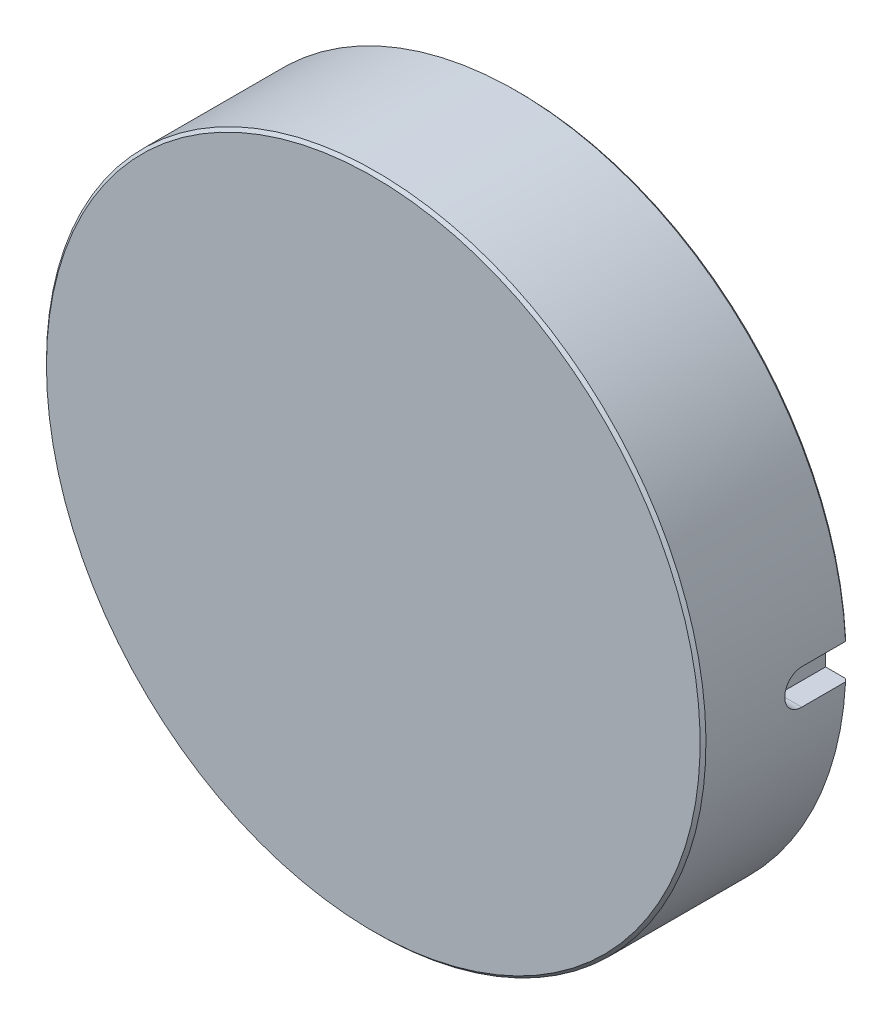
ISO-10303-21;
HEADER;
FILE_DESCRIPTION(('STEP AP214'),'2;1');
FILE_NAME('part.step','',(''),(''),'','','');
FILE_SCHEMA(('AUTOMOTIVE_DESIGN { 1 0 10303 214 1 1 1 1 }'));
ENDSEC;
DATA;
#1=APPLICATION_CONTEXT('core data for automotive mechanical design processes');
#2=APPLICATION_PROTOCOL_DEFINITION('international standard','automotive_design',2000,#1);
#3=PRODUCT_CONTEXT('',#1,'mechanical');
#4=PRODUCT('Part','Part','',(#3));
#5=PRODUCT_RELATED_PRODUCT_CATEGORY('part','',(#4));
#6=PRODUCT_DEFINITION_FORMATION('','',#4);
#7=PRODUCT_DEFINITION_CONTEXT('part definition',#1,'design');
#8=PRODUCT_DEFINITION('design','',#6,#7);
#9=PRODUCT_DEFINITION_SHAPE('','',#8);
#10=(LENGTH_UNIT() NAMED_UNIT(*) SI_UNIT(.MILLI.,.METRE.));
#11=(NAMED_UNIT(*) PLANE_ANGLE_UNIT() SI_UNIT($,.RADIAN.));
#12=(NAMED_UNIT(*) SI_UNIT($,.STERADIAN.) SOLID_ANGLE_UNIT());
#13=UNCERTAINTY_MEASURE_WITH_UNIT(LENGTH_MEASURE(1.E-05),#10,'distance_accuracy_value','');
#14=(GEOMETRIC_REPRESENTATION_CONTEXT(3) GLOBAL_UNCERTAINTY_ASSIGNED_CONTEXT((#13)) GLOBAL_UNIT_ASSIGNED_CONTEXT((#10,
#11,#12)) REPRESENTATION_CONTEXT('',''));
#15=CARTESIAN_POINT('',(0.,0.,0.));
#16=DIRECTION('',(0.,0.,1.));
#17=DIRECTION('',(1.,0.,0.));
#18=AXIS2_PLACEMENT_3D('',#15,#16,#17);
#19=CARTESIAN_POINT('',(43.3012701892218,25.0000000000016,-25.));
#20=DIRECTION('',(0.,0.,-1.));
#21=DIRECTION('',(-1.,0.,0.));
#22=AXIS2_PLACEMENT_3D('',#19,#20,#21);
#23=CYLINDRICAL_SURFACE('',#22,3.4);
#24=CARTESIAN_POINT('',(43.3012701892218,25.0000000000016,-25.));
#25=DIRECTION('',(0.,0.,-1.));
#26=DIRECTION('',(-1.,0.,0.));
#27=AXIS2_PLACEMENT_3D('',#24,#25,#26);
#28=CIRCLE('',#27,3.4);
#29=CARTESIAN_POINT('',(39.9012701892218,25.0000000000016,-25.));
#30=VERTEX_POINT('',#29);
#31=EDGE_CURVE('E838',#30,#30,#28,.T.);
#32=ORIENTED_EDGE('',*,*,#31,.T.);
#33=EDGE_LOOP('',(#32));
#34=FACE_BOUND('',#33,.T.);
#35=CARTESIAN_POINT('',(43.3012701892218,25.0000000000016,-13.));
#36=DIRECTION('',(0.,0.,1.));
#37=DIRECTION('',(1.,0.,0.));
#38=AXIS2_PLACEMENT_3D('',#35,#36,#37);
#39=CIRCLE('',#38,3.4);
#40=CARTESIAN_POINT('',(46.7012701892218,25.0000000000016,-13.));
#41=VERTEX_POINT('',#40);
#42=EDGE_CURVE('E11',#41,#41,#39,.F.);
#43=ORIENTED_EDGE('',*,*,#42,.F.);
#44=EDGE_LOOP('',(#43));
#45=FACE_BOUND('',#44,.T.);
#46=ADVANCED_FACE('F38',(#34,#45),#23,.F.);
#47=CARTESIAN_POINT('',(43.3012701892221,-24.9999999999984,-25.));
#48=DIRECTION('',(0.,0.,-1.));
#49=DIRECTION('',(-1.,0.,0.));
#50=AXIS2_PLACEMENT_3D('',#47,#48,#49);
#51=CYLINDRICAL_SURFACE('',#50,3.4);
#52=CARTESIAN_POINT('',(43.3012701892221,-24.9999999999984,-25.));
#53=DIRECTION('',(0.,0.,-1.));
#54=DIRECTION('',(-1.,0.,0.));
#55=AXIS2_PLACEMENT_3D('',#52,#53,#54);
#56=CIRCLE('',#55,3.4);
#57=CARTESIAN_POINT('',(39.9012701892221,-24.9999999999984,-25.));
#58=VERTEX_POINT('',#57);
#59=EDGE_CURVE('E842',#58,#58,#56,.T.);
#60=ORIENTED_EDGE('',*,*,#59,.T.);
#61=EDGE_LOOP('',(#60));
#62=FACE_BOUND('',#61,.T.);
#63=CARTESIAN_POINT('',(43.3012701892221,-24.9999999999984,-13.));
#64=DIRECTION('',(0.,0.,1.));
#65=DIRECTION('',(1.,0.,0.));
#66=AXIS2_PLACEMENT_3D('',#63,#64,#65);
#67=CIRCLE('',#66,3.4);
#68=CARTESIAN_POINT('',(46.701270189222,-24.9999999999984,-13.));
#69=VERTEX_POINT('',#68);
#70=EDGE_CURVE('E48',#69,#69,#67,.F.);
#71=ORIENTED_EDGE('',*,*,#70,.F.);
#72=EDGE_LOOP('',(#71));
#73=FACE_BOUND('',#72,.T.);
#74=ADVANCED_FACE('F735',(#62,#73),#51,.F.);
#75=CARTESIAN_POINT('',(2.46105559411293E-13,-49.9999999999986,-25.));
#76=DIRECTION('',(0.,0.,-1.));
#77=DIRECTION('',(-1.,0.,0.));
#78=AXIS2_PLACEMENT_3D('',#75,#76,#77);
#79=CYLINDRICAL_SURFACE('',#78,3.4);
#80=CARTESIAN_POINT('',(2.46105559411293E-13,-49.9999999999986,-25.));
#81=DIRECTION('',(0.,0.,-1.));
#82=DIRECTION('',(-1.,0.,0.));
#83=AXIS2_PLACEMENT_3D('',#80,#81,#82);
#84=CIRCLE('',#83,3.4);
#85=CARTESIAN_POINT('',(-3.39999999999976,-49.9999999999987,-25.));
#86=VERTEX_POINT('',#85);
#87=EDGE_CURVE('E845',#86,#86,#84,.T.);
#88=ORIENTED_EDGE('',*,*,#87,.T.);
#89=EDGE_LOOP('',(#88));
#90=FACE_BOUND('',#89,.T.);
#91=CARTESIAN_POINT('',(2.46105559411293E-13,-49.9999999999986,-13.));
#92=DIRECTION('',(0.,0.,1.));
#93=DIRECTION('',(1.,0.,0.));
#94=AXIS2_PLACEMENT_3D('',#91,#92,#93);
#95=CIRCLE('',#94,3.4);
#96=CARTESIAN_POINT('',(3.40000000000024,-49.9999999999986,-13.));
#97=VERTEX_POINT('',#96);
#98=EDGE_CURVE('E920',#97,#97,#95,.F.);
#99=ORIENTED_EDGE('',*,*,#98,.F.);
#100=EDGE_LOOP('',(#99));
#101=FACE_BOUND('',#100,.T.);
#102=ADVANCED_FACE('F741',(#90,#101),#79,.F.);
#103=CARTESIAN_POINT('',(-43.3012701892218,-24.9999999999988,-25.));
#104=DIRECTION('',(0.,0.,-1.));
#105=DIRECTION('',(-1.,0.,0.));
#106=AXIS2_PLACEMENT_3D('',#103,#104,#105);
#107=CYLINDRICAL_SURFACE('',#106,3.4);
#108=CARTESIAN_POINT('',(-43.3012701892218,-24.9999999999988,-25.));
#109=DIRECTION('',(0.,0.,-1.));
#110=DIRECTION('',(-1.,0.,0.));
#111=AXIS2_PLACEMENT_3D('',#108,#109,#110);
#112=CIRCLE('',#111,3.4);
#113=CARTESIAN_POINT('',(-46.7012701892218,-24.9999999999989,-25.));
#114=VERTEX_POINT('',#113);
#115=EDGE_CURVE('E811',#114,#114,#112,.T.);
#116=ORIENTED_EDGE('',*,*,#115,.T.);
#117=EDGE_LOOP('',(#116));
#118=FACE_BOUND('',#117,.T.);
#119=CARTESIAN_POINT('',(-43.3012701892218,-24.9999999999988,-13.));
#120=DIRECTION('',(0.,0.,1.));
#121=DIRECTION('',(1.,0.,0.));
#122=AXIS2_PLACEMENT_3D('',#119,#120,#121);
#123=CIRCLE('',#122,3.4);
#124=CARTESIAN_POINT('',(-39.9012701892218,-24.9999999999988,-13.));
#125=VERTEX_POINT('',#124);
#126=EDGE_CURVE('E917',#125,#125,#123,.F.);
#127=ORIENTED_EDGE('',*,*,#126,.F.);
#128=EDGE_LOOP('',(#127));
#129=FACE_BOUND('',#128,.T.);
#130=ADVANCED_FACE('F911',(#118,#129),#107,.F.);
#131=CARTESIAN_POINT('',(-43.3012701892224,25.0000000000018,-25.));
#132=DIRECTION('',(0.,0.,-1.));
#133=DIRECTION('',(-1.,0.,0.));
#134=AXIS2_PLACEMENT_3D('',#131,#132,#133);
#135=CYLINDRICAL_SURFACE('',#134,3.4);
#136=CARTESIAN_POINT('',(-43.3012701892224,25.0000000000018,-25.));
#137=DIRECTION('',(0.,0.,-1.));
#138=DIRECTION('',(-1.,0.,0.));
#139=AXIS2_PLACEMENT_3D('',#136,#137,#138);
#140=CIRCLE('',#139,3.4);
#141=CARTESIAN_POINT('',(-46.7012701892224,25.0000000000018,-25.));
#142=VERTEX_POINT('',#141);
#143=EDGE_CURVE('E807',#142,#142,#140,.T.);
#144=ORIENTED_EDGE('',*,*,#143,.T.);
#145=EDGE_LOOP('',(#144));
#146=FACE_BOUND('',#145,.T.);
#147=CARTESIAN_POINT('',(-43.3012701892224,25.0000000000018,-13.));
#148=DIRECTION('',(0.,0.,1.));
#149=DIRECTION('',(1.,0.,0.));
#150=AXIS2_PLACEMENT_3D('',#147,#148,#149);
#151=CIRCLE('',#150,3.4);
#152=CARTESIAN_POINT('',(-39.9012701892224,25.0000000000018,-13.));
#153=VERTEX_POINT('',#152);
#154=EDGE_CURVE('E915',#153,#153,#151,.F.);
#155=ORIENTED_EDGE('',*,*,#154,.F.);
#156=EDGE_LOOP('',(#155));
#157=FACE_BOUND('',#156,.T.);
#158=ADVANCED_FACE('F907',(#146,#157),#135,.F.);
#159=CARTESIAN_POINT('',(-2.52228793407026E-13,50.0000000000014,-25.));
#160=DIRECTION('',(0.,0.,-1.));
#161=DIRECTION('',(-1.,0.,0.));
#162=AXIS2_PLACEMENT_3D('',#159,#160,#161);
#163=CYLINDRICAL_SURFACE('',#162,3.4);
#164=CARTESIAN_POINT('',(-2.52228793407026E-13,50.0000000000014,-25.));
#165=DIRECTION('',(0.,0.,-1.));
#166=DIRECTION('',(-1.,0.,0.));
#167=AXIS2_PLACEMENT_3D('',#164,#165,#166);
#168=CIRCLE('',#167,3.4);
#169=CARTESIAN_POINT('',(-3.40000000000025,50.0000000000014,-25.));
#170=VERTEX_POINT('',#169);
#171=EDGE_CURVE('E803',#170,#170,#168,.T.);
#172=ORIENTED_EDGE('',*,*,#171,.T.);
#173=EDGE_LOOP('',(#172));
#174=FACE_BOUND('',#173,.T.);
#175=CARTESIAN_POINT('',(-2.52228793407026E-13,50.0000000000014,-13.));
#176=DIRECTION('',(0.,0.,1.));
#177=DIRECTION('',(1.,0.,0.));
#178=AXIS2_PLACEMENT_3D('',#175,#176,#177);
#179=CIRCLE('',#178,3.4);
#180=CARTESIAN_POINT('',(3.39999999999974,50.0000000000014,-13.));
#181=VERTEX_POINT('',#180);
#182=EDGE_CURVE('E42',#181,#181,#179,.F.);
#183=ORIENTED_EDGE('',*,*,#182,.F.);
#184=EDGE_LOOP('',(#183));
#185=FACE_BOUND('',#184,.T.);
#186=ADVANCED_FACE('F910',(#174,#185),#163,.F.);
#187=CARTESIAN_POINT('',(0.,1.37712295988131E-12,-20.01));
#188=DIRECTION('',(0.,0.,-1.));
#189=DIRECTION('',(-1.,0.,0.));
#190=AXIS2_PLACEMENT_3D('',#187,#188,#189);
#191=PLANE('',#190);
#192=CARTESIAN_POINT('',(32.2219579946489,-4.24210124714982,-20.01));
#193=DIRECTION('',(0.,0.,-1.));
#194=DIRECTION('',(-1.,0.,0.));
#195=AXIS2_PLACEMENT_3D('',#192,#193,#194);
#196=CIRCLE('',#195,9.);
#197=CARTESIAN_POINT('',(23.2219579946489,-4.24210124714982,-20.01));
#198=VERTEX_POINT('',#197);
#199=EDGE_CURVE('E663',#198,#198,#196,.F.);
#200=ORIENTED_EDGE('',*,*,#199,.F.);
#201=EDGE_LOOP('',(#200));
#202=FACE_BOUND('',#201,.T.);
#203=CARTESIAN_POINT('',(32.2219579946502,-4.24210124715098,-20.01));
#204=DIRECTION('',(0.,0.,-1.));
#205=DIRECTION('',(-1.,0.,0.));
#206=AXIS2_PLACEMENT_3D('',#203,#204,#205);
#207=CIRCLE('',#206,8.);
#208=CARTESIAN_POINT('',(24.2219579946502,-4.24210124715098,-20.01));
#209=VERTEX_POINT('',#208);
#210=EDGE_CURVE('E387',#209,#209,#207,.F.);
#211=ORIENTED_EDGE('',*,*,#210,.T.);
#212=EDGE_LOOP('',(#211));
#213=FACE_BOUND('',#212,.T.);
#214=ADVANCED_FACE('F1237',(#202,#213),#191,.T.);
#215=CARTESIAN_POINT('',(-19.7847464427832,-25.783983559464,-20.01));
#216=DIRECTION('',(0.,0.,-1.));
#217=DIRECTION('',(-1.,0.,0.));
#218=AXIS2_PLACEMENT_3D('',#215,#216,#217);
#219=CIRCLE('',#218,9.);
#220=CARTESIAN_POINT('',(-28.7847464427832,-25.783983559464,-20.01));
#221=VERTEX_POINT('',#220);
#222=EDGE_CURVE('E657',#221,#221,#219,.F.);
#223=ORIENTED_EDGE('',*,*,#222,.F.);
#224=EDGE_LOOP('',(#223));
#225=FACE_BOUND('',#224,.T.);
#226=CARTESIAN_POINT('',(-19.7847464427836,-25.7839835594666,-20.01));
#227=DIRECTION('',(0.,0.,-1.));
#228=DIRECTION('',(-1.,0.,0.));
#229=AXIS2_PLACEMENT_3D('',#226,#227,#228);
#230=CIRCLE('',#229,8.);
#231=CARTESIAN_POINT('',(-27.7847464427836,-25.7839835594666,-20.01));
#232=VERTEX_POINT('',#231);
#233=EDGE_CURVE('E424',#232,#232,#230,.F.);
#234=ORIENTED_EDGE('',*,*,#233,.T.);
#235=EDGE_LOOP('',(#234));
#236=FACE_BOUND('',#235,.T.);
#237=ADVANCED_FACE('F1242',(#225,#236),#191,.T.);
#238=CARTESIAN_POINT('',(19.7847464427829,-25.7839835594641,-20.01));
#239=DIRECTION('',(0.,0.,-1.));
#240=DIRECTION('',(-1.,0.,0.));
#241=AXIS2_PLACEMENT_3D('',#238,#239,#240);
#242=CIRCLE('',#241,9.);
#243=CARTESIAN_POINT('',(10.7847464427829,-25.7839835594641,-20.01));
#244=VERTEX_POINT('',#243);
#245=EDGE_CURVE('E660',#244,#244,#242,.F.);
#246=ORIENTED_EDGE('',*,*,#245,.F.);
#247=EDGE_LOOP('',(#246));
#248=FACE_BOUND('',#247,.T.);
#249=CARTESIAN_POINT('',(19.7847464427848,-25.7839835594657,-20.01));
#250=DIRECTION('',(0.,0.,-1.));
#251=DIRECTION('',(-1.,0.,0.));
#252=AXIS2_PLACEMENT_3D('',#249,#250,#251);
#253=CIRCLE('',#252,8.);
#254=CARTESIAN_POINT('',(11.7847464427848,-25.7839835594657,-20.01));
#255=VERTEX_POINT('',#254);
#256=EDGE_CURVE('E461',#255,#255,#253,.F.);
#257=ORIENTED_EDGE('',*,*,#256,.T.);
#258=EDGE_LOOP('',(#257));
#259=FACE_BOUND('',#258,.T.);
#260=ADVANCED_FACE('F1435',(#248,#259),#191,.T.);
#261=CARTESIAN_POINT('',(-32.2219579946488,-4.2421012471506,-20.01));
#262=DIRECTION('',(0.,0.,-1.));
#263=DIRECTION('',(-1.,0.,0.));
#264=AXIS2_PLACEMENT_3D('',#261,#262,#263);
#265=CIRCLE('',#264,9.);
#266=CARTESIAN_POINT('',(-41.2219579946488,-4.2421012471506,-20.01));
#267=VERTEX_POINT('',#266);
#268=EDGE_CURVE('E654',#267,#267,#265,.F.);
#269=ORIENTED_EDGE('',*,*,#268,.F.);
#270=EDGE_LOOP('',(#269));
#271=FACE_BOUND('',#270,.T.);
#272=CARTESIAN_POINT('',(-32.22195799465,-4.2421012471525,-20.01));
#273=DIRECTION('',(0.,0.,-1.));
#274=DIRECTION('',(-1.,0.,0.));
#275=AXIS2_PLACEMENT_3D('',#272,#273,#274);
#276=CIRCLE('',#275,8.);
#277=CARTESIAN_POINT('',(-40.22195799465,-4.2421012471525,-20.01));
#278=VERTEX_POINT('',#277);
#279=EDGE_CURVE('E498',#278,#278,#276,.F.);
#280=ORIENTED_EDGE('',*,*,#279,.T.);
#281=EDGE_LOOP('',(#280));
#282=FACE_BOUND('',#281,.T.);
#283=ADVANCED_FACE('F1423',(#271,#282),#191,.T.);
#284=CARTESIAN_POINT('',(-12.4372115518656,30.0260848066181,-20.01));
#285=DIRECTION('',(0.,0.,-1.));
#286=DIRECTION('',(-1.,0.,0.));
#287=AXIS2_PLACEMENT_3D('',#284,#285,#286);
#288=CIRCLE('',#287,9.);
#289=CARTESIAN_POINT('',(-21.4372115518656,30.0260848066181,-20.01));
#290=VERTEX_POINT('',#289);
#291=EDGE_CURVE('E650',#290,#290,#288,.F.);
#292=ORIENTED_EDGE('',*,*,#291,.F.);
#293=EDGE_LOOP('',(#292));
#294=FACE_BOUND('',#293,.T.);
#295=CARTESIAN_POINT('',(-12.4372115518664,30.0260848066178,-20.01));
#296=DIRECTION('',(0.,0.,-1.));
#297=DIRECTION('',(-1.,0.,0.));
#298=AXIS2_PLACEMENT_3D('',#295,#296,#297);
#299=CIRCLE('',#298,8.);
#300=CARTESIAN_POINT('',(-20.4372115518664,30.0260848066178,-20.01));
#301=VERTEX_POINT('',#300);
#302=EDGE_CURVE('E535',#301,#301,#299,.F.);
#303=ORIENTED_EDGE('',*,*,#302,.T.);
#304=EDGE_LOOP('',(#303));
#305=FACE_BOUND('',#304,.T.);
#306=ADVANCED_FACE('F1418',(#294,#305),#191,.T.);
#307=CARTESIAN_POINT('',(12.4372115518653,30.0260848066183,-20.01));
#308=DIRECTION('',(0.,0.,-1.));
#309=DIRECTION('',(-1.,0.,0.));
#310=AXIS2_PLACEMENT_3D('',#307,#308,#309);
#311=CIRCLE('',#310,9.);
#312=CARTESIAN_POINT('',(3.43721155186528,30.0260848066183,-20.01));
#313=VERTEX_POINT('',#312);
#314=EDGE_CURVE('E647',#313,#313,#311,.F.);
#315=ORIENTED_EDGE('',*,*,#314,.F.);
#316=EDGE_LOOP('',(#315));
#317=FACE_BOUND('',#316,.T.);
#318=CARTESIAN_POINT('',(12.4372115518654,30.0260848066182,-20.01));
#319=DIRECTION('',(0.,0.,-1.));
#320=DIRECTION('',(-1.,0.,0.));
#321=AXIS2_PLACEMENT_3D('',#318,#319,#320);
#322=CIRCLE('',#321,8.);
#323=CARTESIAN_POINT('',(4.43721155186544,30.0260848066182,-20.01));
#324=VERTEX_POINT('',#323);
#325=EDGE_CURVE('E572',#324,#324,#322,.F.);
#326=ORIENTED_EDGE('',*,*,#325,.T.);
#327=EDGE_LOOP('',(#326));
#328=FACE_BOUND('',#327,.T.);
#329=ADVANCED_FACE('F1220',(#317,#328),#191,.T.);
#330=CARTESIAN_POINT('',(-6.1,-32.4999999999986,-21.5));
#331=DIRECTION('',(0.,0.,1.));
#332=DIRECTION('',(0.,-1.,0.));
#333=AXIS2_PLACEMENT_3D('',#330,#331,#332);
#334=PLANE('',#333);
#335=CARTESIAN_POINT('',(0.,-32.4999999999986,-21.5));
#336=DIRECTION('',(0.,0.,1.));
#337=DIRECTION('',(0.,-1.,0.));
#338=AXIS2_PLACEMENT_3D('',#335,#336,#337);
#339=CIRCLE('',#338,8.);
#340=CARTESIAN_POINT('',(0.,-40.4999999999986,-21.5));
#341=VERTEX_POINT('',#340);
#342=EDGE_CURVE('E634',#341,#341,#339,.T.);
#343=ORIENTED_EDGE('',*,*,#342,.F.);
#344=EDGE_LOOP('',(#343));
#345=FACE_BOUND('',#344,.T.);
#346=CARTESIAN_POINT('',(0.,-32.4999999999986,-21.5));
#347=DIRECTION('',(0.,0.,1.));
#348=DIRECTION('',(1.,0.,0.));
#349=AXIS2_PLACEMENT_3D('',#346,#347,#348);
#350=CIRCLE('',#349,7.);
#351=CARTESIAN_POINT('',(7.,-32.4999999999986,-21.5));
#352=VERTEX_POINT('',#351);
#353=EDGE_CURVE('E712',#352,#352,#350,.F.);
#354=ORIENTED_EDGE('',*,*,#353,.F.);
#355=EDGE_LOOP('',(#354));
#356=FACE_BOUND('',#355,.T.);
#357=ADVANCED_FACE('F783',(#345,#356),#334,.F.);
#358=CARTESIAN_POINT('',(1.6394871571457E-13,-32.4999999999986,-20.01));
#359=DIRECTION('',(0.,0.,-1.));
#360=DIRECTION('',(-1.,0.,0.));
#361=AXIS2_PLACEMENT_3D('',#358,#359,#360);
#362=CIRCLE('',#361,9.);
#363=CARTESIAN_POINT('',(-8.99999999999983,-32.4999999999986,-20.01));
#364=VERTEX_POINT('',#363);
#365=EDGE_CURVE('E651',#364,#364,#362,.F.);
#366=ORIENTED_EDGE('',*,*,#365,.F.);
#367=EDGE_LOOP('',(#366));
#368=FACE_BOUND('',#367,.T.);
#369=CARTESIAN_POINT('',(0.,-32.4999999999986,-20.01));
#370=DIRECTION('',(0.,0.,-1.));
#371=DIRECTION('',(-1.,0.,0.));
#372=AXIS2_PLACEMENT_3D('',#369,#370,#371);
#373=CIRCLE('',#372,8.);
#374=CARTESIAN_POINT('',(-8.,-32.4999999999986,-20.01));
#375=VERTEX_POINT('',#374);
#376=EDGE_CURVE('E1401',#375,#375,#373,.F.);
#377=ORIENTED_EDGE('',*,*,#376,.T.);
#378=EDGE_LOOP('',(#377));
#379=FACE_BOUND('',#378,.T.);
#380=ADVANCED_FACE('F776',(#368,#379),#191,.T.);
#381=CARTESIAN_POINT('',(-2.57426209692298E-13,51.030297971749,-25.));
#382=DIRECTION('',(0.,0.,1.));
#383=DIRECTION('',(1.,0.,0.));
#384=AXIS2_PLACEMENT_3D('',#381,#382,#383);
#385=PLANE('',#384);
#386=CARTESIAN_POINT('',(1.6394871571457E-13,-32.4999999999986,-25.));
#387=DIRECTION('',(0.,0.,-1.));
#388=DIRECTION('',(-1.,0.,0.));
#389=AXIS2_PLACEMENT_3D('',#386,#387,#388);
#390=CIRCLE('',#389,9.);
#391=CARTESIAN_POINT('',(-8.99999999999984,-32.4999999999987,-25.));
#392=VERTEX_POINT('',#391);
#393=EDGE_CURVE('E790',#392,#392,#390,.T.);
#394=ORIENTED_EDGE('',*,*,#393,.F.);
#395=EDGE_LOOP('',(#394));
#396=FACE_BOUND('',#395,.T.);
#397=DIRECTION('',(0.,1.,0.));
#398=VECTOR('',#397,1.);
#399=CARTESIAN_POINT('',(52.5,3.00000000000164,-25.));
#400=LINE('',#399,#398);
#401=CARTESIAN_POINT('',(52.5,-2.99999999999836,-25.));
#402=VERTEX_POINT('',#401);
#403=CARTESIAN_POINT('',(52.5,3.00000000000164,-25.));
#404=VERTEX_POINT('',#403);
#405=EDGE_CURVE('E679',#402,#404,#400,.T.);
#406=ORIENTED_EDGE('',*,*,#405,.F.);
#407=DIRECTION('',(-1.,0.,0.));
#408=VECTOR('',#407,1.);
#409=CARTESIAN_POINT('',(52.5,-2.99999999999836,-25.));
#410=LINE('',#409,#408);
#411=CARTESIAN_POINT('',(55.9195851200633,-2.99999999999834,-25.));
#412=VERTEX_POINT('',#411);
#413=EDGE_CURVE('E893',#412,#402,#410,.T.);
#414=ORIENTED_EDGE('',*,*,#413,.F.);
#415=CARTESIAN_POINT('',(0.,1.37712295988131E-12,-25.));
#416=DIRECTION('',(0.,0.,1.));
#417=DIRECTION('',(1.,0.,0.));
#418=AXIS2_PLACEMENT_3D('',#415,#416,#417);
#419=CIRCLE('',#418,56.);
#420=CARTESIAN_POINT('',(55.9195851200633,3.00000000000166,-25.));
#421=VERTEX_POINT('',#420);
#422=EDGE_CURVE('E866',#412,#421,#419,.F.);
#423=ORIENTED_EDGE('',*,*,#422,.T.);
#424=DIRECTION('',(1.,0.,0.));
#425=VECTOR('',#424,1.);
#426=CARTESIAN_POINT('',(52.5,3.00000000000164,-25.));
#427=LINE('',#426,#425);
#428=EDGE_CURVE('E881',#404,#421,#427,.T.);
#429=ORIENTED_EDGE('',*,*,#428,.F.);
#430=EDGE_LOOP('',(#406,#414,#423,#429));
#431=FACE_BOUND('',#430,.T.);
#432=CARTESIAN_POINT('',(0.,1.37712295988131E-12,-25.));
#433=DIRECTION('',(0.,0.,1.));
#434=DIRECTION('',(1.,0.,0.));
#435=AXIS2_PLACEMENT_3D('',#432,#433,#434);
#436=CIRCLE('',#435,20.5);
#437=CARTESIAN_POINT('',(20.5,1.48053676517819E-12,-25.));
#438=VERTEX_POINT('',#437);
#439=EDGE_CURVE('E799',#438,#438,#436,.T.);
#440=ORIENTED_EDGE('',*,*,#439,.T.);
#441=EDGE_LOOP('',(#440));
#442=FACE_BOUND('',#441,.T.);
#443=ORIENTED_EDGE('',*,*,#171,.F.);
#444=EDGE_LOOP('',(#443));
#445=FACE_BOUND('',#444,.T.);
#446=ORIENTED_EDGE('',*,*,#143,.F.);
#447=EDGE_LOOP('',(#446));
#448=FACE_BOUND('',#447,.T.);
#449=ORIENTED_EDGE('',*,*,#115,.F.);
#450=EDGE_LOOP('',(#449));
#451=FACE_BOUND('',#450,.T.);
#452=CARTESIAN_POINT('',(32.2219579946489,-4.24210124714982,-25.));
#453=DIRECTION('',(0.,0.,-1.));
#454=DIRECTION('',(-1.,0.,0.));
#455=AXIS2_PLACEMENT_3D('',#452,#453,#454);
#456=CIRCLE('',#455,9.);
#457=CARTESIAN_POINT('',(23.2219579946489,-4.24210124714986,-25.));
#458=VERTEX_POINT('',#457);
#459=EDGE_CURVE('E815',#458,#458,#456,.T.);
#460=ORIENTED_EDGE('',*,*,#459,.F.);
#461=EDGE_LOOP('',(#460));
#462=FACE_BOUND('',#461,.T.);
#463=CARTESIAN_POINT('',(19.7847464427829,-25.7839835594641,-25.));
#464=DIRECTION('',(0.,0.,-1.));
#465=DIRECTION('',(-1.,0.,0.));
#466=AXIS2_PLACEMENT_3D('',#463,#464,#465);
#467=CIRCLE('',#466,9.);
#468=CARTESIAN_POINT('',(10.7847464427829,-25.7839835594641,-25.));
#469=VERTEX_POINT('',#468);
#470=EDGE_CURVE('E819',#469,#469,#467,.T.);
#471=ORIENTED_EDGE('',*,*,#470,.F.);
#472=EDGE_LOOP('',(#471));
#473=FACE_BOUND('',#472,.T.);
#474=CARTESIAN_POINT('',(-19.7847464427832,-25.783983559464,-25.));
#475=DIRECTION('',(0.,0.,-1.));
#476=DIRECTION('',(-1.,0.,0.));
#477=AXIS2_PLACEMENT_3D('',#474,#475,#476);
#478=CIRCLE('',#477,9.);
#479=CARTESIAN_POINT('',(-28.7847464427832,-25.783983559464,-25.));
#480=VERTEX_POINT('',#479);
#481=EDGE_CURVE('E823',#480,#480,#478,.T.);
#482=ORIENTED_EDGE('',*,*,#481,.F.);
#483=EDGE_LOOP('',(#482));
#484=FACE_BOUND('',#483,.T.);
#485=CARTESIAN_POINT('',(-32.2219579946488,-4.2421012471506,-25.));
#486=DIRECTION('',(0.,0.,-1.));
#487=DIRECTION('',(-1.,0.,0.));
#488=AXIS2_PLACEMENT_3D('',#485,#486,#487);
#489=CIRCLE('',#488,9.);
#490=CARTESIAN_POINT('',(-41.2219579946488,-4.24210124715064,-25.));
#491=VERTEX_POINT('',#490);
#492=EDGE_CURVE('E827',#491,#491,#489,.T.);
#493=ORIENTED_EDGE('',*,*,#492,.F.);
#494=EDGE_LOOP('',(#493));
#495=FACE_BOUND('',#494,.T.);
#496=CARTESIAN_POINT('',(-12.4372115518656,30.0260848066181,-25.));
#497=DIRECTION('',(0.,0.,-1.));
#498=DIRECTION('',(-1.,0.,0.));
#499=AXIS2_PLACEMENT_3D('',#496,#497,#498);
#500=CIRCLE('',#499,9.00000000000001);
#501=CARTESIAN_POINT('',(-21.4372115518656,30.0260848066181,-25.));
#502=VERTEX_POINT('',#501);
#503=EDGE_CURVE('E831',#502,#502,#500,.T.);
#504=ORIENTED_EDGE('',*,*,#503,.F.);
#505=EDGE_LOOP('',(#504));
#506=FACE_BOUND('',#505,.T.);
#507=CARTESIAN_POINT('',(12.4372115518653,30.0260848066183,-25.));
#508=DIRECTION('',(0.,0.,-1.));
#509=DIRECTION('',(-1.,0.,0.));
#510=AXIS2_PLACEMENT_3D('',#507,#508,#509);
#511=CIRCLE('',#510,9.00000000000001);
#512=CARTESIAN_POINT('',(3.43721155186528,30.0260848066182,-25.));
#513=VERTEX_POINT('',#512);
#514=EDGE_CURVE('E835',#513,#513,#511,.T.);
#515=ORIENTED_EDGE('',*,*,#514,.F.);
#516=EDGE_LOOP('',(#515));
#517=FACE_BOUND('',#516,.T.);
#518=ORIENTED_EDGE('',*,*,#31,.F.);
#519=EDGE_LOOP('',(#518));
#520=FACE_BOUND('',#519,.T.);
#521=ORIENTED_EDGE('',*,*,#59,.F.);
#522=EDGE_LOOP('',(#521));
#523=FACE_BOUND('',#522,.T.);
#524=ORIENTED_EDGE('',*,*,#87,.F.);
#525=EDGE_LOOP('',(#524));
#526=FACE_BOUND('',#525,.T.);
#527=ADVANCED_FACE('F774',(#396,#431,#442,#445,#448,#451,#462,#473,#484,#495,#506,#517,#520,
#523,#526),#385,.F.);
#528=CARTESIAN_POINT('',(-2.37095065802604E-13,47.0000000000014,0.));
#529=DIRECTION('',(0.,0.,-1.));
#530=DIRECTION('',(-1.,0.,0.));
#531=AXIS2_PLACEMENT_3D('',#528,#529,#530);
#532=PLANE('',#531);
#533=CARTESIAN_POINT('',(0.,1.37712295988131E-12,0.));
#534=DIRECTION('',(0.,0.,-1.));
#535=DIRECTION('',(-1.,0.,0.));
#536=AXIS2_PLACEMENT_3D('',#533,#534,#535);
#537=CIRCLE('',#536,56.);
#538=CARTESIAN_POINT('',(-56.,1.09462671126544E-12,0.));
#539=VERTEX_POINT('',#538);
#540=EDGE_CURVE('E869',#539,#539,#537,.F.);
#541=ORIENTED_EDGE('',*,*,#540,.T.);
#542=EDGE_LOOP('',(#541));
#543=FACE_BOUND('',#542,.T.);
#544=ADVANCED_FACE('F694',(#543),#532,.F.);
#545=CARTESIAN_POINT('',(0.,1.37712295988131E-12,30.5919468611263));
#546=DIRECTION('',(0.,0.,1.));
#547=DIRECTION('',(1.,0.,0.));
#548=AXIS2_PLACEMENT_3D('',#545,#546,#547);
#549=CYLINDRICAL_SURFACE('',#548,56.5);
#550=DIRECTION('',(0.,0.,1.));
#551=VECTOR('',#550,1.);
#552=CARTESIAN_POINT('',(56.4202977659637,-2.99999999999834,30.5919468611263));
#553=LINE('',#552,#551);
#554=CARTESIAN_POINT('',(56.4202977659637,-2.99999999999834,-24.5));
#555=VERTEX_POINT('',#554);
#556=CARTESIAN_POINT('',(56.4202977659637,-2.99999999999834,-17.));
#557=VERTEX_POINT('',#556);
#558=EDGE_CURVE('E888',#555,#557,#553,.T.);
#559=ORIENTED_EDGE('',*,*,#558,.T.);
#560=CARTESIAN_POINT('',(56.4202977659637,-2.99999999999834,-17.));
#561=CARTESIAN_POINT('',(56.4202959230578,-3.00000815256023,-16.9156855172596));
#562=CARTESIAN_POINT('',(56.4204867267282,-2.99644556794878,-16.8313749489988));
#563=CARTESIAN_POINT('',(56.4212400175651,-2.98224202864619,-16.6633581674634));
#564=CARTESIAN_POINT('',(56.4218024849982,-2.97160144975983,-16.5796519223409));
#565=CARTESIAN_POINT('',(56.4232849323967,-2.94331577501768,-16.4134944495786));
#566=CARTESIAN_POINT('',(56.4242046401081,-2.92567601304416,-16.331042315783));
#567=CARTESIAN_POINT('',(56.4263738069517,-2.88353599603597,-16.1679394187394));
#568=CARTESIAN_POINT('',(56.4276232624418,-2.8590358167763,-16.0872886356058));
#569=CARTESIAN_POINT('',(56.431817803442,-2.77544654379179,-15.8488224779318));
#570=CARTESIAN_POINT('',(56.435209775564,-2.70625594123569,-15.6944186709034));
#571=CARTESIAN_POINT('',(56.4428001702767,-2.54301740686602,-15.3995308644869));
#572=CARTESIAN_POINT('',(56.4469984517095,-2.44897382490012,-15.2590444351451));
#573=CARTESIAN_POINT('',(56.4557339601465,-2.23856432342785,-14.9956937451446));
#574=CARTESIAN_POINT('',(56.4602714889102,-2.12217838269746,-14.8728454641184));
#575=CARTESIAN_POINT('',(56.4691717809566,-1.87042011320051,-14.6484094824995));
#576=CARTESIAN_POINT('',(56.4735345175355,-1.73504489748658,-14.5468250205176));
#577=CARTESIAN_POINT('',(56.4815955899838,-1.44906916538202,-14.3677627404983));
#578=CARTESIAN_POINT('',(56.4852935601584,-1.2984603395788,-14.2902981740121));
#579=CARTESIAN_POINT('',(56.4916049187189,-0.986361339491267,-14.1617661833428));
#580=CARTESIAN_POINT('',(56.4942183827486,-0.824871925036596,-14.1106969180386));
#581=CARTESIAN_POINT('',(56.4980643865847,-0.495747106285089,-14.0364434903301));
#582=CARTESIAN_POINT('',(56.4992982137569,-0.328117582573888,-14.013233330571));
#583=CARTESIAN_POINT('',(56.5002502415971,0.00866666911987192,-13.9952767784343));
#584=CARTESIAN_POINT('',(56.4999684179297,0.177821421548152,-14.0005308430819));
#585=CARTESIAN_POINT('',(56.4979219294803,0.512669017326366,-14.039333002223));
#586=CARTESIAN_POINT('',(56.4961587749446,0.678365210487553,-14.0728522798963));
#587=CARTESIAN_POINT('',(56.491349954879,1.00177497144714,-14.1671886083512));
#588=CARTESIAN_POINT('',(56.4883042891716,1.15948853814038,-14.2280056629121));
#589=CARTESIAN_POINT('',(56.4812708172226,1.4625527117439,-14.3752453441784));
#590=CARTESIAN_POINT('',(56.4772825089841,1.6078966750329,-14.4616816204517));
#591=CARTESIAN_POINT('',(56.4688130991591,1.88201548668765,-14.6576920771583));
#592=CARTESIAN_POINT('',(56.4643320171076,2.01079099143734,-14.7672653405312));
#593=CARTESIAN_POINT('',(56.4553755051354,2.24827618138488,-15.0065843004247));
#594=CARTESIAN_POINT('',(56.4509000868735,2.35696361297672,-15.1363520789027));
#595=CARTESIAN_POINT('',(56.4424629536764,2.55104834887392,-15.4123556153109));
#596=CARTESIAN_POINT('',(56.4385014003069,2.63643833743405,-15.5585965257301));
#597=CARTESIAN_POINT('',(56.4315387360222,2.78149850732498,-15.8634274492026));
#598=CARTESIAN_POINT('',(56.4285382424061,2.84115216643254,-16.0220253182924));
#599=CARTESIAN_POINT('',(56.4238452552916,2.93288793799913,-16.3468826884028));
#600=CARTESIAN_POINT('',(56.4221507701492,2.9650120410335,-16.5131301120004));
#601=CARTESIAN_POINT('',(56.4209006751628,2.98864131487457,-16.7337490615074));
#602=CARTESIAN_POINT('',(56.4206747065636,2.99290303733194,-16.7869567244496));
#603=CARTESIAN_POINT('',(56.4203734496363,2.99857850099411,-16.8934356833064));
#604=CARTESIAN_POINT('',(56.4202979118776,2.99999695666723,-16.9467067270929));
#605=CARTESIAN_POINT('',(56.4202977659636,3.00000000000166,-17.));
#606=B_SPLINE_CURVE_WITH_KNOTS('',3,(#560,#561,#562,#563,#564,#565,#566,#567,#568,#569,#570,
#571,#572,#573,#574,#575,#576,#577,#578,#579,#580,#581,#582,#583,#584,#585,#586,#587,#588,#589,
#590,#591,#592,#593,#594,#595,#596,#597,#598,#599,#600,#601,#602,#603,#604,#605),.UNSPECIFIED.,
.F.,.F.,(4,2,2,2,2,2,2,2,2,2,2,2,2,2,2,2,2,2,2,2,2,2,4),(0.,0.252860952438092,0.505708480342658,
0.758363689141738,1.01101610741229,1.51609666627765,2.021088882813,2.52653575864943,
3.03205956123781,3.53786061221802,4.04362637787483,4.54891980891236,5.05422135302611,
5.55900835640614,6.06379542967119,6.5688519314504,7.07388841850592,7.57948107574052,
8.08523231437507,8.59130775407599,9.09660990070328,9.25669200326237,9.41650845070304),.UNSPECIFIED.);
#607=CARTESIAN_POINT('',(56.4202977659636,3.00000000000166,-17.));
#608=VERTEX_POINT('',#607);
#609=EDGE_CURVE('E672',#557,#608,#606,.T.);
#610=ORIENTED_EDGE('',*,*,#609,.T.);
#611=DIRECTION('',(0.,0.,1.));
#612=VECTOR('',#611,1.);
#613=CARTESIAN_POINT('',(56.4202977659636,3.00000000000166,30.5919468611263));
#614=LINE('',#613,#612);
#615=CARTESIAN_POINT('',(56.4202977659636,3.00000000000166,-24.5));
#616=VERTEX_POINT('',#615);
#617=EDGE_CURVE('E880',#608,#616,#614,.F.);
#618=ORIENTED_EDGE('',*,*,#617,.T.);
#619=CARTESIAN_POINT('',(0.,1.37712295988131E-12,-24.5));
#620=DIRECTION('',(0.,0.,1.));
#621=DIRECTION('',(1.,0.,0.));
#622=AXIS2_PLACEMENT_3D('',#619,#620,#621);
#623=CIRCLE('',#622,56.5);
#624=EDGE_CURVE('E862',#616,#555,#623,.T.);
#625=ORIENTED_EDGE('',*,*,#624,.T.);
#626=EDGE_LOOP('',(#559,#610,#618,#625));
#627=FACE_BOUND('',#626,.T.);
#628=CARTESIAN_POINT('',(0.,1.37712295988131E-12,-0.499999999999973));
#629=DIRECTION('',(0.,0.,-1.));
#630=DIRECTION('',(-1.,0.,0.));
#631=AXIS2_PLACEMENT_3D('',#628,#629,#630);
#632=CIRCLE('',#631,56.5);
#633=CARTESIAN_POINT('',(-56.5,1.09210442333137E-12,-0.499999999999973));
#634=VERTEX_POINT('',#633);
#635=EDGE_CURVE('E859',#634,#634,#632,.T.);
#636=ORIENTED_EDGE('',*,*,#635,.T.);
#637=EDGE_LOOP('',(#636));
#638=FACE_BOUND('',#637,.T.);
#639=ADVANCED_FACE('F682',(#627,#638),#549,.T.);
#640=CARTESIAN_POINT('',(0.,1.37712295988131E-12,30.5919468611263));
#641=DIRECTION('',(0.,0.,1.));
#642=DIRECTION('',(1.,0.,0.));
#643=AXIS2_PLACEMENT_3D('',#640,#641,#642);
#644=CYLINDRICAL_SURFACE('',#643,20.);
#645=CARTESIAN_POINT('',(0.,1.37712295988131E-12,-20.01));
#646=DIRECTION('',(0.,0.,-1.));
#647=DIRECTION('',(-1.,0.,0.));
#648=AXIS2_PLACEMENT_3D('',#645,#646,#647);
#649=CIRCLE('',#648,20.);
#650=CARTESIAN_POINT('',(-20.,1.37712295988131E-12,-20.01));
#651=VERTEX_POINT('',#650);
#652=EDGE_CURVE('E666',#651,#651,#649,.F.);
#653=ORIENTED_EDGE('',*,*,#652,.T.);
#654=EDGE_LOOP('',(#653));
#655=FACE_BOUND('',#654,.T.);
#656=CARTESIAN_POINT('',(0.,1.37712295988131E-12,-24.5));
#657=DIRECTION('',(0.,0.,1.));
#658=DIRECTION('',(1.,0.,0.));
#659=AXIS2_PLACEMENT_3D('',#656,#657,#658);
#660=CIRCLE('',#659,20.);
#661=CARTESIAN_POINT('',(20.,1.47801447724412E-12,-24.5));
#662=VERTEX_POINT('',#661);
#663=EDGE_CURVE('E871',#662,#662,#660,.F.);
#664=ORIENTED_EDGE('',*,*,#663,.T.);
#665=EDGE_LOOP('',(#664));
#666=FACE_BOUND('',#665,.T.);
#667=ADVANCED_FACE('F770',(#655,#666),#644,.F.);
#668=CARTESIAN_POINT('',(32.2219579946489,-4.24210124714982,-25.));
#669=DIRECTION('',(0.,0.,-1.));
#670=DIRECTION('',(-1.,0.,0.));
#671=AXIS2_PLACEMENT_3D('',#668,#669,#670);
#672=CYLINDRICAL_SURFACE('',#671,9.);
#673=ORIENTED_EDGE('',*,*,#199,.T.);
#674=EDGE_LOOP('',(#673));
#675=FACE_BOUND('',#674,.T.);
#676=ORIENTED_EDGE('',*,*,#459,.T.);
#677=EDGE_LOOP('',(#676));
#678=FACE_BOUND('',#677,.T.);
#679=ADVANCED_FACE('F766',(#675,#678),#672,.F.);
#680=CARTESIAN_POINT('',(19.7847464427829,-25.7839835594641,-25.));
#681=DIRECTION('',(0.,0.,-1.));
#682=DIRECTION('',(-1.,0.,0.));
#683=AXIS2_PLACEMENT_3D('',#680,#681,#682);
#684=CYLINDRICAL_SURFACE('',#683,9.);
#685=ORIENTED_EDGE('',*,*,#245,.T.);
#686=EDGE_LOOP('',(#685));
#687=FACE_BOUND('',#686,.T.);
#688=ORIENTED_EDGE('',*,*,#470,.T.);
#689=EDGE_LOOP('',(#688));
#690=FACE_BOUND('',#689,.T.);
#691=ADVANCED_FACE('F762',(#687,#690),#684,.F.);
#692=CARTESIAN_POINT('',(-19.7847464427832,-25.783983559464,-25.));
#693=DIRECTION('',(0.,0.,-1.));
#694=DIRECTION('',(-1.,0.,0.));
#695=AXIS2_PLACEMENT_3D('',#692,#693,#694);
#696=CYLINDRICAL_SURFACE('',#695,9.);
#697=ORIENTED_EDGE('',*,*,#222,.T.);
#698=EDGE_LOOP('',(#697));
#699=FACE_BOUND('',#698,.T.);
#700=ORIENTED_EDGE('',*,*,#481,.T.);
#701=EDGE_LOOP('',(#700));
#702=FACE_BOUND('',#701,.T.);
#703=ADVANCED_FACE('F758',(#699,#702),#696,.F.);
#704=CARTESIAN_POINT('',(-32.2219579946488,-4.2421012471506,-25.));
#705=DIRECTION('',(0.,0.,-1.));
#706=DIRECTION('',(-1.,0.,0.));
#707=AXIS2_PLACEMENT_3D('',#704,#705,#706);
#708=CYLINDRICAL_SURFACE('',#707,9.);
#709=ORIENTED_EDGE('',*,*,#268,.T.);
#710=EDGE_LOOP('',(#709));
#711=FACE_BOUND('',#710,.T.);
#712=ORIENTED_EDGE('',*,*,#492,.T.);
#713=EDGE_LOOP('',(#712));
#714=FACE_BOUND('',#713,.T.);
#715=ADVANCED_FACE('F754',(#711,#714),#708,.F.);
#716=CARTESIAN_POINT('',(-12.4372115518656,30.0260848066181,-25.));
#717=DIRECTION('',(0.,0.,-1.));
#718=DIRECTION('',(-1.,0.,0.));
#719=AXIS2_PLACEMENT_3D('',#716,#717,#718);
#720=CYLINDRICAL_SURFACE('',#719,9.);
#721=ORIENTED_EDGE('',*,*,#291,.T.);
#722=EDGE_LOOP('',(#721));
#723=FACE_BOUND('',#722,.T.);
#724=ORIENTED_EDGE('',*,*,#503,.T.);
#725=EDGE_LOOP('',(#724));
#726=FACE_BOUND('',#725,.T.);
#727=ADVANCED_FACE('F750',(#723,#726),#720,.F.);
#728=CARTESIAN_POINT('',(12.4372115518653,30.0260848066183,-25.));
#729=DIRECTION('',(0.,0.,-1.));
#730=DIRECTION('',(-1.,0.,0.));
#731=AXIS2_PLACEMENT_3D('',#728,#729,#730);
#732=CYLINDRICAL_SURFACE('',#731,9.);
#733=ORIENTED_EDGE('',*,*,#314,.T.);
#734=EDGE_LOOP('',(#733));
#735=FACE_BOUND('',#734,.T.);
#736=ORIENTED_EDGE('',*,*,#514,.T.);
#737=EDGE_LOOP('',(#736));
#738=FACE_BOUND('',#737,.T.);
#739=ADVANCED_FACE('F723',(#735,#738),#732,.F.);
#740=CARTESIAN_POINT('',(0.,1.37712295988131E-12,-24.5));
#741=DIRECTION('',(0.,0.,1.));
#742=DIRECTION('',(1.,0.,0.));
#743=AXIS2_PLACEMENT_3D('',#740,#741,#742);
#744=CONICAL_SURFACE('',#743,56.5,0.785398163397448);
#745=CARTESIAN_POINT('',(61.2887431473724,-2.99999999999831,-19.6378778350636));
#746=CARTESIAN_POINT('',(59.5542277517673,-2.99999999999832,-21.3703582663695));
#747=CARTESIAN_POINT('',(57.8195967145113,-2.99999999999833,-23.1027228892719));
#748=CARTESIAN_POINT('',(54.3501033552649,-2.99999999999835,-26.5672205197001));
#749=CARTESIAN_POINT('',(52.6152410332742,-2.99999999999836,-28.2993535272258));
#750=CARTESIAN_POINT('',(50.8802630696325,-2.99999999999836,-30.0313707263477));
#751=B_SPLINE_CURVE_WITH_KNOTS('',3,(#745,#746,#747,#748,#749,#750),.UNSPECIFIED.,.F.,.F.,(4,2,
4),(0.,7.35460999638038,14.7092199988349),.UNSPECIFIED.);
#752=EDGE_CURVE('E706',#555,#412,#751,.T.);
#753=ORIENTED_EDGE('',*,*,#752,.F.);
#754=ORIENTED_EDGE('',*,*,#624,.F.);
#755=CARTESIAN_POINT('',(50.8802630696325,3.00000000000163,-30.0313707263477));
#756=CARTESIAN_POINT('',(52.6152410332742,3.00000000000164,-28.2993535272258));
#757=CARTESIAN_POINT('',(54.3501033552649,3.00000000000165,-26.5672205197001));
#758=CARTESIAN_POINT('',(57.8195967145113,3.00000000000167,-23.1027228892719));
#759=CARTESIAN_POINT('',(59.5542277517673,3.00000000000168,-21.3703582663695));
#760=CARTESIAN_POINT('',(61.2887431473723,3.00000000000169,-19.6378778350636));
#761=B_SPLINE_CURVE_WITH_KNOTS('',3,(#755,#756,#757,#758,#759,#760),.UNSPECIFIED.,.F.,.F.,(4,2,
4),(0.,7.35461000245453,14.7092199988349),.UNSPECIFIED.);
#762=EDGE_CURVE('E713',#421,#616,#761,.T.);
#763=ORIENTED_EDGE('',*,*,#762,.F.);
#764=ORIENTED_EDGE('',*,*,#422,.F.);
#765=EDGE_LOOP('',(#753,#754,#763,#764));
#766=FACE_BOUND('',#765,.T.);
#767=ADVANCED_FACE('F719',(#766),#744,.T.);
#768=CARTESIAN_POINT('',(0.,1.37712295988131E-12,0.));
#769=DIRECTION('',(0.,0.,-1.));
#770=DIRECTION('',(-1.,0.,0.));
#771=AXIS2_PLACEMENT_3D('',#768,#769,#770);
#772=CONICAL_SURFACE('',#771,56.,0.785398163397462);
#773=ORIENTED_EDGE('',*,*,#635,.F.);
#774=EDGE_LOOP('',(#773));
#775=FACE_BOUND('',#774,.T.);
#776=ORIENTED_EDGE('',*,*,#540,.F.);
#777=EDGE_LOOP('',(#776));
#778=FACE_BOUND('',#777,.T.);
#779=ADVANCED_FACE('F722',(#775,#778),#772,.T.);
#780=CARTESIAN_POINT('',(0.,1.37712295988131E-12,-25.));
#781=DIRECTION('',(0.,0.,-1.));
#782=DIRECTION('',(-1.,0.,0.));
#783=AXIS2_PLACEMENT_3D('',#780,#781,#782);
#784=CONICAL_SURFACE('',#783,20.5,0.785398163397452);
#785=ORIENTED_EDGE('',*,*,#663,.F.);
#786=EDGE_LOOP('',(#785));
#787=FACE_BOUND('',#786,.T.);
#788=ORIENTED_EDGE('',*,*,#439,.F.);
#789=EDGE_LOOP('',(#788));
#790=FACE_BOUND('',#789,.T.);
#791=ADVANCED_FACE('F40',(#787,#790),#784,.F.);
#792=CARTESIAN_POINT('',(1.6394871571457E-13,-32.4999999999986,-20.));
#793=DIRECTION('',(0.,0.,-1.));
#794=DIRECTION('',(-1.,0.,0.));
#795=AXIS2_PLACEMENT_3D('',#792,#793,#794);
#796=CYLINDRICAL_SURFACE('',#795,9.);
#797=ORIENTED_EDGE('',*,*,#365,.T.);
#798=EDGE_LOOP('',(#797));
#799=FACE_BOUND('',#798,.T.);
#800=ORIENTED_EDGE('',*,*,#393,.T.);
#801=EDGE_LOOP('',(#800));
#802=FACE_BOUND('',#801,.T.);
#803=ADVANCED_FACE('F701',(#799,#802),#796,.F.);
#804=CARTESIAN_POINT('',(52.5,-2.99999999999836,-17.));
#805=DIRECTION('',(0.,-1.,0.));
#806=DIRECTION('',(-1.,0.,0.));
#807=AXIS2_PLACEMENT_3D('',#804,#805,#806);
#808=PLANE('',#807);
#809=ORIENTED_EDGE('',*,*,#752,.T.);
#810=ORIENTED_EDGE('',*,*,#413,.T.);
#811=DIRECTION('',(0.,0.,-1.));
#812=VECTOR('',#811,1.);
#813=CARTESIAN_POINT('',(52.5,-2.99999999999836,-17.));
#814=LINE('',#813,#812);
#815=CARTESIAN_POINT('',(52.5,-2.99999999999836,-17.));
#816=VERTEX_POINT('',#815);
#817=EDGE_CURVE('E889',#816,#402,#814,.T.);
#818=ORIENTED_EDGE('',*,*,#817,.F.);
#819=DIRECTION('',(-1.,0.,0.));
#820=VECTOR('',#819,1.);
#821=CARTESIAN_POINT('',(52.5,-2.99999999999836,-17.));
#822=LINE('',#821,#820);
#823=EDGE_CURVE('E897',#557,#816,#822,.T.);
#824=ORIENTED_EDGE('',*,*,#823,.F.);
#825=ORIENTED_EDGE('',*,*,#558,.F.);
#826=EDGE_LOOP('',(#809,#810,#818,#824,#825));
#827=FACE_BOUND('',#826,.T.);
#828=ADVANCED_FACE('F696',(#827),#808,.F.);
#829=CARTESIAN_POINT('',(52.5,3.00000000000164,-17.));
#830=DIRECTION('',(0.,1.,0.));
#831=DIRECTION('',(1.,0.,0.));
#832=AXIS2_PLACEMENT_3D('',#829,#830,#831);
#833=PLANE('',#832);
#834=DIRECTION('',(1.,0.,0.));
#835=VECTOR('',#834,1.);
#836=CARTESIAN_POINT('',(52.5,3.00000000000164,-17.));
#837=LINE('',#836,#835);
#838=CARTESIAN_POINT('',(52.5,3.00000000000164,-17.));
#839=VERTEX_POINT('',#838);
#840=EDGE_CURVE('E680',#839,#608,#837,.T.);
#841=ORIENTED_EDGE('',*,*,#840,.F.);
#842=DIRECTION('',(0.,0.,-1.));
#843=VECTOR('',#842,1.);
#844=CARTESIAN_POINT('',(52.5,3.00000000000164,-17.));
#845=LINE('',#844,#843);
#846=EDGE_CURVE('E902',#839,#404,#845,.T.);
#847=ORIENTED_EDGE('',*,*,#846,.T.);
#848=ORIENTED_EDGE('',*,*,#428,.T.);
#849=ORIENTED_EDGE('',*,*,#762,.T.);
#850=ORIENTED_EDGE('',*,*,#617,.F.);
#851=EDGE_LOOP('',(#841,#847,#848,#849,#850));
#852=FACE_BOUND('',#851,.T.);
#853=ADVANCED_FACE('F700',(#852),#833,.F.);
#854=CARTESIAN_POINT('',(52.5,3.00000000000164,-17.));
#855=DIRECTION('',(-1.,0.,0.));
#856=DIRECTION('',(0.,0.,1.));
#857=AXIS2_PLACEMENT_3D('',#854,#855,#856);
#858=PLANE('',#857);
#859=ORIENTED_EDGE('',*,*,#405,.T.);
#860=ORIENTED_EDGE('',*,*,#846,.F.);
#861=CARTESIAN_POINT('',(52.5,1.64196319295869E-12,-17.));
#862=DIRECTION('',(-1.,0.,0.));
#863=DIRECTION('',(0.,0.,1.));
#864=AXIS2_PLACEMENT_3D('',#861,#862,#863);
#865=CIRCLE('',#864,3.);
#866=EDGE_CURVE('E669',#839,#816,#865,.F.);
#867=ORIENTED_EDGE('',*,*,#866,.T.);
#868=ORIENTED_EDGE('',*,*,#817,.T.);
#869=EDGE_LOOP('',(#859,#860,#867,#868));
#870=FACE_BOUND('',#869,.T.);
#871=ADVANCED_FACE('F692',(#870),#858,.F.);
#872=CARTESIAN_POINT('',(45.7917960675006,1.60812314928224E-12,-17.));
#873=DIRECTION('',(1.,0.,0.));
#874=DIRECTION('',(0.,0.,-1.));
#875=AXIS2_PLACEMENT_3D('',#872,#873,#874);
#876=CYLINDRICAL_SURFACE('',#875,3.);
#877=ORIENTED_EDGE('',*,*,#823,.T.);
#878=ORIENTED_EDGE('',*,*,#866,.F.);
#879=ORIENTED_EDGE('',*,*,#840,.T.);
#880=ORIENTED_EDGE('',*,*,#609,.F.);
#881=EDGE_LOOP('',(#877,#878,#879,#880));
#882=FACE_BOUND('',#881,.T.);
#883=ADVANCED_FACE('F686',(#882),#876,.F.);
#884=ORIENTED_EDGE('',*,*,#652,.F.);
#885=EDGE_LOOP('',(#884));
#886=FACE_BOUND('',#885,.T.);
#887=ADVANCED_FACE('F691',(#886),#191,.T.);
#888=CARTESIAN_POINT('',(0.,-32.4999999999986,-20.75));
#889=DIRECTION('',(0.,0.,1.));
#890=DIRECTION('',(0.,-1.,0.));
#891=AXIS2_PLACEMENT_3D('',#888,#889,#890);
#892=CYLINDRICAL_SURFACE('',#891,8.);
#893=ORIENTED_EDGE('',*,*,#376,.F.);
#894=EDGE_LOOP('',(#893));
#895=FACE_BOUND('',#894,.T.);
#896=ORIENTED_EDGE('',*,*,#342,.T.);
#897=EDGE_LOOP('',(#896));
#898=FACE_BOUND('',#897,.T.);
#899=ADVANCED_FACE('F1194',(#895,#898),#892,.T.);
#900=CARTESIAN_POINT('',(0.,-32.4999999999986,-24.5));
#901=DIRECTION('',(0.,0.,-1.));
#902=DIRECTION('',(-0.878082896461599,0.478508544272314,0.));
#903=AXIS2_PLACEMENT_3D('',#900,#901,#902);
#904=CYLINDRICAL_SURFACE('',#903,7.);
#905=CARTESIAN_POINT('',(0.,-32.4999999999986,-24.5));
#906=DIRECTION('',(0.,0.,-1.));
#907=DIRECTION('',(-0.878082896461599,0.478508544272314,0.));
#908=AXIS2_PLACEMENT_3D('',#905,#906,#907);
#909=CIRCLE('',#908,7.);
#910=CARTESIAN_POINT('',(-6.14658027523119,-29.1504401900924,-24.5));
#911=VERTEX_POINT('',#910);
#912=EDGE_CURVE('E611',#911,#911,#909,.T.);
#913=ORIENTED_EDGE('',*,*,#912,.F.);
#914=EDGE_LOOP('',(#913));
#915=FACE_BOUND('',#914,.T.);
#916=ORIENTED_EDGE('',*,*,#353,.T.);
#917=EDGE_LOOP('',(#916));
#918=FACE_BOUND('',#917,.T.);
#919=ADVANCED_FACE('F1190',(#915,#918),#904,.T.);
#920=CARTESIAN_POINT('',(0.,-32.4999999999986,-24.5));
#921=DIRECTION('',(0.,0.,1.));
#922=DIRECTION('',(0.878082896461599,-0.478508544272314,0.));
#923=AXIS2_PLACEMENT_3D('',#920,#921,#922);
#924=PLANE('',#923);
#925=DIRECTION('',(0.024640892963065,-0.999696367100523,0.));
#926=VECTOR('',#925,1.);
#927=CARTESIAN_POINT('',(2.46367485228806,-30.9954603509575,-24.5));
#928=LINE('',#927,#926);
#929=CARTESIAN_POINT('',(2.46367485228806,-30.9954603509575,-24.5));
#930=VERTEX_POINT('',#929);
#931=CARTESIAN_POINT('',(2.53480698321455,-33.8813351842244,-24.5));
#932=VERTEX_POINT('',#931);
#933=EDGE_CURVE('E595',#930,#932,#928,.T.);
#934=ORIENTED_EDGE('',*,*,#933,.F.);
#935=DIRECTION('',(0.878082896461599,-0.478508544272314,0.));
#936=VECTOR('',#935,1.);
#937=CARTESIAN_POINT('',(-0.0711321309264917,-29.6141251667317,-24.5));
#938=LINE('',#937,#936);
#939=CARTESIAN_POINT('',(-0.0711321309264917,-29.6141251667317,-24.5));
#940=VERTEX_POINT('',#939);
#941=EDGE_CURVE('E593',#940,#930,#938,.T.);
#942=ORIENTED_EDGE('',*,*,#941,.F.);
#943=DIRECTION('',(0.853442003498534,0.521187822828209,0.));
#944=VECTOR('',#943,1.);
#945=CARTESIAN_POINT('',(-2.53480698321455,-31.1186648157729,-24.5));
#946=LINE('',#945,#944);
#947=CARTESIAN_POINT('',(-2.53480698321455,-31.1186648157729,-24.5));
#948=VERTEX_POINT('',#947);
#949=EDGE_CURVE('E577',#948,#940,#946,.T.);
#950=ORIENTED_EDGE('',*,*,#949,.F.);
#951=DIRECTION('',(-0.024640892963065,0.999696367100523,0.));
#952=VECTOR('',#951,1.);
#953=CARTESIAN_POINT('',(-2.46367485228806,-34.0045396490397,-24.5));
#954=LINE('',#953,#952);
#955=CARTESIAN_POINT('',(-2.46367485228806,-34.0045396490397,-24.5));
#956=VERTEX_POINT('',#955);
#957=EDGE_CURVE('E604',#956,#948,#954,.T.);
#958=ORIENTED_EDGE('',*,*,#957,.F.);
#959=DIRECTION('',(-0.878082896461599,0.478508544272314,0.));
#960=VECTOR('',#959,1.);
#961=CARTESIAN_POINT('',(0.0711321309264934,-35.3858748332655,-24.5));
#962=LINE('',#961,#960);
#963=CARTESIAN_POINT('',(0.0711321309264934,-35.3858748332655,-24.5));
#964=VERTEX_POINT('',#963);
#965=EDGE_CURVE('E601',#964,#956,#962,.T.);
#966=ORIENTED_EDGE('',*,*,#965,.F.);
#967=DIRECTION('',(-0.853442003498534,-0.521187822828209,0.));
#968=VECTOR('',#967,1.);
#969=CARTESIAN_POINT('',(2.53480698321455,-33.8813351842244,-24.5));
#970=LINE('',#969,#968);
#971=EDGE_CURVE('E598',#932,#964,#970,.T.);
#972=ORIENTED_EDGE('',*,*,#971,.F.);
#973=EDGE_LOOP('',(#934,#942,#950,#958,#966,#972));
#974=FACE_BOUND('',#973,.T.);
#975=ORIENTED_EDGE('',*,*,#912,.T.);
#976=EDGE_LOOP('',(#975));
#977=FACE_BOUND('',#976,.T.);
#978=ADVANCED_FACE('F1186',(#974,#977),#924,.F.);
#979=CARTESIAN_POINT('',(-0.0711321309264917,-29.6141251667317,-21.5));
#980=DIRECTION('',(0.478508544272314,0.878082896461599,0.));
#981=DIRECTION('',(-0.878082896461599,0.478508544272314,0.));
#982=AXIS2_PLACEMENT_3D('',#979,#980,#981);
#983=PLANE('',#982);
#984=ORIENTED_EDGE('',*,*,#941,.T.);
#985=DIRECTION('',(0.,0.,-1.));
#986=VECTOR('',#985,1.);
#987=CARTESIAN_POINT('',(2.46367485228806,-30.9954603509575,-21.5));
#988=LINE('',#987,#986);
#989=CARTESIAN_POINT('',(2.46367485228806,-30.9954603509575,-21.5));
#990=VERTEX_POINT('',#989);
#991=EDGE_CURVE('E592',#990,#930,#988,.T.);
#992=ORIENTED_EDGE('',*,*,#991,.F.);
#993=DIRECTION('',(0.878082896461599,-0.478508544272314,0.));
#994=VECTOR('',#993,1.);
#995=CARTESIAN_POINT('',(-0.0711321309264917,-29.6141251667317,-21.5));
#996=LINE('',#995,#994);
#997=CARTESIAN_POINT('',(-0.0711321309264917,-29.6141251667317,-21.5));
#998=VERTEX_POINT('',#997);
#999=EDGE_CURVE('E573',#998,#990,#996,.T.);
#1000=ORIENTED_EDGE('',*,*,#999,.F.);
#1001=DIRECTION('',(0.,0.,-1.));
#1002=VECTOR('',#1001,1.);
#1003=CARTESIAN_POINT('',(-0.0711321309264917,-29.6141251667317,-21.5));
#1004=LINE('',#1003,#1002);
#1005=EDGE_CURVE('E609',#998,#940,#1004,.T.);
#1006=ORIENTED_EDGE('',*,*,#1005,.T.);
#1007=EDGE_LOOP('',(#984,#992,#1000,#1006));
#1008=FACE_BOUND('',#1007,.T.);
#1009=ADVANCED_FACE('F1168',(#1008),#983,.F.);
#1010=CARTESIAN_POINT('',(-2.53480698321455,-31.1186648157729,-21.5));
#1011=DIRECTION('',(-0.521187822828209,0.853442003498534,0.));
#1012=DIRECTION('',(-0.853442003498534,-0.521187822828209,0.));
#1013=AXIS2_PLACEMENT_3D('',#1010,#1011,#1012);
#1014=PLANE('',#1013);
#1015=ORIENTED_EDGE('',*,*,#949,.T.);
#1016=ORIENTED_EDGE('',*,*,#1005,.F.);
#1017=DIRECTION('',(0.853442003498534,0.521187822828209,0.));
#1018=VECTOR('',#1017,1.);
#1019=CARTESIAN_POINT('',(-2.53480698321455,-31.1186648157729,-21.5));
#1020=LINE('',#1019,#1018);
#1021=CARTESIAN_POINT('',(-2.53480698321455,-31.1186648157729,-21.5));
#1022=VERTEX_POINT('',#1021);
#1023=EDGE_CURVE('E589',#1022,#998,#1020,.T.);
#1024=ORIENTED_EDGE('',*,*,#1023,.F.);
#1025=DIRECTION('',(0.,0.,-1.));
#1026=VECTOR('',#1025,1.);
#1027=CARTESIAN_POINT('',(-2.53480698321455,-31.1186648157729,-21.5));
#1028=LINE('',#1027,#1026);
#1029=EDGE_CURVE('E612',#1022,#948,#1028,.T.);
#1030=ORIENTED_EDGE('',*,*,#1029,.T.);
#1031=EDGE_LOOP('',(#1015,#1016,#1024,#1030));
#1032=FACE_BOUND('',#1031,.T.);
#1033=ADVANCED_FACE('F1164',(#1032),#1014,.F.);
#1034=CARTESIAN_POINT('',(-2.46367485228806,-34.0045396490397,-21.5));
#1035=DIRECTION('',(-0.999696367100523,-0.024640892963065,0.));
#1036=DIRECTION('',(0.024640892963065,-0.999696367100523,0.));
#1037=AXIS2_PLACEMENT_3D('',#1034,#1035,#1036);
#1038=PLANE('',#1037);
#1039=ORIENTED_EDGE('',*,*,#957,.T.);
#1040=ORIENTED_EDGE('',*,*,#1029,.F.);
#1041=DIRECTION('',(-0.024640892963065,0.999696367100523,0.));
#1042=VECTOR('',#1041,1.);
#1043=CARTESIAN_POINT('',(-2.46367485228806,-34.0045396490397,-21.5));
#1044=LINE('',#1043,#1042);
#1045=CARTESIAN_POINT('',(-2.46367485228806,-34.0045396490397,-21.5));
#1046=VERTEX_POINT('',#1045);
#1047=EDGE_CURVE('E586',#1046,#1022,#1044,.T.);
#1048=ORIENTED_EDGE('',*,*,#1047,.F.);
#1049=DIRECTION('',(0.,0.,-1.));
#1050=VECTOR('',#1049,1.);
#1051=CARTESIAN_POINT('',(-2.46367485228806,-34.0045396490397,-21.5));
#1052=LINE('',#1051,#1050);
#1053=EDGE_CURVE('E614',#1046,#956,#1052,.T.);
#1054=ORIENTED_EDGE('',*,*,#1053,.T.);
#1055=EDGE_LOOP('',(#1039,#1040,#1048,#1054));
#1056=FACE_BOUND('',#1055,.T.);
#1057=ADVANCED_FACE('F1167',(#1056),#1038,.F.);
#1058=CARTESIAN_POINT('',(0.0711321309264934,-35.3858748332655,-21.5));
#1059=DIRECTION('',(-0.478508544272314,-0.878082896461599,0.));
#1060=DIRECTION('',(0.878082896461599,-0.478508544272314,0.));
#1061=AXIS2_PLACEMENT_3D('',#1058,#1059,#1060);
#1062=PLANE('',#1061);
#1063=ORIENTED_EDGE('',*,*,#965,.T.);
#1064=ORIENTED_EDGE('',*,*,#1053,.F.);
#1065=DIRECTION('',(-0.878082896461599,0.478508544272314,0.));
#1066=VECTOR('',#1065,1.);
#1067=CARTESIAN_POINT('',(0.0711321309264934,-35.3858748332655,-21.5));
#1068=LINE('',#1067,#1066);
#1069=CARTESIAN_POINT('',(0.0711321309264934,-35.3858748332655,-21.5));
#1070=VERTEX_POINT('',#1069);
#1071=EDGE_CURVE('E583',#1070,#1046,#1068,.T.);
#1072=ORIENTED_EDGE('',*,*,#1071,.F.);
#1073=DIRECTION('',(0.,0.,-1.));
#1074=VECTOR('',#1073,1.);
#1075=CARTESIAN_POINT('',(0.0711321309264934,-35.3858748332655,-21.5));
#1076=LINE('',#1075,#1074);
#1077=EDGE_CURVE('E616',#1070,#964,#1076,.T.);
#1078=ORIENTED_EDGE('',*,*,#1077,.T.);
#1079=EDGE_LOOP('',(#1063,#1064,#1072,#1078));
#1080=FACE_BOUND('',#1079,.T.);
#1081=ADVANCED_FACE('F1172',(#1080),#1062,.F.);
#1082=CARTESIAN_POINT('',(2.53480698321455,-33.8813351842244,-21.5));
#1083=DIRECTION('',(0.521187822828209,-0.853442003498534,0.));
#1084=DIRECTION('',(0.853442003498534,0.521187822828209,0.));
#1085=AXIS2_PLACEMENT_3D('',#1082,#1083,#1084);
#1086=PLANE('',#1085);
#1087=ORIENTED_EDGE('',*,*,#971,.T.);
#1088=ORIENTED_EDGE('',*,*,#1077,.F.);
#1089=DIRECTION('',(-0.853442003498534,-0.521187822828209,0.));
#1090=VECTOR('',#1089,1.);
#1091=CARTESIAN_POINT('',(2.53480698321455,-33.8813351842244,-21.5));
#1092=LINE('',#1091,#1090);
#1093=CARTESIAN_POINT('',(2.53480698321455,-33.8813351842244,-21.5));
#1094=VERTEX_POINT('',#1093);
#1095=EDGE_CURVE('E580',#1094,#1070,#1092,.T.);
#1096=ORIENTED_EDGE('',*,*,#1095,.F.);
#1097=DIRECTION('',(0.,0.,-1.));
#1098=VECTOR('',#1097,1.);
#1099=CARTESIAN_POINT('',(2.53480698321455,-33.8813351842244,-21.5));
#1100=LINE('',#1099,#1098);
#1101=EDGE_CURVE('E618',#1094,#932,#1100,.T.);
#1102=ORIENTED_EDGE('',*,*,#1101,.T.);
#1103=EDGE_LOOP('',(#1087,#1088,#1096,#1102));
#1104=FACE_BOUND('',#1103,.T.);
#1105=ADVANCED_FACE('F1176',(#1104),#1086,.F.);
#1106=CARTESIAN_POINT('',(2.46367485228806,-30.9954603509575,-21.5));
#1107=DIRECTION('',(0.999696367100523,0.024640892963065,0.));
#1108=DIRECTION('',(-0.024640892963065,0.999696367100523,0.));
#1109=AXIS2_PLACEMENT_3D('',#1106,#1107,#1108);
#1110=PLANE('',#1109);
#1111=ORIENTED_EDGE('',*,*,#933,.T.);
#1112=ORIENTED_EDGE('',*,*,#1101,.F.);
#1113=DIRECTION('',(0.024640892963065,-0.999696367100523,0.));
#1114=VECTOR('',#1113,1.);
#1115=CARTESIAN_POINT('',(2.46367485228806,-30.9954603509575,-21.5));
#1116=LINE('',#1115,#1114);
#1117=EDGE_CURVE('E576',#990,#1094,#1116,.T.);
#1118=ORIENTED_EDGE('',*,*,#1117,.F.);
#1119=ORIENTED_EDGE('',*,*,#991,.T.);
#1120=EDGE_LOOP('',(#1111,#1112,#1118,#1119));
#1121=FACE_BOUND('',#1120,.T.);
#1122=ADVANCED_FACE('F1162',(#1121),#1110,.F.);
#1123=CARTESIAN_POINT('',(2.46367485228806,-30.9954603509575,-21.5));
#1124=DIRECTION('',(0.,0.,-1.));
#1125=DIRECTION('',(-0.878082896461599,0.478508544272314,0.));
#1126=AXIS2_PLACEMENT_3D('',#1123,#1124,#1125);
#1127=PLANE('',#1126);
#1128=ORIENTED_EDGE('',*,*,#999,.T.);
#1129=ORIENTED_EDGE('',*,*,#1117,.T.);
#1130=ORIENTED_EDGE('',*,*,#1095,.T.);
#1131=ORIENTED_EDGE('',*,*,#1071,.T.);
#1132=ORIENTED_EDGE('',*,*,#1047,.T.);
#1133=ORIENTED_EDGE('',*,*,#1023,.T.);
#1134=EDGE_LOOP('',(#1128,#1129,#1130,#1131,#1132,#1133));
#1135=FACE_BOUND('',#1134,.T.);
#1136=ADVANCED_FACE('F1152',(#1135),#1127,.T.);
#1137=CARTESIAN_POINT('',(12.4372115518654,30.0260848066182,-22.5));
#1138=DIRECTION('',(0.,0.,1.));
#1139=DIRECTION('',(0.411035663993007,-0.911619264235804,0.));
#1140=AXIS2_PLACEMENT_3D('',#1137,#1138,#1139);
#1141=PLANE('',#1140);
#1142=CARTESIAN_POINT('',(12.4372115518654,30.0260848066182,-22.5));
#1143=DIRECTION('',(0.,0.,1.));
#1144=DIRECTION('',(0.411035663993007,-0.911619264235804,0.));
#1145=AXIS2_PLACEMENT_3D('',#1142,#1143,#1144);
#1146=CIRCLE('',#1145,6.75);
#1147=CARTESIAN_POINT('',(15.2117022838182,23.8726547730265,-22.5));
#1148=VERTEX_POINT('',#1147);
#1149=EDGE_CURVE('E569',#1148,#1148,#1146,.F.);
#1150=ORIENTED_EDGE('',*,*,#1149,.T.);
#1151=EDGE_LOOP('',(#1150));
#1152=FACE_BOUND('',#1151,.T.);
#1153=DIRECTION('',(0.995003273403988,-0.0998423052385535,0.));
#1154=VECTOR('',#1153,1.);
#1155=CARTESIAN_POINT('',(9.73998069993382,26.2766476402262,-22.5));
#1156=LINE('',#1155,#1154);
#1157=CARTESIAN_POINT('',(9.73998069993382,26.2766476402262,-22.5));
#1158=VERTEX_POINT('',#1157);
#1159=CARTESIAN_POINT('',(14.3357039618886,25.8154957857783,-22.5));
#1160=VERTEX_POINT('',#1159);
#1161=EDGE_CURVE('E536',#1158,#1160,#1156,.T.);
#1162=ORIENTED_EDGE('',*,*,#1161,.T.);
#1163=DIRECTION('',(0.583967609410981,0.811776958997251,0.));
#1164=VECTOR('',#1163,1.);
#1165=CARTESIAN_POINT('',(14.3357039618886,25.8154957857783,-22.5));
#1166=LINE('',#1165,#1164);
#1167=CARTESIAN_POINT('',(17.0329348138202,29.5649329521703,-22.5));
#1168=VERTEX_POINT('',#1167);
#1169=EDGE_CURVE('E539',#1160,#1168,#1166,.T.);
#1170=ORIENTED_EDGE('',*,*,#1169,.T.);
#1171=DIRECTION('',(-0.411035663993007,0.911619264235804,0.));
#1172=VECTOR('',#1171,1.);
#1173=CARTESIAN_POINT('',(17.0329348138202,29.5649329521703,-22.5));
#1174=LINE('',#1173,#1172);
#1175=CARTESIAN_POINT('',(15.1344424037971,33.7755219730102,-22.5));
#1176=VERTEX_POINT('',#1175);
#1177=EDGE_CURVE('E542',#1168,#1176,#1174,.T.);
#1178=ORIENTED_EDGE('',*,*,#1177,.T.);
#1179=DIRECTION('',(-0.995003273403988,0.0998423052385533,0.));
#1180=VECTOR('',#1179,1.);
#1181=CARTESIAN_POINT('',(15.1344424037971,33.7755219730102,-22.5));
#1182=LINE('',#1181,#1180);
#1183=CARTESIAN_POINT('',(10.5387191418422,34.2366738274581,-22.5));
#1184=VERTEX_POINT('',#1183);
#1185=EDGE_CURVE('E545',#1176,#1184,#1182,.T.);
#1186=ORIENTED_EDGE('',*,*,#1185,.T.);
#1187=DIRECTION('',(-0.583967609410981,-0.811776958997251,0.));
#1188=VECTOR('',#1187,1.);
#1189=CARTESIAN_POINT('',(10.5387191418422,34.2366738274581,-22.5));
#1190=LINE('',#1189,#1188);
#1191=CARTESIAN_POINT('',(7.84148828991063,30.4872366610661,-22.5));
#1192=VERTEX_POINT('',#1191);
#1193=EDGE_CURVE('E548',#1184,#1192,#1190,.T.);
#1194=ORIENTED_EDGE('',*,*,#1193,.T.);
#1195=DIRECTION('',(0.411035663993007,-0.911619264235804,0.));
#1196=VECTOR('',#1195,1.);
#1197=CARTESIAN_POINT('',(7.84148828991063,30.4872366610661,-22.5));
#1198=LINE('',#1197,#1196);
#1199=EDGE_CURVE('E551',#1192,#1158,#1198,.T.);
#1200=ORIENTED_EDGE('',*,*,#1199,.T.);
#1201=EDGE_LOOP('',(#1162,#1170,#1178,#1186,#1194,#1200));
#1202=FACE_BOUND('',#1201,.T.);
#1203=ADVANCED_FACE('F1149',(#1152,#1202),#1141,.F.);
#1204=CARTESIAN_POINT('',(12.4372115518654,30.0260848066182,-12.5));
#1205=DIRECTION('',(0.,0.,-1.));
#1206=DIRECTION('',(-0.411035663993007,0.911619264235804,0.));
#1207=AXIS2_PLACEMENT_3D('',#1204,#1205,#1206);
#1208=CYLINDRICAL_SURFACE('',#1207,8.);
#1209=ORIENTED_EDGE('',*,*,#325,.F.);
#1210=EDGE_LOOP('',(#1209));
#1211=FACE_BOUND('',#1210,.T.);
#1212=CARTESIAN_POINT('',(12.4372115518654,30.0260848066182,-21.25));
#1213=DIRECTION('',(0.,0.,1.));
#1214=DIRECTION('',(0.411035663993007,-0.911619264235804,0.));
#1215=AXIS2_PLACEMENT_3D('',#1212,#1213,#1214);
#1216=CIRCLE('',#1215,8.);
#1217=CARTESIAN_POINT('',(15.7254968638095,22.7331306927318,-21.25));
#1218=VERTEX_POINT('',#1217);
#1219=EDGE_CURVE('E566',#1218,#1218,#1216,.T.);
#1220=ORIENTED_EDGE('',*,*,#1219,.T.);
#1221=EDGE_LOOP('',(#1220));
#1222=FACE_BOUND('',#1221,.T.);
#1223=ADVANCED_FACE('F1147',(#1211,#1222),#1208,.T.);
#1224=CARTESIAN_POINT('',(9.73998069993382,26.2766476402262,-17.5));
#1225=DIRECTION('',(0.0998423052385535,0.995003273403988,0.));
#1226=DIRECTION('',(-0.995003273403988,0.0998423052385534,0.));
#1227=AXIS2_PLACEMENT_3D('',#1224,#1225,#1226);
#1228=PLANE('',#1227);
#1229=DIRECTION('',(0.,0.,-1.));
#1230=VECTOR('',#1229,1.);
#1231=CARTESIAN_POINT('',(9.73998069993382,26.2766476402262,-17.5));
#1232=LINE('',#1231,#1230);
#1233=CARTESIAN_POINT('',(9.73998069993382,26.2766476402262,-20.01));
#1234=VERTEX_POINT('',#1233);
#1235=EDGE_CURVE('E554',#1234,#1158,#1232,.T.);
#1236=ORIENTED_EDGE('',*,*,#1235,.F.);
#1237=DIRECTION('',(0.995003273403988,-0.0998423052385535,0.));
#1238=VECTOR('',#1237,1.);
#1239=CARTESIAN_POINT('',(2.70750491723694,26.9823122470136,-20.01));
#1240=LINE('',#1239,#1238);
#1241=CARTESIAN_POINT('',(14.3357039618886,25.8154957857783,-20.01));
#1242=VERTEX_POINT('',#1241);
#1243=EDGE_CURVE('E1374',#1234,#1242,#1240,.T.);
#1244=ORIENTED_EDGE('',*,*,#1243,.T.);
#1245=DIRECTION('',(0.,0.,-1.));
#1246=VECTOR('',#1245,1.);
#1247=CARTESIAN_POINT('',(14.3357039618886,25.8154957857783,-17.5));
#1248=LINE('',#1247,#1246);
#1249=EDGE_CURVE('E564',#1242,#1160,#1248,.T.);
#1250=ORIENTED_EDGE('',*,*,#1249,.T.);
#1251=ORIENTED_EDGE('',*,*,#1161,.F.);
#1252=EDGE_LOOP('',(#1236,#1244,#1250,#1251));
#1253=FACE_BOUND('',#1252,.T.);
#1254=ADVANCED_FACE('F1143',(#1253),#1228,.T.);
#1255=CARTESIAN_POINT('',(14.3357039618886,25.8154957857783,-17.5));
#1256=DIRECTION('',(-0.811776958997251,0.583967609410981,0.));
#1257=DIRECTION('',(-0.583967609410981,-0.811776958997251,0.));
#1258=AXIS2_PLACEMENT_3D('',#1255,#1256,#1257);
#1259=PLANE('',#1258);
#1260=ORIENTED_EDGE('',*,*,#1249,.F.);
#1261=DIRECTION('',(0.583967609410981,0.811776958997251,0.));
#1262=VECTOR('',#1261,1.);
#1263=CARTESIAN_POINT('',(-2.79090476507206,2.00769184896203,-20.01));
#1264=LINE('',#1263,#1262);
#1265=CARTESIAN_POINT('',(17.0329348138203,29.5649329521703,-20.01));
#1266=VERTEX_POINT('',#1265);
#1267=EDGE_CURVE('E1379',#1242,#1266,#1264,.T.);
#1268=ORIENTED_EDGE('',*,*,#1267,.T.);
#1269=DIRECTION('',(0.,0.,-1.));
#1270=VECTOR('',#1269,1.);
#1271=CARTESIAN_POINT('',(17.0329348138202,29.5649329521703,-17.5));
#1272=LINE('',#1271,#1270);
#1273=EDGE_CURVE('E562',#1266,#1168,#1272,.T.);
#1274=ORIENTED_EDGE('',*,*,#1273,.T.);
#1275=ORIENTED_EDGE('',*,*,#1169,.F.);
#1276=EDGE_LOOP('',(#1260,#1268,#1274,#1275));
#1277=FACE_BOUND('',#1276,.T.);
#1278=ADVANCED_FACE('F1139',(#1277),#1259,.T.);
#1279=CARTESIAN_POINT('',(17.0329348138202,29.5649329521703,-17.5));
#1280=DIRECTION('',(-0.911619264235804,-0.411035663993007,0.));
#1281=DIRECTION('',(0.411035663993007,-0.911619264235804,0.));
#1282=AXIS2_PLACEMENT_3D('',#1279,#1280,#1281);
#1283=PLANE('',#1282);
#1284=ORIENTED_EDGE('',*,*,#1273,.F.);
#1285=DIRECTION('',(-0.411035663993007,0.911619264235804,0.));
#1286=VECTOR('',#1285,1.);
#1287=CARTESIAN_POINT('',(25.2334328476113,11.3773822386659,-20.01));
#1288=LINE('',#1287,#1286);
#1289=CARTESIAN_POINT('',(15.1344424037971,33.7755219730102,-20.01));
#1290=VERTEX_POINT('',#1289);
#1291=EDGE_CURVE('E1382',#1266,#1290,#1288,.T.);
#1292=ORIENTED_EDGE('',*,*,#1291,.T.);
#1293=DIRECTION('',(0.,0.,-1.));
#1294=VECTOR('',#1293,1.);
#1295=CARTESIAN_POINT('',(15.1344424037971,33.7755219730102,-17.5));
#1296=LINE('',#1295,#1294);
#1297=EDGE_CURVE('E560',#1290,#1176,#1296,.T.);
#1298=ORIENTED_EDGE('',*,*,#1297,.T.);
#1299=ORIENTED_EDGE('',*,*,#1177,.F.);
#1300=EDGE_LOOP('',(#1284,#1292,#1298,#1299));
#1301=FACE_BOUND('',#1300,.T.);
#1302=ADVANCED_FACE('F1135',(#1301),#1283,.T.);
#1303=CARTESIAN_POINT('',(15.1344424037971,33.7755219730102,-17.5));
#1304=DIRECTION('',(-0.0998423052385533,-0.995003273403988,0.));
#1305=DIRECTION('',(0.995003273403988,-0.0998423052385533,0.));
#1306=AXIS2_PLACEMENT_3D('',#1303,#1304,#1305);
#1307=PLANE('',#1306);
#1308=ORIENTED_EDGE('',*,*,#1297,.F.);
#1309=DIRECTION('',(-0.995003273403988,0.0998423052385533,0.));
#1310=VECTOR('',#1309,1.);
#1311=CARTESIAN_POINT('',(3.50624335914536,34.9423384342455,-20.01));
#1312=LINE('',#1311,#1310);
#1313=CARTESIAN_POINT('',(10.5387191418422,34.2366738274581,-20.01));
#1314=VERTEX_POINT('',#1313);
#1315=EDGE_CURVE('E1385',#1290,#1314,#1312,.T.);
#1316=ORIENTED_EDGE('',*,*,#1315,.T.);
#1317=DIRECTION('',(0.,0.,-1.));
#1318=VECTOR('',#1317,1.);
#1319=CARTESIAN_POINT('',(10.5387191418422,34.2366738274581,-17.5));
#1320=LINE('',#1319,#1318);
#1321=EDGE_CURVE('E558',#1314,#1184,#1320,.T.);
#1322=ORIENTED_EDGE('',*,*,#1321,.T.);
#1323=ORIENTED_EDGE('',*,*,#1185,.F.);
#1324=EDGE_LOOP('',(#1308,#1316,#1322,#1323));
#1325=FACE_BOUND('',#1324,.T.);
#1326=ADVANCED_FACE('F1131',(#1325),#1307,.T.);
#1327=CARTESIAN_POINT('',(10.5387191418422,34.2366738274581,-17.5));
#1328=DIRECTION('',(0.811776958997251,-0.583967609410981,0.));
#1329=DIRECTION('',(0.583967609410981,0.811776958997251,0.));
#1330=AXIS2_PLACEMENT_3D('',#1327,#1328,#1329);
#1331=PLANE('',#1330);
#1332=ORIENTED_EDGE('',*,*,#1321,.F.);
#1333=DIRECTION('',(-0.583967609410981,-0.811776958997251,0.));
#1334=VECTOR('',#1333,1.);
#1335=CARTESIAN_POINT('',(-9.28512043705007,6.67943272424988,-20.01));
#1336=LINE('',#1335,#1334);
#1337=CARTESIAN_POINT('',(7.84148828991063,30.4872366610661,-20.01));
#1338=VERTEX_POINT('',#1337);
#1339=EDGE_CURVE('E1388',#1314,#1338,#1336,.T.);
#1340=ORIENTED_EDGE('',*,*,#1339,.T.);
#1341=DIRECTION('',(0.,0.,-1.));
#1342=VECTOR('',#1341,1.);
#1343=CARTESIAN_POINT('',(7.84148828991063,30.4872366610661,-17.5));
#1344=LINE('',#1343,#1342);
#1345=EDGE_CURVE('E556',#1338,#1192,#1344,.T.);
#1346=ORIENTED_EDGE('',*,*,#1345,.T.);
#1347=ORIENTED_EDGE('',*,*,#1193,.F.);
#1348=EDGE_LOOP('',(#1332,#1340,#1346,#1347));
#1349=FACE_BOUND('',#1348,.T.);
#1350=ADVANCED_FACE('F1127',(#1349),#1331,.T.);
#1351=CARTESIAN_POINT('',(7.84148828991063,30.4872366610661,-17.5));
#1352=DIRECTION('',(0.911619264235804,0.411035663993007,0.));
#1353=DIRECTION('',(-0.411035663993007,0.911619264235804,0.));
#1354=AXIS2_PLACEMENT_3D('',#1351,#1352,#1353);
#1355=PLANE('',#1354);
#1356=ORIENTED_EDGE('',*,*,#1345,.F.);
#1357=DIRECTION('',(0.411035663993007,-0.911619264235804,0.));
#1358=VECTOR('',#1357,1.);
#1359=CARTESIAN_POINT('',(17.9404787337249,8.08909692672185,-20.01));
#1360=LINE('',#1359,#1358);
#1361=EDGE_CURVE('E1391',#1338,#1234,#1360,.T.);
#1362=ORIENTED_EDGE('',*,*,#1361,.T.);
#1363=ORIENTED_EDGE('',*,*,#1235,.T.);
#1364=ORIENTED_EDGE('',*,*,#1199,.F.);
#1365=EDGE_LOOP('',(#1356,#1362,#1363,#1364));
#1366=FACE_BOUND('',#1365,.T.);
#1367=ADVANCED_FACE('F1123',(#1366),#1355,.T.);
#1368=CARTESIAN_POINT('',(12.4372115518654,30.0260848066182,-21.25));
#1369=DIRECTION('',(0.,0.,1.));
#1370=DIRECTION('',(0.411035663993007,-0.911619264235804,0.));
#1371=AXIS2_PLACEMENT_3D('',#1368,#1369,#1370);
#1372=TOROIDAL_SURFACE('',#1371,6.75,1.25);
#1373=ORIENTED_EDGE('',*,*,#1149,.F.);
#1374=EDGE_LOOP('',(#1373));
#1375=FACE_BOUND('',#1374,.T.);
#1376=ORIENTED_EDGE('',*,*,#1219,.F.);
#1377=EDGE_LOOP('',(#1376));
#1378=FACE_BOUND('',#1377,.T.);
#1379=ADVANCED_FACE('F1126',(#1375,#1378),#1372,.T.);
#1380=ORIENTED_EDGE('',*,*,#1243,.F.);
#1381=ORIENTED_EDGE('',*,*,#1361,.F.);
#1382=ORIENTED_EDGE('',*,*,#1339,.F.);
#1383=ORIENTED_EDGE('',*,*,#1315,.F.);
#1384=ORIENTED_EDGE('',*,*,#1291,.F.);
#1385=ORIENTED_EDGE('',*,*,#1267,.F.);
#1386=EDGE_LOOP('',(#1380,#1381,#1382,#1383,#1384,#1385));
#1387=FACE_BOUND('',#1386,.T.);
#1388=ADVANCED_FACE('F1114',(#1387),#191,.T.);
#1389=CARTESIAN_POINT('',(-12.4372115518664,30.0260848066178,-22.5));
#1390=DIRECTION('',(0.,0.,1.));
#1391=DIRECTION('',(0.935258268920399,-0.353966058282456,0.));
#1392=AXIS2_PLACEMENT_3D('',#1389,#1390,#1391);
#1393=PLANE('',#1392);
#1394=CARTESIAN_POINT('',(-12.4372115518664,30.0260848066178,-22.5));
#1395=DIRECTION('',(0.,0.,1.));
#1396=DIRECTION('',(0.935258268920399,-0.353966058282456,0.));
#1397=AXIS2_PLACEMENT_3D('',#1394,#1395,#1396);
#1398=CIRCLE('',#1397,6.75);
#1399=CARTESIAN_POINT('',(-6.12421823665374,27.6368139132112,-22.5));
#1400=VERTEX_POINT('',#1399);
#1401=EDGE_CURVE('E532',#1400,#1400,#1398,.F.);
#1402=ORIENTED_EDGE('',*,*,#1401,.T.);
#1403=EDGE_LOOP('',(#1402));
#1404=FACE_BOUND('',#1403,.T.);
#1405=DIRECTION('',(0.77417273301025,0.632974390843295,0.));
#1406=VECTOR('',#1405,1.);
#1407=CARTESIAN_POINT('',(-11.6931893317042,25.4676021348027,-22.5));
#1408=LINE('',#1407,#1406);
#1409=CARTESIAN_POINT('',(-11.6931893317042,25.4676021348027,-22.5));
#1410=VERTEX_POINT('',#1409);
#1411=CARTESIAN_POINT('',(-8.1174386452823,28.3911856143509,-22.5));
#1412=VERTEX_POINT('',#1411);
#1413=EDGE_CURVE('E499',#1410,#1412,#1408,.T.);
#1414=ORIENTED_EDGE('',*,*,#1413,.T.);
#1415=DIRECTION('',(-0.16108553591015,0.986940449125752,0.));
#1416=VECTOR('',#1415,1.);
#1417=CARTESIAN_POINT('',(-8.1174386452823,28.3911856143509,-22.5));
#1418=LINE('',#1417,#1416);
#1419=CARTESIAN_POINT('',(-8.86146086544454,32.9496682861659,-22.5));
#1420=VERTEX_POINT('',#1419);
#1421=EDGE_CURVE('E502',#1412,#1420,#1418,.T.);
#1422=ORIENTED_EDGE('',*,*,#1421,.T.);
#1423=DIRECTION('',(-0.935258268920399,0.353966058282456,0.));
#1424=VECTOR('',#1423,1.);
#1425=CARTESIAN_POINT('',(-8.86146086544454,32.9496682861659,-22.5));
#1426=LINE('',#1425,#1424);
#1427=CARTESIAN_POINT('',(-13.1812337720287,34.5845674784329,-22.5));
#1428=VERTEX_POINT('',#1427);
#1429=EDGE_CURVE('E505',#1420,#1428,#1426,.T.);
#1430=ORIENTED_EDGE('',*,*,#1429,.T.);
#1431=DIRECTION('',(-0.77417273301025,-0.632974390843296,0.));
#1432=VECTOR('',#1431,1.);
#1433=CARTESIAN_POINT('',(-13.1812337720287,34.5845674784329,-22.5));
#1434=LINE('',#1433,#1432);
#1435=CARTESIAN_POINT('',(-16.7569844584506,31.6609839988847,-22.5));
#1436=VERTEX_POINT('',#1435);
#1437=EDGE_CURVE('E508',#1428,#1436,#1434,.T.);
#1438=ORIENTED_EDGE('',*,*,#1437,.T.);
#1439=DIRECTION('',(0.16108553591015,-0.986940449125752,0.));
#1440=VECTOR('',#1439,1.);
#1441=CARTESIAN_POINT('',(-16.7569844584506,31.6609839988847,-22.5));
#1442=LINE('',#1441,#1440);
#1443=CARTESIAN_POINT('',(-16.0129622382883,27.1025013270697,-22.5));
#1444=VERTEX_POINT('',#1443);
#1445=EDGE_CURVE('E511',#1436,#1444,#1442,.T.);
#1446=ORIENTED_EDGE('',*,*,#1445,.T.);
#1447=DIRECTION('',(0.935258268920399,-0.353966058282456,0.));
#1448=VECTOR('',#1447,1.);
#1449=CARTESIAN_POINT('',(-16.0129622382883,27.1025013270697,-22.5));
#1450=LINE('',#1449,#1448);
#1451=EDGE_CURVE('E514',#1444,#1410,#1450,.T.);
#1452=ORIENTED_EDGE('',*,*,#1451,.T.);
#1453=EDGE_LOOP('',(#1414,#1422,#1430,#1438,#1446,#1452));
#1454=FACE_BOUND('',#1453,.T.);
#1455=ADVANCED_FACE('F1090',(#1404,#1454),#1393,.F.);
#1456=CARTESIAN_POINT('',(-16.0129622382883,27.1025013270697,-17.5));
#1457=DIRECTION('',(0.353966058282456,0.935258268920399,0.));
#1458=DIRECTION('',(-0.935258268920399,0.353966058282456,0.));
#1459=AXIS2_PLACEMENT_3D('',#1456,#1457,#1458);
#1460=PLANE('',#1459);
#1461=DIRECTION('',(0.,0.,-1.));
#1462=VECTOR('',#1461,1.);
#1463=CARTESIAN_POINT('',(-16.0129622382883,27.1025013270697,-17.5));
#1464=LINE('',#1463,#1462);
#1465=CARTESIAN_POINT('',(-16.0129622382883,27.1025013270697,-20.01));
#1466=VERTEX_POINT('',#1465);
#1467=EDGE_CURVE('E519',#1466,#1444,#1464,.T.);
#1468=ORIENTED_EDGE('',*,*,#1467,.F.);
#1469=DIRECTION('',(0.935258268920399,-0.353966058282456,0.));
#1470=VECTOR('',#1469,1.);
#1471=CARTESIAN_POINT('',(6.9659788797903,18.4056894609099,-20.01));
#1472=LINE('',#1471,#1470);
#1473=CARTESIAN_POINT('',(-11.6931893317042,25.4676021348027,-20.01));
#1474=VERTEX_POINT('',#1473);
#1475=EDGE_CURVE('E1371',#1466,#1474,#1472,.T.);
#1476=ORIENTED_EDGE('',*,*,#1475,.T.);
#1477=DIRECTION('',(0.,0.,-1.));
#1478=VECTOR('',#1477,1.);
#1479=CARTESIAN_POINT('',(-11.6931893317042,25.4676021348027,-17.5));
#1480=LINE('',#1479,#1478);
#1481=EDGE_CURVE('E517',#1474,#1410,#1480,.T.);
#1482=ORIENTED_EDGE('',*,*,#1481,.T.);
#1483=ORIENTED_EDGE('',*,*,#1451,.F.);
#1484=EDGE_LOOP('',(#1468,#1476,#1482,#1483));
#1485=FACE_BOUND('',#1484,.T.);
#1486=ADVANCED_FACE('F1086',(#1485),#1460,.T.);
#1487=CARTESIAN_POINT('',(-16.7569844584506,31.6609839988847,-17.5));
#1488=DIRECTION('',(0.986940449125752,0.16108553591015,0.));
#1489=DIRECTION('',(-0.16108553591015,0.986940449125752,0.));
#1490=AXIS2_PLACEMENT_3D('',#1487,#1488,#1489);
#1491=PLANE('',#1490);
#1492=DIRECTION('',(0.,0.,-1.));
#1493=VECTOR('',#1492,1.);
#1494=CARTESIAN_POINT('',(-16.7569844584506,31.6609839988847,-17.5));
#1495=LINE('',#1494,#1493);
#1496=CARTESIAN_POINT('',(-16.7569844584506,31.6609839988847,-20.01));
#1497=VERTEX_POINT('',#1496);
#1498=EDGE_CURVE('E521',#1497,#1436,#1495,.T.);
#1499=ORIENTED_EDGE('',*,*,#1498,.F.);
#1500=DIRECTION('',(0.16108553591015,-0.986940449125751,0.));
#1501=VECTOR('',#1500,1.);
#1502=CARTESIAN_POINT('',(-11.2886437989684,-1.84249945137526,-20.01));
#1503=LINE('',#1502,#1501);
#1504=EDGE_CURVE('E1368',#1497,#1466,#1503,.T.);
#1505=ORIENTED_EDGE('',*,*,#1504,.T.);
#1506=ORIENTED_EDGE('',*,*,#1467,.T.);
#1507=ORIENTED_EDGE('',*,*,#1445,.F.);
#1508=EDGE_LOOP('',(#1499,#1505,#1506,#1507));
#1509=FACE_BOUND('',#1508,.T.);
#1510=ADVANCED_FACE('F1089',(#1509),#1491,.T.);
#1511=CARTESIAN_POINT('',(-13.1812337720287,34.5845674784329,-17.5));
#1512=DIRECTION('',(0.632974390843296,-0.77417273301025,0.));
#1513=DIRECTION('',(0.77417273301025,0.632974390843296,0.));
#1514=AXIS2_PLACEMENT_3D('',#1511,#1512,#1513);
#1515=PLANE('',#1514);
#1516=DIRECTION('',(0.,0.,-1.));
#1517=VECTOR('',#1516,1.);
#1518=CARTESIAN_POINT('',(-13.1812337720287,34.5845674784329,-17.5));
#1519=LINE('',#1518,#1517);
#1520=CARTESIAN_POINT('',(-13.1812337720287,34.5845674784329,-20.01));
#1521=VERTEX_POINT('',#1520);
#1522=EDGE_CURVE('E523',#1521,#1428,#1519,.T.);
#1523=ORIENTED_EDGE('',*,*,#1522,.F.);
#1524=DIRECTION('',(-0.774172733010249,-0.632974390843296,0.));
#1525=VECTOR('',#1524,1.);
#1526=CARTESIAN_POINT('',(-22.2286760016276,27.1872529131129,-20.01));
#1527=LINE('',#1526,#1525);
#1528=EDGE_CURVE('E1365',#1521,#1497,#1527,.T.);
#1529=ORIENTED_EDGE('',*,*,#1528,.T.);
#1530=ORIENTED_EDGE('',*,*,#1498,.T.);
#1531=ORIENTED_EDGE('',*,*,#1437,.F.);
#1532=EDGE_LOOP('',(#1523,#1529,#1530,#1531));
#1533=FACE_BOUND('',#1532,.T.);
#1534=ADVANCED_FACE('F1094',(#1533),#1515,.T.);
#1535=CARTESIAN_POINT('',(-8.86146086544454,32.9496682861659,-17.5));
#1536=DIRECTION('',(-0.353966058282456,-0.935258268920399,0.));
#1537=DIRECTION('',(0.935258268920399,-0.353966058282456,0.));
#1538=AXIS2_PLACEMENT_3D('',#1535,#1536,#1537);
#1539=PLANE('',#1538);
#1540=DIRECTION('',(0.,0.,-1.));
#1541=VECTOR('',#1540,1.);
#1542=CARTESIAN_POINT('',(-8.86146086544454,32.9496682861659,-17.5));
#1543=LINE('',#1542,#1541);
#1544=CARTESIAN_POINT('',(-8.86146086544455,32.9496682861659,-20.01));
#1545=VERTEX_POINT('',#1544);
#1546=EDGE_CURVE('E525',#1545,#1420,#1543,.T.);
#1547=ORIENTED_EDGE('',*,*,#1546,.F.);
#1548=DIRECTION('',(-0.935258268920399,0.353966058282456,0.));
#1549=VECTOR('',#1548,1.);
#1550=CARTESIAN_POINT('',(9.79770734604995,25.8877556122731,-20.01));
#1551=LINE('',#1550,#1549);
#1552=EDGE_CURVE('E1362',#1545,#1521,#1551,.T.);
#1553=ORIENTED_EDGE('',*,*,#1552,.T.);
#1554=ORIENTED_EDGE('',*,*,#1522,.T.);
#1555=ORIENTED_EDGE('',*,*,#1429,.F.);
#1556=EDGE_LOOP('',(#1547,#1553,#1554,#1555));
#1557=FACE_BOUND('',#1556,.T.);
#1558=ADVANCED_FACE('F1098',(#1557),#1539,.T.);
#1559=CARTESIAN_POINT('',(-8.1174386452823,28.3911856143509,-17.5));
#1560=DIRECTION('',(-0.986940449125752,-0.16108553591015,0.));
#1561=DIRECTION('',(0.16108553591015,-0.986940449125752,0.));
#1562=AXIS2_PLACEMENT_3D('',#1559,#1560,#1561);
#1563=PLANE('',#1562);
#1564=DIRECTION('',(0.,0.,-1.));
#1565=VECTOR('',#1564,1.);
#1566=CARTESIAN_POINT('',(-8.1174386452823,28.3911856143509,-17.5));
#1567=LINE('',#1566,#1565);
#1568=CARTESIAN_POINT('',(-8.1174386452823,28.3911856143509,-20.01));
#1569=VERTEX_POINT('',#1568);
#1570=EDGE_CURVE('E527',#1569,#1412,#1567,.T.);
#1571=ORIENTED_EDGE('',*,*,#1570,.F.);
#1572=DIRECTION('',(-0.16108553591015,0.986940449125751,0.));
#1573=VECTOR('',#1572,1.);
#1574=CARTESIAN_POINT('',(-3.39312020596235,-0.553815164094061,-20.01));
#1575=LINE('',#1574,#1573);
#1576=EDGE_CURVE('E1359',#1569,#1545,#1575,.T.);
#1577=ORIENTED_EDGE('',*,*,#1576,.T.);
#1578=ORIENTED_EDGE('',*,*,#1546,.T.);
#1579=ORIENTED_EDGE('',*,*,#1421,.F.);
#1580=EDGE_LOOP('',(#1571,#1577,#1578,#1579));
#1581=FACE_BOUND('',#1580,.T.);
#1582=ADVANCED_FACE('F1102',(#1581),#1563,.T.);
#1583=CARTESIAN_POINT('',(-11.6931893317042,25.4676021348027,-17.5));
#1584=DIRECTION('',(-0.632974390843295,0.77417273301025,0.));
#1585=DIRECTION('',(-0.77417273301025,-0.632974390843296,0.));
#1586=AXIS2_PLACEMENT_3D('',#1583,#1584,#1585);
#1587=PLANE('',#1586);
#1588=ORIENTED_EDGE('',*,*,#1481,.F.);
#1589=DIRECTION('',(0.77417273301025,0.632974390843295,0.));
#1590=VECTOR('',#1589,1.);
#1591=CARTESIAN_POINT('',(-17.1648808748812,20.9938710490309,-20.01));
#1592=LINE('',#1591,#1590);
#1593=EDGE_CURVE('E1354',#1474,#1569,#1592,.T.);
#1594=ORIENTED_EDGE('',*,*,#1593,.T.);
#1595=ORIENTED_EDGE('',*,*,#1570,.T.);
#1596=ORIENTED_EDGE('',*,*,#1413,.F.);
#1597=EDGE_LOOP('',(#1588,#1594,#1595,#1596));
#1598=FACE_BOUND('',#1597,.T.);
#1599=ADVANCED_FACE('F1106',(#1598),#1587,.T.);
#1600=CARTESIAN_POINT('',(-12.4372115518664,30.0260848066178,-21.25));
#1601=DIRECTION('',(0.,0.,1.));
#1602=DIRECTION('',(0.935258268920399,-0.353966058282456,0.));
#1603=AXIS2_PLACEMENT_3D('',#1600,#1601,#1602);
#1604=TOROIDAL_SURFACE('',#1603,6.75,1.25);
#1605=ORIENTED_EDGE('',*,*,#1401,.F.);
#1606=EDGE_LOOP('',(#1605));
#1607=FACE_BOUND('',#1606,.T.);
#1608=CARTESIAN_POINT('',(-12.4372115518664,30.0260848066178,-21.25));
#1609=DIRECTION('',(0.,0.,1.));
#1610=DIRECTION('',(0.935258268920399,-0.353966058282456,0.));
#1611=AXIS2_PLACEMENT_3D('',#1608,#1609,#1610);
#1612=CIRCLE('',#1611,8.);
#1613=CARTESIAN_POINT('',(-4.95514540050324,27.1943563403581,-21.25));
#1614=VERTEX_POINT('',#1613);
#1615=EDGE_CURVE('E529',#1614,#1614,#1612,.T.);
#1616=ORIENTED_EDGE('',*,*,#1615,.F.);
#1617=EDGE_LOOP('',(#1616));
#1618=FACE_BOUND('',#1617,.T.);
#1619=ADVANCED_FACE('F1110',(#1607,#1618),#1604,.T.);
#1620=CARTESIAN_POINT('',(-12.4372115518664,30.0260848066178,-12.5));
#1621=DIRECTION('',(0.,0.,-1.));
#1622=DIRECTION('',(-0.935258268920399,0.353966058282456,0.));
#1623=AXIS2_PLACEMENT_3D('',#1620,#1621,#1622);
#1624=CYLINDRICAL_SURFACE('',#1623,8.);
#1625=ORIENTED_EDGE('',*,*,#302,.F.);
#1626=EDGE_LOOP('',(#1625));
#1627=FACE_BOUND('',#1626,.T.);
#1628=ORIENTED_EDGE('',*,*,#1615,.T.);
#1629=EDGE_LOOP('',(#1628));
#1630=FACE_BOUND('',#1629,.T.);
#1631=ADVANCED_FACE('F1116',(#1627,#1630),#1624,.T.);
#1632=ORIENTED_EDGE('',*,*,#1593,.F.);
#1633=ORIENTED_EDGE('',*,*,#1475,.F.);
#1634=ORIENTED_EDGE('',*,*,#1504,.F.);
#1635=ORIENTED_EDGE('',*,*,#1528,.F.);
#1636=ORIENTED_EDGE('',*,*,#1552,.F.);
#1637=ORIENTED_EDGE('',*,*,#1576,.F.);
#1638=EDGE_LOOP('',(#1632,#1633,#1634,#1635,#1636,#1637));
#1639=FACE_BOUND('',#1638,.T.);
#1640=ADVANCED_FACE('F1077',(#1639),#191,.T.);
#1641=CARTESIAN_POINT('',(-32.22195799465,-4.2421012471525,-22.5));
#1642=DIRECTION('',(0.,0.,1.));
#1643=DIRECTION('',(0.583967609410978,0.811776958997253,0.));
#1644=AXIS2_PLACEMENT_3D('',#1641,#1642,#1643);
#1645=PLANE('',#1644);
#1646=CARTESIAN_POINT('',(-32.22195799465,-4.2421012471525,-22.5));
#1647=DIRECTION('',(0.,0.,1.));
#1648=DIRECTION('',(0.583967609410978,0.811776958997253,0.));
#1649=AXIS2_PLACEMENT_3D('',#1646,#1647,#1648);
#1650=CIRCLE('',#1649,6.75);
#1651=CARTESIAN_POINT('',(-28.2801766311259,1.23739322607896,-22.5));
#1652=VERTEX_POINT('',#1651);
#1653=EDGE_CURVE('E495',#1652,#1652,#1650,.F.);
#1654=ORIENTED_EDGE('',*,*,#1653,.T.);
#1655=EDGE_LOOP('',(#1654));
#1656=FACE_BOUND('',#1655,.T.);
#1657=DIRECTION('',(-0.411035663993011,0.911619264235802,0.));
#1658=VECTOR('',#1657,1.);
#1659=CARTESIAN_POINT('',(-27.6262347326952,-4.70325310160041,-22.5));
#1660=LINE('',#1659,#1658);
#1661=CARTESIAN_POINT('',(-27.6262347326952,-4.70325310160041,-22.5));
#1662=VERTEX_POINT('',#1661);
#1663=CARTESIAN_POINT('',(-29.5247271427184,-0.492664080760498,-22.5));
#1664=VERTEX_POINT('',#1663);
#1665=EDGE_CURVE('E462',#1662,#1664,#1660,.T.);
#1666=ORIENTED_EDGE('',*,*,#1665,.T.);
#1667=DIRECTION('',(-0.995003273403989,0.0998423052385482,0.));
#1668=VECTOR('',#1667,1.);
#1669=CARTESIAN_POINT('',(-29.5247271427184,-0.492664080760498,-22.5));
#1670=LINE('',#1669,#1668);
#1671=CARTESIAN_POINT('',(-34.1204504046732,-0.0315122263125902,-22.5));
#1672=VERTEX_POINT('',#1671);
#1673=EDGE_CURVE('E465',#1664,#1672,#1670,.T.);
#1674=ORIENTED_EDGE('',*,*,#1673,.T.);
#1675=DIRECTION('',(-0.583967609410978,-0.811776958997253,0.));
#1676=VECTOR('',#1675,1.);
#1677=CARTESIAN_POINT('',(-34.1204504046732,-0.0315122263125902,-22.5));
#1678=LINE('',#1677,#1676);
#1679=CARTESIAN_POINT('',(-36.8176812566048,-3.78094939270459,-22.5));
#1680=VERTEX_POINT('',#1679);
#1681=EDGE_CURVE('E468',#1672,#1680,#1678,.T.);
#1682=ORIENTED_EDGE('',*,*,#1681,.T.);
#1683=DIRECTION('',(0.411035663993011,-0.911619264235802,0.));
#1684=VECTOR('',#1683,1.);
#1685=CARTESIAN_POINT('',(-36.8176812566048,-3.78094939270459,-22.5));
#1686=LINE('',#1685,#1684);
#1687=CARTESIAN_POINT('',(-34.9191888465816,-7.9915384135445,-22.5));
#1688=VERTEX_POINT('',#1687);
#1689=EDGE_CURVE('E471',#1680,#1688,#1686,.T.);
#1690=ORIENTED_EDGE('',*,*,#1689,.T.);
#1691=DIRECTION('',(0.995003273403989,-0.0998423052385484,0.));
#1692=VECTOR('',#1691,1.);
#1693=CARTESIAN_POINT('',(-34.9191888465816,-7.9915384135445,-22.5));
#1694=LINE('',#1693,#1692);
#1695=CARTESIAN_POINT('',(-30.3234655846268,-8.45269026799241,-22.5));
#1696=VERTEX_POINT('',#1695);
#1697=EDGE_CURVE('E474',#1688,#1696,#1694,.T.);
#1698=ORIENTED_EDGE('',*,*,#1697,.T.);
#1699=DIRECTION('',(0.583967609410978,0.811776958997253,0.));
#1700=VECTOR('',#1699,1.);
#1701=CARTESIAN_POINT('',(-30.3234655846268,-8.45269026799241,-22.5));
#1702=LINE('',#1701,#1700);
#1703=EDGE_CURVE('E477',#1696,#1662,#1702,.T.);
#1704=ORIENTED_EDGE('',*,*,#1703,.T.);
#1705=EDGE_LOOP('',(#1666,#1674,#1682,#1690,#1698,#1704));
#1706=FACE_BOUND('',#1705,.T.);
#1707=ADVANCED_FACE('F1053',(#1656,#1706),#1645,.F.);
#1708=CARTESIAN_POINT('',(-30.3234655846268,-8.45269026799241,-17.5));
#1709=DIRECTION('',(-0.811776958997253,0.583967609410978,0.));
#1710=DIRECTION('',(-0.583967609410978,-0.811776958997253,0.));
#1711=AXIS2_PLACEMENT_3D('',#1708,#1709,#1710);
#1712=PLANE('',#1711);
#1713=DIRECTION('',(0.,0.,-1.));
#1714=VECTOR('',#1713,1.);
#1715=CARTESIAN_POINT('',(-30.3234655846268,-8.45269026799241,-17.5));
#1716=LINE('',#1715,#1714);
#1717=CARTESIAN_POINT('',(-30.3234655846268,-8.45269026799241,-20.01));
#1718=VERTEX_POINT('',#1717);
#1719=EDGE_CURVE('E482',#1718,#1696,#1716,.T.);
#1720=ORIENTED_EDGE('',*,*,#1719,.F.);
#1721=DIRECTION('',(0.583967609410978,0.811776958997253,0.));
#1722=VECTOR('',#1721,1.);
#1723=CARTESIAN_POINT('',(-15.9756027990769,11.4923618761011,-20.01));
#1724=LINE('',#1723,#1722);
#1725=CARTESIAN_POINT('',(-27.6262347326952,-4.70325310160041,-20.01));
#1726=VERTEX_POINT('',#1725);
#1727=EDGE_CURVE('E1351',#1718,#1726,#1724,.T.);
#1728=ORIENTED_EDGE('',*,*,#1727,.T.);
#1729=DIRECTION('',(0.,0.,-1.));
#1730=VECTOR('',#1729,1.);
#1731=CARTESIAN_POINT('',(-27.6262347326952,-4.70325310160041,-17.5));
#1732=LINE('',#1731,#1730);
#1733=EDGE_CURVE('E480',#1726,#1662,#1732,.T.);
#1734=ORIENTED_EDGE('',*,*,#1733,.T.);
#1735=ORIENTED_EDGE('',*,*,#1703,.F.);
#1736=EDGE_LOOP('',(#1720,#1728,#1734,#1735));
#1737=FACE_BOUND('',#1736,.T.);
#1738=ADVANCED_FACE('F1049',(#1737),#1712,.T.);
#1739=CARTESIAN_POINT('',(-34.9191888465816,-7.9915384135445,-17.5));
#1740=DIRECTION('',(0.0998423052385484,0.995003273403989,0.));
#1741=DIRECTION('',(-0.995003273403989,0.0998423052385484,0.));
#1742=AXIS2_PLACEMENT_3D('',#1739,#1740,#1741);
#1743=PLANE('',#1742);
#1744=DIRECTION('',(0.,0.,-1.));
#1745=VECTOR('',#1744,1.);
#1746=CARTESIAN_POINT('',(-34.9191888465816,-7.9915384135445,-17.5));
#1747=LINE('',#1746,#1745);
#1748=CARTESIAN_POINT('',(-34.9191888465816,-7.9915384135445,-20.01));
#1749=VERTEX_POINT('',#1748);
#1750=EDGE_CURVE('E484',#1749,#1688,#1747,.T.);
#1751=ORIENTED_EDGE('',*,*,#1750,.F.);
#1752=DIRECTION('',(0.995003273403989,-0.0998423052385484,0.));
#1753=VECTOR('',#1752,1.);
#1754=CARTESIAN_POINT('',(-1.14199820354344,-11.3808665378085,-20.01));
#1755=LINE('',#1754,#1753);
#1756=EDGE_CURVE('E1348',#1749,#1718,#1755,.T.);
#1757=ORIENTED_EDGE('',*,*,#1756,.T.);
#1758=ORIENTED_EDGE('',*,*,#1719,.T.);
#1759=ORIENTED_EDGE('',*,*,#1697,.F.);
#1760=EDGE_LOOP('',(#1751,#1757,#1758,#1759));
#1761=FACE_BOUND('',#1760,.T.);
#1762=ADVANCED_FACE('F1052',(#1761),#1743,.T.);
#1763=CARTESIAN_POINT('',(-36.8176812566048,-3.78094939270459,-17.5));
#1764=DIRECTION('',(0.911619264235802,0.411035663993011,0.));
#1765=DIRECTION('',(-0.411035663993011,0.911619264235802,0.));
#1766=AXIS2_PLACEMENT_3D('',#1763,#1764,#1765);
#1767=PLANE('',#1766);
#1768=DIRECTION('',(0.,0.,-1.));
#1769=VECTOR('',#1768,1.);
#1770=CARTESIAN_POINT('',(-36.8176812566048,-3.78094939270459,-17.5));
#1771=LINE('',#1770,#1769);
#1772=CARTESIAN_POINT('',(-36.8176812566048,-3.78094939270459,-20.01));
#1773=VERTEX_POINT('',#1772);
#1774=EDGE_CURVE('E486',#1773,#1680,#1771,.T.);
#1775=ORIENTED_EDGE('',*,*,#1774,.F.);
#1776=DIRECTION('',(0.411035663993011,-0.911619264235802,0.));
#1777=VECTOR('',#1776,1.);
#1778=CARTESIAN_POINT('',(-32.0140744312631,-14.4346733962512,-20.01));
#1779=LINE('',#1778,#1777);
#1780=EDGE_CURVE('E1345',#1773,#1749,#1779,.T.);
#1781=ORIENTED_EDGE('',*,*,#1780,.T.);
#1782=ORIENTED_EDGE('',*,*,#1750,.T.);
#1783=ORIENTED_EDGE('',*,*,#1689,.F.);
#1784=EDGE_LOOP('',(#1775,#1781,#1782,#1783));
#1785=FACE_BOUND('',#1784,.T.);
#1786=ADVANCED_FACE('F1057',(#1785),#1767,.T.);
#1787=CARTESIAN_POINT('',(-34.1204504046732,-0.0315122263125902,-17.5));
#1788=DIRECTION('',(0.811776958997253,-0.583967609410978,0.));
#1789=DIRECTION('',(0.583967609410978,0.811776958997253,0.));
#1790=AXIS2_PLACEMENT_3D('',#1787,#1788,#1789);
#1791=PLANE('',#1790);
#1792=DIRECTION('',(0.,0.,-1.));
#1793=VECTOR('',#1792,1.);
#1794=CARTESIAN_POINT('',(-34.1204504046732,-0.0315122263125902,-17.5));
#1795=LINE('',#1794,#1793);
#1796=CARTESIAN_POINT('',(-34.1204504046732,-0.0315122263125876,-20.01));
#1797=VERTEX_POINT('',#1796);
#1798=EDGE_CURVE('E488',#1797,#1672,#1795,.T.);
#1799=ORIENTED_EDGE('',*,*,#1798,.F.);
#1800=DIRECTION('',(-0.583967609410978,-0.811776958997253,0.));
#1801=VECTOR('',#1800,1.);
#1802=CARTESIAN_POINT('',(-22.4698184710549,16.164102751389,-20.01));
#1803=LINE('',#1802,#1801);
#1804=EDGE_CURVE('E1342',#1797,#1773,#1803,.T.);
#1805=ORIENTED_EDGE('',*,*,#1804,.T.);
#1806=ORIENTED_EDGE('',*,*,#1774,.T.);
#1807=ORIENTED_EDGE('',*,*,#1681,.F.);
#1808=EDGE_LOOP('',(#1799,#1805,#1806,#1807));
#1809=FACE_BOUND('',#1808,.T.);
#1810=ADVANCED_FACE('F1061',(#1809),#1791,.T.);
#1811=CARTESIAN_POINT('',(-29.5247271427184,-0.492664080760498,-17.5));
#1812=DIRECTION('',(-0.0998423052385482,-0.995003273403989,0.));
#1813=DIRECTION('',(0.995003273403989,-0.0998423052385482,0.));
#1814=AXIS2_PLACEMENT_3D('',#1811,#1812,#1813);
#1815=PLANE('',#1814);
#1816=DIRECTION('',(0.,0.,-1.));
#1817=VECTOR('',#1816,1.);
#1818=CARTESIAN_POINT('',(-29.5247271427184,-0.492664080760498,-17.5));
#1819=LINE('',#1818,#1817);
#1820=CARTESIAN_POINT('',(-29.5247271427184,-0.492664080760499,-20.01));
#1821=VERTEX_POINT('',#1820);
#1822=EDGE_CURVE('E490',#1821,#1664,#1819,.T.);
#1823=ORIENTED_EDGE('',*,*,#1822,.F.);
#1824=DIRECTION('',(-0.995003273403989,0.0998423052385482,0.));
#1825=VECTOR('',#1824,1.);
#1826=CARTESIAN_POINT('',(-0.343259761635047,-3.42084035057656,-20.01));
#1827=LINE('',#1826,#1825);
#1828=EDGE_CURVE('E1339',#1821,#1797,#1827,.T.);
#1829=ORIENTED_EDGE('',*,*,#1828,.T.);
#1830=ORIENTED_EDGE('',*,*,#1798,.T.);
#1831=ORIENTED_EDGE('',*,*,#1673,.F.);
#1832=EDGE_LOOP('',(#1823,#1829,#1830,#1831));
#1833=FACE_BOUND('',#1832,.T.);
#1834=ADVANCED_FACE('F1065',(#1833),#1815,.T.);
#1835=CARTESIAN_POINT('',(-27.6262347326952,-4.70325310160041,-17.5));
#1836=DIRECTION('',(-0.911619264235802,-0.411035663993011,0.));
#1837=DIRECTION('',(0.411035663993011,-0.911619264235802,0.));
#1838=AXIS2_PLACEMENT_3D('',#1835,#1836,#1837);
#1839=PLANE('',#1838);
#1840=ORIENTED_EDGE('',*,*,#1733,.F.);
#1841=DIRECTION('',(-0.411035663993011,0.911619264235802,0.));
#1842=VECTOR('',#1841,1.);
#1843=CARTESIAN_POINT('',(-24.7211203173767,-11.1463880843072,-20.01));
#1844=LINE('',#1843,#1842);
#1845=EDGE_CURVE('E1334',#1726,#1821,#1844,.T.);
#1846=ORIENTED_EDGE('',*,*,#1845,.T.);
#1847=ORIENTED_EDGE('',*,*,#1822,.T.);
#1848=ORIENTED_EDGE('',*,*,#1665,.F.);
#1849=EDGE_LOOP('',(#1840,#1846,#1847,#1848));
#1850=FACE_BOUND('',#1849,.T.);
#1851=ADVANCED_FACE('F1069',(#1850),#1839,.T.);
#1852=CARTESIAN_POINT('',(-32.22195799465,-4.2421012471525,-21.25));
#1853=DIRECTION('',(0.,0.,1.));
#1854=DIRECTION('',(0.583967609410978,0.811776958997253,0.));
#1855=AXIS2_PLACEMENT_3D('',#1852,#1853,#1854);
#1856=TOROIDAL_SURFACE('',#1855,6.75,1.25);
#1857=ORIENTED_EDGE('',*,*,#1653,.F.);
#1858=EDGE_LOOP('',(#1857));
#1859=FACE_BOUND('',#1858,.T.);
#1860=CARTESIAN_POINT('',(-32.22195799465,-4.2421012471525,-21.25));
#1861=DIRECTION('',(0.,0.,1.));
#1862=DIRECTION('',(0.583967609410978,0.811776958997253,0.));
#1863=AXIS2_PLACEMENT_3D('',#1860,#1861,#1862);
#1864=CIRCLE('',#1863,8.);
#1865=CARTESIAN_POINT('',(-27.5502171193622,2.25211442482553,-21.25));
#1866=VERTEX_POINT('',#1865);
#1867=EDGE_CURVE('E492',#1866,#1866,#1864,.T.);
#1868=ORIENTED_EDGE('',*,*,#1867,.F.);
#1869=EDGE_LOOP('',(#1868));
#1870=FACE_BOUND('',#1869,.T.);
#1871=ADVANCED_FACE('F1073',(#1859,#1870),#1856,.T.);
#1872=CARTESIAN_POINT('',(-32.22195799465,-4.2421012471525,-12.5));
#1873=DIRECTION('',(0.,0.,-1.));
#1874=DIRECTION('',(-0.583967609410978,-0.811776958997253,0.));
#1875=AXIS2_PLACEMENT_3D('',#1872,#1873,#1874);
#1876=CYLINDRICAL_SURFACE('',#1875,8.);
#1877=ORIENTED_EDGE('',*,*,#279,.F.);
#1878=EDGE_LOOP('',(#1877));
#1879=FACE_BOUND('',#1878,.T.);
#1880=ORIENTED_EDGE('',*,*,#1867,.T.);
#1881=EDGE_LOOP('',(#1880));
#1882=FACE_BOUND('',#1881,.T.);
#1883=ADVANCED_FACE('F1079',(#1879,#1882),#1876,.T.);
#1884=ORIENTED_EDGE('',*,*,#1845,.F.);
#1885=ORIENTED_EDGE('',*,*,#1727,.F.);
#1886=ORIENTED_EDGE('',*,*,#1756,.F.);
#1887=ORIENTED_EDGE('',*,*,#1780,.F.);
#1888=ORIENTED_EDGE('',*,*,#1804,.F.);
#1889=ORIENTED_EDGE('',*,*,#1828,.F.);
#1890=EDGE_LOOP('',(#1884,#1885,#1886,#1887,#1888,#1889));
#1891=FACE_BOUND('',#1890,.T.);
#1892=ADVANCED_FACE('F1040',(#1891),#191,.T.);
#1893=CARTESIAN_POINT('',(19.7847464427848,-25.7839835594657,-22.5));
#1894=DIRECTION('',(0.,0.,1.));
#1895=DIRECTION('',(-0.995003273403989,0.0998423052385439,0.));
#1896=AXIS2_PLACEMENT_3D('',#1893,#1894,#1895);
#1897=PLANE('',#1896);
#1898=CARTESIAN_POINT('',(19.7847464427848,-25.7839835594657,-22.5));
#1899=DIRECTION('',(0.,0.,1.));
#1900=DIRECTION('',(-0.995003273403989,0.0998423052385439,0.));
#1901=AXIS2_PLACEMENT_3D('',#1898,#1899,#1900);
#1902=CIRCLE('',#1901,6.75);
#1903=CARTESIAN_POINT('',(13.0684743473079,-25.1100479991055,-22.5));
#1904=VERTEX_POINT('',#1903);
#1905=EDGE_CURVE('E458',#1904,#1904,#1902,.F.);
#1906=ORIENTED_EDGE('',*,*,#1905,.T.);
#1907=EDGE_LOOP('',(#1906));
#1908=FACE_BOUND('',#1907,.T.);
#1909=DIRECTION('',(-0.583967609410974,-0.811776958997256,0.));
#1910=VECTOR('',#1909,1.);
#1911=CARTESIAN_POINT('',(17.8862540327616,-21.5733945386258,-22.5));
#1912=LINE('',#1911,#1910);
#1913=CARTESIAN_POINT('',(17.8862540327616,-21.5733945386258,-22.5));
#1914=VERTEX_POINT('',#1913);
#1915=CARTESIAN_POINT('',(15.18902318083,-25.3228317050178,-22.5));
#1916=VERTEX_POINT('',#1915);
#1917=EDGE_CURVE('E425',#1914,#1916,#1912,.T.);
#1918=ORIENTED_EDGE('',*,*,#1917,.T.);
#1919=DIRECTION('',(0.411035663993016,-0.9116192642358,0.));
#1920=VECTOR('',#1919,1.);
#1921=CARTESIAN_POINT('',(15.18902318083,-25.3228317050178,-22.5));
#1922=LINE('',#1921,#1920);
#1923=CARTESIAN_POINT('',(17.0875155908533,-29.5334207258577,-22.5));
#1924=VERTEX_POINT('',#1923);
#1925=EDGE_CURVE('E428',#1916,#1924,#1922,.T.);
#1926=ORIENTED_EDGE('',*,*,#1925,.T.);
#1927=DIRECTION('',(0.995003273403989,-0.0998423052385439,0.));
#1928=VECTOR('',#1927,1.);
#1929=CARTESIAN_POINT('',(17.0875155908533,-29.5334207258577,-22.5));
#1930=LINE('',#1929,#1928);
#1931=CARTESIAN_POINT('',(21.6832388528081,-29.9945725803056,-22.5));
#1932=VERTEX_POINT('',#1931);
#1933=EDGE_CURVE('E431',#1924,#1932,#1930,.T.);
#1934=ORIENTED_EDGE('',*,*,#1933,.T.);
#1935=DIRECTION('',(0.583967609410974,0.811776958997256,0.));
#1936=VECTOR('',#1935,1.);
#1937=CARTESIAN_POINT('',(21.6832388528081,-29.9945725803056,-22.5));
#1938=LINE('',#1937,#1936);
#1939=CARTESIAN_POINT('',(24.3804697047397,-26.2451354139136,-22.5));
#1940=VERTEX_POINT('',#1939);
#1941=EDGE_CURVE('E434',#1932,#1940,#1938,.T.);
#1942=ORIENTED_EDGE('',*,*,#1941,.T.);
#1943=DIRECTION('',(-0.411035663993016,0.9116192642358,0.));
#1944=VECTOR('',#1943,1.);
#1945=CARTESIAN_POINT('',(24.3804697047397,-26.2451354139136,-22.5));
#1946=LINE('',#1945,#1944);
#1947=CARTESIAN_POINT('',(22.4819772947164,-22.0345463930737,-22.5));
#1948=VERTEX_POINT('',#1947);
#1949=EDGE_CURVE('E437',#1940,#1948,#1946,.T.);
#1950=ORIENTED_EDGE('',*,*,#1949,.T.);
#1951=DIRECTION('',(-0.995003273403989,0.0998423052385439,0.));
#1952=VECTOR('',#1951,1.);
#1953=CARTESIAN_POINT('',(22.4819772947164,-22.0345463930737,-22.5));
#1954=LINE('',#1953,#1952);
#1955=EDGE_CURVE('E440',#1948,#1914,#1954,.T.);
#1956=ORIENTED_EDGE('',*,*,#1955,.T.);
#1957=EDGE_LOOP('',(#1918,#1926,#1934,#1942,#1950,#1956));
#1958=FACE_BOUND('',#1957,.T.);
#1959=ADVANCED_FACE('F1016',(#1908,#1958),#1897,.F.);
#1960=CARTESIAN_POINT('',(22.4819772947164,-22.0345463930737,-17.5));
#1961=DIRECTION('',(-0.0998423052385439,-0.995003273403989,0.));
#1962=DIRECTION('',(0.995003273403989,-0.0998423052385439,0.));
#1963=AXIS2_PLACEMENT_3D('',#1960,#1961,#1962);
#1964=PLANE('',#1963);
#1965=DIRECTION('',(0.,0.,-1.));
#1966=VECTOR('',#1965,1.);
#1967=CARTESIAN_POINT('',(22.4819772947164,-22.0345463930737,-17.5));
#1968=LINE('',#1967,#1966);
#1969=CARTESIAN_POINT('',(22.4819772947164,-22.0345463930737,-20.01));
#1970=VERTEX_POINT('',#1969);
#1971=EDGE_CURVE('E445',#1970,#1948,#1968,.T.);
#1972=ORIENTED_EDGE('',*,*,#1971,.F.);
#1973=DIRECTION('',(-0.995003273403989,0.0998423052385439,0.));
#1974=VECTOR('',#1973,1.);
#1975=CARTESIAN_POINT('',(-1.96487593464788,-19.581458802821,-20.01));
#1976=LINE('',#1975,#1974);
#1977=CARTESIAN_POINT('',(17.8862540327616,-21.5733945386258,-20.01));
#1978=VERTEX_POINT('',#1977);
#1979=EDGE_CURVE('E1331',#1970,#1978,#1976,.T.);
#1980=ORIENTED_EDGE('',*,*,#1979,.T.);
#1981=DIRECTION('',(0.,0.,-1.));
#1982=VECTOR('',#1981,1.);
#1983=CARTESIAN_POINT('',(17.8862540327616,-21.5733945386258,-17.5));
#1984=LINE('',#1983,#1982);
#1985=EDGE_CURVE('E443',#1978,#1914,#1984,.T.);
#1986=ORIENTED_EDGE('',*,*,#1985,.T.);
#1987=ORIENTED_EDGE('',*,*,#1955,.F.);
#1988=EDGE_LOOP('',(#1972,#1980,#1986,#1987));
#1989=FACE_BOUND('',#1988,.T.);
#1990=ADVANCED_FACE('F1012',(#1989),#1964,.T.);
#1991=CARTESIAN_POINT('',(24.3804697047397,-26.2451354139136,-17.5));
#1992=DIRECTION('',(-0.9116192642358,-0.411035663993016,0.));
#1993=DIRECTION('',(0.411035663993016,-0.9116192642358,0.));
#1994=AXIS2_PLACEMENT_3D('',#1991,#1992,#1993);
#1995=PLANE('',#1994);
#1996=DIRECTION('',(0.,0.,-1.));
#1997=VECTOR('',#1996,1.);
#1998=CARTESIAN_POINT('',(24.3804697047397,-26.2451354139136,-17.5));
#1999=LINE('',#1998,#1997);
#2000=CARTESIAN_POINT('',(24.3804697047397,-26.2451354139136,-20.01));
#2001=VERTEX_POINT('',#2000);
#2002=EDGE_CURVE('E447',#2001,#1940,#1999,.T.);
#2003=ORIENTED_EDGE('',*,*,#2002,.F.);
#2004=DIRECTION('',(-0.411035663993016,0.9116192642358,0.));
#2005=VECTOR('',#2004,1.);
#2006=CARTESIAN_POINT('',(10.4271186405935,4.70143381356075,-20.01));
#2007=LINE('',#2006,#2005);
#2008=EDGE_CURVE('E1328',#2001,#1970,#2007,.T.);
#2009=ORIENTED_EDGE('',*,*,#2008,.T.);
#2010=ORIENTED_EDGE('',*,*,#1971,.T.);
#2011=ORIENTED_EDGE('',*,*,#1949,.F.);
#2012=EDGE_LOOP('',(#2003,#2009,#2010,#2011));
#2013=FACE_BOUND('',#2012,.T.);
#2014=ADVANCED_FACE('F1015',(#2013),#1995,.T.);
#2015=CARTESIAN_POINT('',(21.6832388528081,-29.9945725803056,-17.5));
#2016=DIRECTION('',(-0.811776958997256,0.583967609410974,0.));
#2017=DIRECTION('',(-0.583967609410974,-0.811776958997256,0.));
#2018=AXIS2_PLACEMENT_3D('',#2015,#2016,#2017);
#2019=PLANE('',#2018);
#2020=DIRECTION('',(0.,0.,-1.));
#2021=VECTOR('',#2020,1.);
#2022=CARTESIAN_POINT('',(21.6832388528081,-29.9945725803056,-17.5));
#2023=LINE('',#2022,#2021);
#2024=CARTESIAN_POINT('',(21.6832388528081,-29.9945725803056,-20.01));
#2025=VERTEX_POINT('',#2024);
#2026=EDGE_CURVE('E449',#2025,#1932,#2023,.T.);
#2027=ORIENTED_EDGE('',*,*,#2026,.F.);
#2028=DIRECTION('',(0.583967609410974,0.811776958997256,0.));
#2029=VECTOR('',#2028,1.);
#2030=CARTESIAN_POINT('',(28.507831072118,-20.507665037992,-20.01));
#2031=LINE('',#2030,#2029);
#2032=EDGE_CURVE('E1325',#2025,#2001,#2031,.T.);
#2033=ORIENTED_EDGE('',*,*,#2032,.T.);
#2034=ORIENTED_EDGE('',*,*,#2002,.T.);
#2035=ORIENTED_EDGE('',*,*,#1941,.F.);
#2036=EDGE_LOOP('',(#2027,#2033,#2034,#2035));
#2037=FACE_BOUND('',#2036,.T.);
#2038=ADVANCED_FACE('F1020',(#2037),#2019,.T.);
#2039=CARTESIAN_POINT('',(17.0875155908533,-29.5334207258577,-17.5));
#2040=DIRECTION('',(0.0998423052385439,0.995003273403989,0.));
#2041=DIRECTION('',(-0.995003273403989,0.0998423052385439,0.));
#2042=AXIS2_PLACEMENT_3D('',#2039,#2040,#2041);
#2043=PLANE('',#2042);
#2044=DIRECTION('',(0.,0.,-1.));
#2045=VECTOR('',#2044,1.);
#2046=CARTESIAN_POINT('',(17.0875155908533,-29.5334207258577,-17.5));
#2047=LINE('',#2046,#2045);
#2048=CARTESIAN_POINT('',(17.0875155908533,-29.5334207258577,-20.01));
#2049=VERTEX_POINT('',#2048);
#2050=EDGE_CURVE('E451',#2049,#1924,#2047,.T.);
#2051=ORIENTED_EDGE('',*,*,#2050,.F.);
#2052=DIRECTION('',(0.995003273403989,-0.0998423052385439,0.));
#2053=VECTOR('',#2052,1.);
#2054=CARTESIAN_POINT('',(-2.76361437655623,-27.5414849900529,-20.01));
#2055=LINE('',#2054,#2053);
#2056=EDGE_CURVE('E1322',#2049,#2025,#2055,.T.);
#2057=ORIENTED_EDGE('',*,*,#2056,.T.);
#2058=ORIENTED_EDGE('',*,*,#2026,.T.);
#2059=ORIENTED_EDGE('',*,*,#1933,.F.);
#2060=EDGE_LOOP('',(#2051,#2057,#2058,#2059));
#2061=FACE_BOUND('',#2060,.T.);
#2062=ADVANCED_FACE('F1024',(#2061),#2043,.T.);
#2063=CARTESIAN_POINT('',(15.18902318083,-25.3228317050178,-17.5));
#2064=DIRECTION('',(0.9116192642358,0.411035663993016,0.));
#2065=DIRECTION('',(-0.411035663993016,0.9116192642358,0.));
#2066=AXIS2_PLACEMENT_3D('',#2063,#2064,#2065);
#2067=PLANE('',#2066);
#2068=DIRECTION('',(0.,0.,-1.));
#2069=VECTOR('',#2068,1.);
#2070=CARTESIAN_POINT('',(15.18902318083,-25.3228317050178,-17.5));
#2071=LINE('',#2070,#2069);
#2072=CARTESIAN_POINT('',(15.18902318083,-25.3228317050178,-20.01));
#2073=VERTEX_POINT('',#2072);
#2074=EDGE_CURVE('E453',#2073,#1916,#2071,.T.);
#2075=ORIENTED_EDGE('',*,*,#2074,.F.);
#2076=DIRECTION('',(0.411035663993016,-0.9116192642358,0.));
#2077=VECTOR('',#2076,1.);
#2078=CARTESIAN_POINT('',(3.1341645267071,1.41314850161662,-20.01));
#2079=LINE('',#2078,#2077);
#2080=EDGE_CURVE('E1319',#2073,#2049,#2079,.T.);
#2081=ORIENTED_EDGE('',*,*,#2080,.T.);
#2082=ORIENTED_EDGE('',*,*,#2050,.T.);
#2083=ORIENTED_EDGE('',*,*,#1925,.F.);
#2084=EDGE_LOOP('',(#2075,#2081,#2082,#2083));
#2085=FACE_BOUND('',#2084,.T.);
#2086=ADVANCED_FACE('F1028',(#2085),#2067,.T.);
#2087=CARTESIAN_POINT('',(17.8862540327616,-21.5733945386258,-17.5));
#2088=DIRECTION('',(0.811776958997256,-0.583967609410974,0.));
#2089=DIRECTION('',(0.583967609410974,0.811776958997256,0.));
#2090=AXIS2_PLACEMENT_3D('',#2087,#2088,#2089);
#2091=PLANE('',#2090);
#2092=ORIENTED_EDGE('',*,*,#1985,.F.);
#2093=DIRECTION('',(-0.583967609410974,-0.811776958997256,0.));
#2094=VECTOR('',#2093,1.);
#2095=CARTESIAN_POINT('',(22.01361540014,-15.8359241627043,-20.01));
#2096=LINE('',#2095,#2094);
#2097=EDGE_CURVE('E1314',#1978,#2073,#2096,.T.);
#2098=ORIENTED_EDGE('',*,*,#2097,.T.);
#2099=ORIENTED_EDGE('',*,*,#2074,.T.);
#2100=ORIENTED_EDGE('',*,*,#1917,.F.);
#2101=EDGE_LOOP('',(#2092,#2098,#2099,#2100));
#2102=FACE_BOUND('',#2101,.T.);
#2103=ADVANCED_FACE('F1032',(#2102),#2091,.T.);
#2104=CARTESIAN_POINT('',(19.7847464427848,-25.7839835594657,-21.25));
#2105=DIRECTION('',(0.,0.,1.));
#2106=DIRECTION('',(-0.995003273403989,0.0998423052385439,0.));
#2107=AXIS2_PLACEMENT_3D('',#2104,#2105,#2106);
#2108=TOROIDAL_SURFACE('',#2107,6.75,1.25);
#2109=ORIENTED_EDGE('',*,*,#1905,.F.);
#2110=EDGE_LOOP('',(#2109));
#2111=FACE_BOUND('',#2110,.T.);
#2112=CARTESIAN_POINT('',(19.7847464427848,-25.7839835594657,-21.25));
#2113=DIRECTION('',(0.,0.,1.));
#2114=DIRECTION('',(-0.995003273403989,0.0998423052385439,0.));
#2115=AXIS2_PLACEMENT_3D('',#2112,#2113,#2114);
#2116=CIRCLE('',#2115,8.);
#2117=CARTESIAN_POINT('',(11.8247202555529,-24.9852451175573,-21.25));
#2118=VERTEX_POINT('',#2117);
#2119=EDGE_CURVE('E455',#2118,#2118,#2116,.T.);
#2120=ORIENTED_EDGE('',*,*,#2119,.F.);
#2121=EDGE_LOOP('',(#2120));
#2122=FACE_BOUND('',#2121,.T.);
#2123=ADVANCED_FACE('F1036',(#2111,#2122),#2108,.T.);
#2124=CARTESIAN_POINT('',(19.7847464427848,-25.7839835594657,-12.5));
#2125=DIRECTION('',(0.,0.,-1.));
#2126=DIRECTION('',(0.995003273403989,-0.0998423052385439,0.));
#2127=AXIS2_PLACEMENT_3D('',#2124,#2125,#2126);
#2128=CYLINDRICAL_SURFACE('',#2127,8.);
#2129=ORIENTED_EDGE('',*,*,#256,.F.);
#2130=EDGE_LOOP('',(#2129));
#2131=FACE_BOUND('',#2130,.T.);
#2132=ORIENTED_EDGE('',*,*,#2119,.T.);
#2133=EDGE_LOOP('',(#2132));
#2134=FACE_BOUND('',#2133,.T.);
#2135=ADVANCED_FACE('F1042',(#2131,#2134),#2128,.T.);
#2136=ORIENTED_EDGE('',*,*,#2097,.F.);
#2137=ORIENTED_EDGE('',*,*,#1979,.F.);
#2138=ORIENTED_EDGE('',*,*,#2008,.F.);
#2139=ORIENTED_EDGE('',*,*,#2032,.F.);
#2140=ORIENTED_EDGE('',*,*,#2056,.F.);
#2141=ORIENTED_EDGE('',*,*,#2080,.F.);
#2142=EDGE_LOOP('',(#2136,#2137,#2138,#2139,#2140,#2141));
#2143=FACE_BOUND('',#2142,.T.);
#2144=ADVANCED_FACE('F1003',(#2143),#191,.T.);
#2145=CARTESIAN_POINT('',(-19.7847464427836,-25.7839835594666,-22.5));
#2146=DIRECTION('',(0.,0.,1.));
#2147=DIRECTION('',(-0.161085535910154,0.986940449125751,0.));
#2148=AXIS2_PLACEMENT_3D('',#2145,#2146,#2147);
#2149=PLANE('',#2148);
#2150=CARTESIAN_POINT('',(-19.7847464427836,-25.7839835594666,-22.5));
#2151=DIRECTION('',(0.,0.,1.));
#2152=DIRECTION('',(-0.161085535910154,0.986940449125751,0.));
#2153=AXIS2_PLACEMENT_3D('',#2150,#2151,#2152);
#2154=CIRCLE('',#2153,6.75);
#2155=CARTESIAN_POINT('',(-20.8720738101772,-19.1221355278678,-22.5));
#2156=VERTEX_POINT('',#2155);
#2157=EDGE_CURVE('E421',#2156,#2156,#2154,.F.);
#2158=ORIENTED_EDGE('',*,*,#2157,.T.);
#2159=EDGE_LOOP('',(#2158));
#2160=FACE_BOUND('',#2159,.T.);
#2161=DIRECTION('',(-0.9352582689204,0.353966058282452,0.));
#2162=VECTOR('',#2161,1.);
#2163=CARTESIAN_POINT('',(-16.2089957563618,-22.8604000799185,-22.5));
#2164=LINE('',#2163,#2162);
#2165=CARTESIAN_POINT('',(-16.2089957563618,-22.8604000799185,-22.5));
#2166=VERTEX_POINT('',#2165);
#2167=CARTESIAN_POINT('',(-20.5287686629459,-21.2255008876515,-22.5));
#2168=VERTEX_POINT('',#2167);
#2169=EDGE_CURVE('E388',#2166,#2168,#2164,.T.);
#2170=ORIENTED_EDGE('',*,*,#2169,.T.);
#2171=DIRECTION('',(-0.774172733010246,-0.6329743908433,0.));
#2172=VECTOR('',#2171,1.);
#2173=CARTESIAN_POINT('',(-20.5287686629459,-21.2255008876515,-22.5));
#2174=LINE('',#2173,#2172);
#2175=CARTESIAN_POINT('',(-24.1045193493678,-24.1490843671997,-22.5));
#2176=VERTEX_POINT('',#2175);
#2177=EDGE_CURVE('E391',#2168,#2176,#2174,.T.);
#2178=ORIENTED_EDGE('',*,*,#2177,.T.);
#2179=DIRECTION('',(0.161085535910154,-0.986940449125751,0.));
#2180=VECTOR('',#2179,1.);
#2181=CARTESIAN_POINT('',(-24.1045193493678,-24.1490843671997,-22.5));
#2182=LINE('',#2181,#2180);
#2183=CARTESIAN_POINT('',(-23.3604971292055,-28.7075670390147,-22.5));
#2184=VERTEX_POINT('',#2183);
#2185=EDGE_CURVE('E394',#2176,#2184,#2182,.T.);
#2186=ORIENTED_EDGE('',*,*,#2185,.T.);
#2187=DIRECTION('',(0.9352582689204,-0.353966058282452,0.));
#2188=VECTOR('',#2187,1.);
#2189=CARTESIAN_POINT('',(-23.3604971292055,-28.7075670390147,-22.5));
#2190=LINE('',#2189,#2188);
#2191=CARTESIAN_POINT('',(-19.0407242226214,-30.3424662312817,-22.5));
#2192=VERTEX_POINT('',#2191);
#2193=EDGE_CURVE('E397',#2184,#2192,#2190,.T.);
#2194=ORIENTED_EDGE('',*,*,#2193,.T.);
#2195=DIRECTION('',(0.774172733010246,0.632974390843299,0.));
#2196=VECTOR('',#2195,1.);
#2197=CARTESIAN_POINT('',(-19.0407242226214,-30.3424662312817,-22.5));
#2198=LINE('',#2197,#2196);
#2199=CARTESIAN_POINT('',(-15.4649735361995,-27.4188827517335,-22.5));
#2200=VERTEX_POINT('',#2199);
#2201=EDGE_CURVE('E400',#2192,#2200,#2198,.T.);
#2202=ORIENTED_EDGE('',*,*,#2201,.T.);
#2203=DIRECTION('',(-0.161085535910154,0.986940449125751,0.));
#2204=VECTOR('',#2203,1.);
#2205=CARTESIAN_POINT('',(-15.4649735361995,-27.4188827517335,-22.5));
#2206=LINE('',#2205,#2204);
#2207=EDGE_CURVE('E403',#2200,#2166,#2206,.T.);
#2208=ORIENTED_EDGE('',*,*,#2207,.T.);
#2209=EDGE_LOOP('',(#2170,#2178,#2186,#2194,#2202,#2208));
#2210=FACE_BOUND('',#2209,.T.);
#2211=ADVANCED_FACE('F979',(#2160,#2210),#2149,.F.);
#2212=CARTESIAN_POINT('',(-15.4649735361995,-27.4188827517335,-17.5));
#2213=DIRECTION('',(-0.986940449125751,-0.161085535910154,0.));
#2214=DIRECTION('',(0.161085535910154,-0.986940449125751,0.));
#2215=AXIS2_PLACEMENT_3D('',#2212,#2213,#2214);
#2216=PLANE('',#2215);
#2217=DIRECTION('',(0.,0.,-1.));
#2218=VECTOR('',#2217,1.);
#2219=CARTESIAN_POINT('',(-15.4649735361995,-27.4188827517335,-17.5));
#2220=LINE('',#2219,#2218);
#2221=CARTESIAN_POINT('',(-15.4649735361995,-27.4188827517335,-20.01));
#2222=VERTEX_POINT('',#2221);
#2223=EDGE_CURVE('E408',#2222,#2200,#2220,.T.);
#2224=ORIENTED_EDGE('',*,*,#2223,.F.);
#2225=DIRECTION('',(-0.161085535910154,0.986940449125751,0.));
#2226=VECTOR('',#2225,1.);
#2227=CARTESIAN_POINT('',(-19.4227840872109,-3.17013005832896,-20.01));
#2228=LINE('',#2227,#2226);
#2229=CARTESIAN_POINT('',(-16.2089957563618,-22.8604000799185,-20.01));
#2230=VERTEX_POINT('',#2229);
#2231=EDGE_CURVE('E1311',#2222,#2230,#2228,.T.);
#2232=ORIENTED_EDGE('',*,*,#2231,.T.);
#2233=DIRECTION('',(0.,0.,-1.));
#2234=VECTOR('',#2233,1.);
#2235=CARTESIAN_POINT('',(-16.2089957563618,-22.8604000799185,-17.5));
#2236=LINE('',#2235,#2234);
#2237=EDGE_CURVE('E406',#2230,#2166,#2236,.T.);
#2238=ORIENTED_EDGE('',*,*,#2237,.T.);
#2239=ORIENTED_EDGE('',*,*,#2207,.F.);
#2240=EDGE_LOOP('',(#2224,#2232,#2238,#2239));
#2241=FACE_BOUND('',#2240,.T.);
#2242=ADVANCED_FACE('F975',(#2241),#2216,.T.);
#2243=CARTESIAN_POINT('',(-19.0407242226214,-30.3424662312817,-17.5));
#2244=DIRECTION('',(-0.632974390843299,0.774172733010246,0.));
#2245=DIRECTION('',(-0.774172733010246,-0.632974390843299,0.));
#2246=AXIS2_PLACEMENT_3D('',#2243,#2244,#2245);
#2247=PLANE('',#2246);
#2248=DIRECTION('',(0.,0.,-1.));
#2249=VECTOR('',#2248,1.);
#2250=CARTESIAN_POINT('',(-19.0407242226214,-30.3424662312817,-17.5));
#2251=LINE('',#2250,#2249);
#2252=CARTESIAN_POINT('',(-19.0407242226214,-30.3424662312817,-20.01));
#2253=VERTEX_POINT('',#2252);
#2254=EDGE_CURVE('E410',#2253,#2192,#2251,.T.);
#2255=ORIENTED_EDGE('',*,*,#2254,.F.);
#2256=DIRECTION('',(0.774172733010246,0.632974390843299,0.));
#2257=VECTOR('',#2256,1.);
#2258=CARTESIAN_POINT('',(7.23997323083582,-8.85500257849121,-20.01));
#2259=LINE('',#2258,#2257);
#2260=EDGE_CURVE('E1308',#2253,#2222,#2259,.T.);
#2261=ORIENTED_EDGE('',*,*,#2260,.T.);
#2262=ORIENTED_EDGE('',*,*,#2223,.T.);
#2263=ORIENTED_EDGE('',*,*,#2201,.F.);
#2264=EDGE_LOOP('',(#2255,#2261,#2262,#2263));
#2265=FACE_BOUND('',#2264,.T.);
#2266=ADVANCED_FACE('F978',(#2265),#2247,.T.);
#2267=CARTESIAN_POINT('',(-23.3604971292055,-28.7075670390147,-17.5));
#2268=DIRECTION('',(0.353966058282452,0.9352582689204,0.));
#2269=DIRECTION('',(-0.9352582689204,0.353966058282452,0.));
#2270=AXIS2_PLACEMENT_3D('',#2267,#2268,#2269);
#2271=PLANE('',#2270);
#2272=DIRECTION('',(0.,0.,-1.));
#2273=VECTOR('',#2272,1.);
#2274=CARTESIAN_POINT('',(-23.3604971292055,-28.7075670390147,-17.5));
#2275=LINE('',#2274,#2273);
#2276=CARTESIAN_POINT('',(-23.3604971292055,-28.7075670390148,-20.01));
#2277=VERTEX_POINT('',#2276);
#2278=EDGE_CURVE('E412',#2277,#2184,#2275,.T.);
#2279=ORIENTED_EDGE('',*,*,#2278,.F.);
#2280=DIRECTION('',(0.935258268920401,-0.353966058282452,0.));
#2281=VECTOR('',#2280,1.);
#2282=CARTESIAN_POINT('',(-12.4305136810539,-32.8442245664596,-20.01));
#2283=LINE('',#2282,#2281);
#2284=EDGE_CURVE('E1305',#2277,#2253,#2283,.T.);
#2285=ORIENTED_EDGE('',*,*,#2284,.T.);
#2286=ORIENTED_EDGE('',*,*,#2254,.T.);
#2287=ORIENTED_EDGE('',*,*,#2193,.F.);
#2288=EDGE_LOOP('',(#2279,#2285,#2286,#2287));
#2289=FACE_BOUND('',#2288,.T.);
#2290=ADVANCED_FACE('F983',(#2289),#2271,.T.);
#2291=CARTESIAN_POINT('',(-24.1045193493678,-24.1490843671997,-17.5));
#2292=DIRECTION('',(0.986940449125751,0.161085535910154,0.));
#2293=DIRECTION('',(-0.161085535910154,0.986940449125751,0.));
#2294=AXIS2_PLACEMENT_3D('',#2291,#2292,#2293);
#2295=PLANE('',#2294);
#2296=DIRECTION('',(0.,0.,-1.));
#2297=VECTOR('',#2296,1.);
#2298=CARTESIAN_POINT('',(-24.1045193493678,-24.1490843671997,-17.5));
#2299=LINE('',#2298,#2297);
#2300=CARTESIAN_POINT('',(-24.1045193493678,-24.1490843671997,-20.01));
#2301=VERTEX_POINT('',#2300);
#2302=EDGE_CURVE('E414',#2301,#2176,#2299,.T.);
#2303=ORIENTED_EDGE('',*,*,#2302,.F.);
#2304=DIRECTION('',(0.161085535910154,-0.986940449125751,0.));
#2305=VECTOR('',#2304,1.);
#2306=CARTESIAN_POINT('',(-27.3183076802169,-4.45881434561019,-20.01));
#2307=LINE('',#2306,#2305);
#2308=EDGE_CURVE('E1302',#2301,#2277,#2307,.T.);
#2309=ORIENTED_EDGE('',*,*,#2308,.T.);
#2310=ORIENTED_EDGE('',*,*,#2278,.T.);
#2311=ORIENTED_EDGE('',*,*,#2185,.F.);
#2312=EDGE_LOOP('',(#2303,#2309,#2310,#2311));
#2313=FACE_BOUND('',#2312,.T.);
#2314=ADVANCED_FACE('F987',(#2313),#2295,.T.);
#2315=CARTESIAN_POINT('',(-20.5287686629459,-21.2255008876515,-17.5));
#2316=DIRECTION('',(0.6329743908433,-0.774172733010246,0.));
#2317=DIRECTION('',(0.774172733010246,0.6329743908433,0.));
#2318=AXIS2_PLACEMENT_3D('',#2315,#2316,#2317);
#2319=PLANE('',#2318);
#2320=DIRECTION('',(0.,0.,-1.));
#2321=VECTOR('',#2320,1.);
#2322=CARTESIAN_POINT('',(-20.5287686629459,-21.2255008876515,-17.5));
#2323=LINE('',#2322,#2321);
#2324=CARTESIAN_POINT('',(-20.5287686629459,-21.2255008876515,-20.01));
#2325=VERTEX_POINT('',#2324);
#2326=EDGE_CURVE('E416',#2325,#2168,#2323,.T.);
#2327=ORIENTED_EDGE('',*,*,#2326,.F.);
#2328=DIRECTION('',(-0.774172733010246,-0.6329743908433,0.));
#2329=VECTOR('',#2328,1.);
#2330=CARTESIAN_POINT('',(2.17617810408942,-2.66162071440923,-20.01));
#2331=LINE('',#2330,#2329);
#2332=EDGE_CURVE('E1281',#2325,#2301,#2331,.T.);
#2333=ORIENTED_EDGE('',*,*,#2332,.T.);
#2334=ORIENTED_EDGE('',*,*,#2302,.T.);
#2335=ORIENTED_EDGE('',*,*,#2177,.F.);
#2336=EDGE_LOOP('',(#2327,#2333,#2334,#2335));
#2337=FACE_BOUND('',#2336,.T.);
#2338=ADVANCED_FACE('F991',(#2337),#2319,.T.);
#2339=CARTESIAN_POINT('',(-16.2089957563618,-22.8604000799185,-17.5));
#2340=DIRECTION('',(-0.353966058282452,-0.9352582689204,0.));
#2341=DIRECTION('',(0.935258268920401,-0.353966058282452,0.));
#2342=AXIS2_PLACEMENT_3D('',#2339,#2340,#2341);
#2343=PLANE('',#2342);
#2344=ORIENTED_EDGE('',*,*,#2237,.F.);
#2345=DIRECTION('',(-0.935258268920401,0.353966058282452,0.));
#2346=VECTOR('',#2345,1.);
#2347=CARTESIAN_POINT('',(-9.59878521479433,-25.3621584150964,-20.01));
#2348=LINE('',#2347,#2346);
#2349=EDGE_CURVE('E1276',#2230,#2325,#2348,.T.);
#2350=ORIENTED_EDGE('',*,*,#2349,.T.);
#2351=ORIENTED_EDGE('',*,*,#2326,.T.);
#2352=ORIENTED_EDGE('',*,*,#2169,.F.);
#2353=EDGE_LOOP('',(#2344,#2350,#2351,#2352));
#2354=FACE_BOUND('',#2353,.T.);
#2355=ADVANCED_FACE('F995',(#2354),#2343,.T.);
#2356=CARTESIAN_POINT('',(-19.7847464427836,-25.7839835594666,-21.25));
#2357=DIRECTION('',(0.,0.,1.));
#2358=DIRECTION('',(-0.161085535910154,0.986940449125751,0.));
#2359=AXIS2_PLACEMENT_3D('',#2356,#2357,#2358);
#2360=TOROIDAL_SURFACE('',#2359,6.75,1.25);
#2361=ORIENTED_EDGE('',*,*,#2157,.F.);
#2362=EDGE_LOOP('',(#2361));
#2363=FACE_BOUND('',#2362,.T.);
#2364=CARTESIAN_POINT('',(-19.7847464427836,-25.7839835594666,-21.25));
#2365=DIRECTION('',(0.,0.,1.));
#2366=DIRECTION('',(-0.161085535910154,0.986940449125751,0.));
#2367=AXIS2_PLACEMENT_3D('',#2364,#2365,#2366);
#2368=CIRCLE('',#2367,8.);
#2369=CARTESIAN_POINT('',(-21.0734307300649,-17.8884599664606,-21.25));
#2370=VERTEX_POINT('',#2369);
#2371=EDGE_CURVE('E418',#2370,#2370,#2368,.T.);
#2372=ORIENTED_EDGE('',*,*,#2371,.F.);
#2373=EDGE_LOOP('',(#2372));
#2374=FACE_BOUND('',#2373,.T.);
#2375=ADVANCED_FACE('F999',(#2363,#2374),#2360,.T.);
#2376=CARTESIAN_POINT('',(-19.7847464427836,-25.7839835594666,-12.5));
#2377=DIRECTION('',(0.,0.,-1.));
#2378=DIRECTION('',(0.161085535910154,-0.986940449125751,0.));
#2379=AXIS2_PLACEMENT_3D('',#2376,#2377,#2378);
#2380=CYLINDRICAL_SURFACE('',#2379,8.);
#2381=ORIENTED_EDGE('',*,*,#233,.F.);
#2382=EDGE_LOOP('',(#2381));
#2383=FACE_BOUND('',#2382,.T.);
#2384=ORIENTED_EDGE('',*,*,#2371,.T.);
#2385=EDGE_LOOP('',(#2384));
#2386=FACE_BOUND('',#2385,.T.);
#2387=ADVANCED_FACE('F1005',(#2383,#2386),#2380,.T.);
#2388=ORIENTED_EDGE('',*,*,#2349,.F.);
#2389=ORIENTED_EDGE('',*,*,#2231,.F.);
#2390=ORIENTED_EDGE('',*,*,#2260,.F.);
#2391=ORIENTED_EDGE('',*,*,#2284,.F.);
#2392=ORIENTED_EDGE('',*,*,#2308,.F.);
#2393=ORIENTED_EDGE('',*,*,#2332,.F.);
#2394=EDGE_LOOP('',(#2388,#2389,#2390,#2391,#2392,#2393));
#2395=FACE_BOUND('',#2394,.T.);
#2396=ADVANCED_FACE('F966',(#2395),#191,.T.);
#2397=CARTESIAN_POINT('',(32.2219579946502,-4.24210124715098,-22.5));
#2398=DIRECTION('',(0.,0.,1.));
#2399=DIRECTION('',(-0.774172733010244,-0.632974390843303,0.));
#2400=AXIS2_PLACEMENT_3D('',#2397,#2398,#2399);
#2401=PLANE('',#2400);
#2402=CARTESIAN_POINT('',(32.2219579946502,-4.24210124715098,-22.5));
#2403=DIRECTION('',(0.,0.,1.));
#2404=DIRECTION('',(-0.774172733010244,-0.632974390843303,0.));
#2405=AXIS2_PLACEMENT_3D('',#2402,#2403,#2404);
#2406=CIRCLE('',#2405,6.75);
#2407=CARTESIAN_POINT('',(26.9962920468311,-8.51467838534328,-22.5));
#2408=VERTEX_POINT('',#2407);
#2409=EDGE_CURVE('E384',#2408,#2408,#2406,.F.);
#2410=ORIENTED_EDGE('',*,*,#2409,.T.);
#2411=EDGE_LOOP('',(#2410));
#2412=FACE_BOUND('',#2411,.T.);
#2413=DIRECTION('',(0.161085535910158,-0.98694044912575,0.));
#2414=VECTOR('',#2413,1.);
#2415=CARTESIAN_POINT('',(27.9021850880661,-2.60720205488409,-22.5));
#2416=LINE('',#2415,#2414);
#2417=CARTESIAN_POINT('',(27.9021850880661,-2.60720205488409,-22.5));
#2418=VERTEX_POINT('',#2417);
#2419=CARTESIAN_POINT('',(28.6462073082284,-7.16568472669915,-22.5));
#2420=VERTEX_POINT('',#2419);
#2421=EDGE_CURVE('E343',#2418,#2420,#2416,.T.);
#2422=ORIENTED_EDGE('',*,*,#2421,.T.);
#2423=DIRECTION('',(0.935258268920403,-0.353966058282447,0.));
#2424=VECTOR('',#2423,1.);
#2425=CARTESIAN_POINT('',(28.6462073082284,-7.16568472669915,-22.5));
#2426=LINE('',#2425,#2424);
#2427=CARTESIAN_POINT('',(32.9659802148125,-8.80058391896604,-22.5));
#2428=VERTEX_POINT('',#2427);
#2429=EDGE_CURVE('E351',#2420,#2428,#2426,.T.);
#2430=ORIENTED_EDGE('',*,*,#2429,.T.);
#2431=DIRECTION('',(0.774172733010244,0.632974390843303,0.));
#2432=VECTOR('',#2431,1.);
#2433=CARTESIAN_POINT('',(32.9659802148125,-8.80058391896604,-22.5));
#2434=LINE('',#2433,#2432);
#2435=CARTESIAN_POINT('',(36.5417309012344,-5.87700043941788,-22.5));
#2436=VERTEX_POINT('',#2435);
#2437=EDGE_CURVE('E357',#2428,#2436,#2434,.T.);
#2438=ORIENTED_EDGE('',*,*,#2437,.T.);
#2439=DIRECTION('',(-0.161085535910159,0.98694044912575,0.));
#2440=VECTOR('',#2439,1.);
#2441=CARTESIAN_POINT('',(36.5417309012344,-5.87700043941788,-22.5));
#2442=LINE('',#2441,#2440);
#2443=CARTESIAN_POINT('',(35.7977086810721,-1.31851776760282,-22.5));
#2444=VERTEX_POINT('',#2443);
#2445=EDGE_CURVE('E367',#2436,#2444,#2442,.T.);
#2446=ORIENTED_EDGE('',*,*,#2445,.T.);
#2447=DIRECTION('',(-0.935258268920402,0.353966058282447,0.));
#2448=VECTOR('',#2447,1.);
#2449=CARTESIAN_POINT('',(35.7977086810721,-1.31851776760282,-22.5));
#2450=LINE('',#2449,#2448);
#2451=CARTESIAN_POINT('',(31.4779357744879,0.31638142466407,-22.5));
#2452=VERTEX_POINT('',#2451);
#2453=EDGE_CURVE('E370',#2444,#2452,#2450,.T.);
#2454=ORIENTED_EDGE('',*,*,#2453,.T.);
#2455=DIRECTION('',(-0.774172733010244,-0.632974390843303,0.));
#2456=VECTOR('',#2455,1.);
#2457=CARTESIAN_POINT('',(31.4779357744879,0.31638142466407,-22.5));
#2458=LINE('',#2457,#2456);
#2459=EDGE_CURVE('E362',#2452,#2418,#2458,.T.);
#2460=ORIENTED_EDGE('',*,*,#2459,.T.);
#2461=EDGE_LOOP('',(#2422,#2430,#2438,#2446,#2454,#2460));
#2462=FACE_BOUND('',#2461,.T.);
#2463=ADVANCED_FACE('F359',(#2412,#2462),#2401,.F.);
#2464=CARTESIAN_POINT('',(31.4779357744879,0.31638142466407,-17.5));
#2465=DIRECTION('',(0.632974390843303,-0.774172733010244,0.));
#2466=DIRECTION('',(0.774172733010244,0.632974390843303,0.));
#2467=AXIS2_PLACEMENT_3D('',#2464,#2465,#2466);
#2468=PLANE('',#2467);
#2469=DIRECTION('',(0.,0.,-1.));
#2470=VECTOR('',#2469,1.);
#2471=CARTESIAN_POINT('',(31.4779357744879,0.31638142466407,-17.5));
#2472=LINE('',#2471,#2470);
#2473=CARTESIAN_POINT('',(31.4779357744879,0.316381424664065,-20.01));
#2474=VERTEX_POINT('',#2473);
#2475=EDGE_CURVE('E375',#2474,#2452,#2472,.T.);
#2476=ORIENTED_EDGE('',*,*,#2475,.F.);
#2477=DIRECTION('',(-0.774172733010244,-0.632974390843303,0.));
#2478=VECTOR('',#2477,1.);
#2479=CARTESIAN_POINT('',(12.4568052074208,-15.2355594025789,-20.01));
#2480=LINE('',#2479,#2478);
#2481=CARTESIAN_POINT('',(27.9021850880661,-2.60720205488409,-20.01));
#2482=VERTEX_POINT('',#2481);
#2483=EDGE_CURVE('E1271',#2474,#2482,#2480,.T.);
#2484=ORIENTED_EDGE('',*,*,#2483,.T.);
#2485=DIRECTION('',(0.,0.,-1.));
#2486=VECTOR('',#2485,1.);
#2487=CARTESIAN_POINT('',(27.9021850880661,-2.60720205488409,-17.5));
#2488=LINE('',#2487,#2486);
#2489=EDGE_CURVE('E373',#2482,#2418,#2488,.T.);
#2490=ORIENTED_EDGE('',*,*,#2489,.T.);
#2491=ORIENTED_EDGE('',*,*,#2459,.F.);
#2492=EDGE_LOOP('',(#2476,#2484,#2490,#2491));
#2493=FACE_BOUND('',#2492,.T.);
#2494=ADVANCED_FACE('F943',(#2493),#2468,.T.);
#2495=CARTESIAN_POINT('',(35.7977086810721,-1.31851776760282,-17.5));
#2496=DIRECTION('',(-0.353966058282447,-0.935258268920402,0.));
#2497=DIRECTION('',(0.935258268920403,-0.353966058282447,0.));
#2498=AXIS2_PLACEMENT_3D('',#2495,#2496,#2497);
#2499=PLANE('',#2498);
#2500=DIRECTION('',(0.,0.,-1.));
#2501=VECTOR('',#2500,1.);
#2502=CARTESIAN_POINT('',(35.7977086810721,-1.31851776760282,-17.5));
#2503=LINE('',#2502,#2501);
#2504=CARTESIAN_POINT('',(35.7977086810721,-1.31851776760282,-20.01));
#2505=VERTEX_POINT('',#2504);
#2506=EDGE_CURVE('E377',#2505,#2444,#2503,.T.);
#2507=ORIENTED_EDGE('',*,*,#2506,.F.);
#2508=DIRECTION('',(-0.935258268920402,0.353966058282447,0.));
#2509=VECTOR('',#2508,1.);
#2510=CARTESIAN_POINT('',(4.04867056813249,10.6975020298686,-20.01));
#2511=LINE('',#2510,#2509);
#2512=EDGE_CURVE('E1275',#2505,#2474,#2511,.T.);
#2513=ORIENTED_EDGE('',*,*,#2512,.T.);
#2514=ORIENTED_EDGE('',*,*,#2475,.T.);
#2515=ORIENTED_EDGE('',*,*,#2453,.F.);
#2516=EDGE_LOOP('',(#2507,#2513,#2514,#2515));
#2517=FACE_BOUND('',#2516,.T.);
#2518=ADVANCED_FACE('F946',(#2517),#2499,.T.);
#2519=CARTESIAN_POINT('',(36.5417309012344,-5.87700043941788,-17.5));
#2520=DIRECTION('',(-0.98694044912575,-0.161085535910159,0.));
#2521=DIRECTION('',(0.161085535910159,-0.98694044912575,0.));
#2522=AXIS2_PLACEMENT_3D('',#2519,#2520,#2521);
#2523=PLANE('',#2522);
#2524=DIRECTION('',(0.,0.,-1.));
#2525=VECTOR('',#2524,1.);
#2526=CARTESIAN_POINT('',(36.5417309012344,-5.87700043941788,-17.5));
#2527=LINE('',#2526,#2525);
#2528=CARTESIAN_POINT('',(36.5417309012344,-5.87700043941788,-20.01));
#2529=VERTEX_POINT('',#2528);
#2530=EDGE_CURVE('E379',#2529,#2436,#2527,.T.);
#2531=ORIENTED_EDGE('',*,*,#2530,.F.);
#2532=DIRECTION('',(-0.161085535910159,0.98694044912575,0.));
#2533=VECTOR('',#2532,1.);
#2534=CARTESIAN_POINT('',(34.6591896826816,5.65697165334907,-20.01));
#2535=LINE('',#2534,#2533);
#2536=EDGE_CURVE('E1278',#2529,#2505,#2535,.T.);
#2537=ORIENTED_EDGE('',*,*,#2536,.T.);
#2538=ORIENTED_EDGE('',*,*,#2506,.T.);
#2539=ORIENTED_EDGE('',*,*,#2445,.F.);
#2540=EDGE_LOOP('',(#2531,#2537,#2538,#2539));
#2541=FACE_BOUND('',#2540,.T.);
#2542=ADVANCED_FACE('F950',(#2541),#2523,.T.);
#2543=CARTESIAN_POINT('',(32.9659802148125,-8.80058391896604,-17.5));
#2544=DIRECTION('',(-0.632974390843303,0.774172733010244,0.));
#2545=DIRECTION('',(-0.774172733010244,-0.632974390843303,0.));
#2546=AXIS2_PLACEMENT_3D('',#2543,#2544,#2545);
#2547=PLANE('',#2546);
#2548=DIRECTION('',(0.,0.,-1.));
#2549=VECTOR('',#2548,1.);
#2550=CARTESIAN_POINT('',(32.9659802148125,-8.80058391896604,-17.5));
#2551=LINE('',#2550,#2549);
#2552=CARTESIAN_POINT('',(32.9659802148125,-8.80058391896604,-20.01));
#2553=VERTEX_POINT('',#2552);
#2554=EDGE_CURVE('E348',#2553,#2428,#2551,.T.);
#2555=ORIENTED_EDGE('',*,*,#2554,.F.);
#2556=DIRECTION('',(0.774172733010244,0.632974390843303,0.));
#2557=VECTOR('',#2556,1.);
#2558=CARTESIAN_POINT('',(17.5206003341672,-21.4289412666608,-20.01));
#2559=LINE('',#2558,#2557);
#2560=EDGE_CURVE('E61',#2553,#2529,#2559,.T.);
#2561=ORIENTED_EDGE('',*,*,#2560,.T.);
#2562=ORIENTED_EDGE('',*,*,#2530,.T.);
#2563=ORIENTED_EDGE('',*,*,#2437,.F.);
#2564=EDGE_LOOP('',(#2555,#2561,#2562,#2563));
#2565=FACE_BOUND('',#2564,.T.);
#2566=ADVANCED_FACE('F954',(#2565),#2547,.T.);
#2567=CARTESIAN_POINT('',(28.6462073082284,-7.16568472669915,-17.5));
#2568=DIRECTION('',(0.353966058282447,0.935258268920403,0.));
#2569=DIRECTION('',(-0.935258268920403,0.353966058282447,0.));
#2570=AXIS2_PLACEMENT_3D('',#2567,#2568,#2569);
#2571=PLANE('',#2570);
#2572=DIRECTION('',(0.,0.,-1.));
#2573=VECTOR('',#2572,1.);
#2574=CARTESIAN_POINT('',(28.6462073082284,-7.16568472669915,-17.5));
#2575=LINE('',#2574,#2573);
#2576=CARTESIAN_POINT('',(28.6462073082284,-7.16568472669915,-20.01));
#2577=VERTEX_POINT('',#2576);
#2578=EDGE_CURVE('E338',#2577,#2420,#2575,.T.);
#2579=ORIENTED_EDGE('',*,*,#2578,.F.);
#2580=DIRECTION('',(0.935258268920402,-0.353966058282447,0.));
#2581=VECTOR('',#2580,1.);
#2582=CARTESIAN_POINT('',(1.21694210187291,3.21543587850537,-20.01));
#2583=LINE('',#2582,#2581);
#2584=EDGE_CURVE('E56',#2577,#2553,#2583,.T.);
#2585=ORIENTED_EDGE('',*,*,#2584,.T.);
#2586=ORIENTED_EDGE('',*,*,#2554,.T.);
#2587=ORIENTED_EDGE('',*,*,#2429,.F.);
#2588=EDGE_LOOP('',(#2579,#2585,#2586,#2587));
#2589=FACE_BOUND('',#2588,.T.);
#2590=ADVANCED_FACE('F352',(#2589),#2571,.T.);
#2591=CARTESIAN_POINT('',(27.9021850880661,-2.60720205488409,-17.5));
#2592=DIRECTION('',(0.98694044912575,0.161085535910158,0.));
#2593=DIRECTION('',(-0.161085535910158,0.98694044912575,0.));
#2594=AXIS2_PLACEMENT_3D('',#2591,#2592,#2593);
#2595=PLANE('',#2594);
#2596=ORIENTED_EDGE('',*,*,#2489,.F.);
#2597=DIRECTION('',(0.161085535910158,-0.98694044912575,0.));
#2598=VECTOR('',#2597,1.);
#2599=CARTESIAN_POINT('',(26.7636660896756,4.3682873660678,-20.01));
#2600=LINE('',#2599,#2598);
#2601=EDGE_CURVE('E345',#2482,#2577,#2600,.T.);
#2602=ORIENTED_EDGE('',*,*,#2601,.T.);
#2603=ORIENTED_EDGE('',*,*,#2578,.T.);
#2604=ORIENTED_EDGE('',*,*,#2421,.F.);
#2605=EDGE_LOOP('',(#2596,#2602,#2603,#2604));
#2606=FACE_BOUND('',#2605,.T.);
#2607=ADVANCED_FACE('F341',(#2606),#2595,.T.);
#2608=CARTESIAN_POINT('',(32.2219579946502,-4.24210124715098,-21.25));
#2609=DIRECTION('',(0.,0.,1.));
#2610=DIRECTION('',(-0.774172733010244,-0.632974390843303,0.));
#2611=AXIS2_PLACEMENT_3D('',#2608,#2609,#2610);
#2612=TOROIDAL_SURFACE('',#2611,6.75,1.25);
#2613=ORIENTED_EDGE('',*,*,#2409,.F.);
#2614=EDGE_LOOP('',(#2613));
#2615=FACE_BOUND('',#2614,.T.);
#2616=CARTESIAN_POINT('',(32.2219579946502,-4.24210124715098,-21.25));
#2617=DIRECTION('',(0.,0.,1.));
#2618=DIRECTION('',(-0.774172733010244,-0.632974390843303,0.));
#2619=AXIS2_PLACEMENT_3D('',#2616,#2617,#2618);
#2620=CIRCLE('',#2619,8.);
#2621=CARTESIAN_POINT('',(26.0285761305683,-9.30589637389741,-21.25));
#2622=VERTEX_POINT('',#2621);
#2623=EDGE_CURVE('E347',#2622,#2622,#2620,.T.);
#2624=ORIENTED_EDGE('',*,*,#2623,.F.);
#2625=EDGE_LOOP('',(#2624));
#2626=FACE_BOUND('',#2625,.T.);
#2627=ADVANCED_FACE('F963',(#2615,#2626),#2612,.T.);
#2628=CARTESIAN_POINT('',(32.2219579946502,-4.24210124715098,-12.5));
#2629=DIRECTION('',(0.,0.,-1.));
#2630=DIRECTION('',(0.774172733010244,0.632974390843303,0.));
#2631=AXIS2_PLACEMENT_3D('',#2628,#2629,#2630);
#2632=CYLINDRICAL_SURFACE('',#2631,8.);
#2633=ORIENTED_EDGE('',*,*,#210,.F.);
#2634=EDGE_LOOP('',(#2633));
#2635=FACE_BOUND('',#2634,.T.);
#2636=ORIENTED_EDGE('',*,*,#2623,.T.);
#2637=EDGE_LOOP('',(#2636));
#2638=FACE_BOUND('',#2637,.T.);
#2639=ADVANCED_FACE('F968',(#2635,#2638),#2632,.T.);
#2640=ORIENTED_EDGE('',*,*,#2601,.F.);
#2641=ORIENTED_EDGE('',*,*,#2483,.F.);
#2642=ORIENTED_EDGE('',*,*,#2512,.F.);
#2643=ORIENTED_EDGE('',*,*,#2536,.F.);
#2644=ORIENTED_EDGE('',*,*,#2560,.F.);
#2645=ORIENTED_EDGE('',*,*,#2584,.F.);
#2646=EDGE_LOOP('',(#2640,#2641,#2642,#2643,#2644,#2645));
#2647=FACE_BOUND('',#2646,.T.);
#2648=ADVANCED_FACE('F785',(#2647),#191,.T.);
#2649=CARTESIAN_POINT('',(0.,0.,-13.));
#2650=DIRECTION('',(0.,0.,1.));
#2651=DIRECTION('',(1.,0.,0.));
#2652=AXIS2_PLACEMENT_3D('',#2649,#2650,#2651);
#2653=PLANE('',#2652);
#2654=ORIENTED_EDGE('',*,*,#182,.T.);
#2655=EDGE_LOOP('',(#2654));
#2656=FACE_BOUND('',#2655,.T.);
#2657=ADVANCED_FACE('F939',(#2656),#2653,.F.);
#2658=ORIENTED_EDGE('',*,*,#154,.T.);
#2659=EDGE_LOOP('',(#2658));
#2660=FACE_BOUND('',#2659,.T.);
#2661=ADVANCED_FACE('F1268',(#2660),#2653,.F.);
#2662=ORIENTED_EDGE('',*,*,#126,.T.);
#2663=EDGE_LOOP('',(#2662));
#2664=FACE_BOUND('',#2663,.T.);
#2665=ADVANCED_FACE('F940',(#2664),#2653,.F.);
#2666=ORIENTED_EDGE('',*,*,#98,.T.);
#2667=EDGE_LOOP('',(#2666));
#2668=FACE_BOUND('',#2667,.T.);
#2669=ADVANCED_FACE('F932',(#2668),#2653,.F.);
#2670=ORIENTED_EDGE('',*,*,#70,.T.);
#2671=EDGE_LOOP('',(#2670));
#2672=FACE_BOUND('',#2671,.T.);
#2673=ADVANCED_FACE('F928',(#2672),#2653,.F.);
#2674=ORIENTED_EDGE('',*,*,#42,.T.);
#2675=EDGE_LOOP('',(#2674));
#2676=FACE_BOUND('',#2675,.T.);
#2677=ADVANCED_FACE('F931',(#2676),#2653,.F.);
#2678=CLOSED_SHELL('',(#46,#74,#102,#130,#158,#186,#214,#237,#260,#283,#306,#329,#357,#380,#527,
#544,#639,#667,#679,#691,#703,#715,#727,#739,#767,#779,#791,#803,#828,#853,#871,#883,#887,#899,
#919,#978,#1009,#1033,#1057,#1081,#1105,#1122,#1136,#1203,#1223,#1254,#1278,#1302,#1326,#1350,
#1367,#1379,#1388,#1455,#1486,#1510,#1534,#1558,#1582,#1599,#1619,#1631,#1640,#1707,#1738,#1762,
#1786,#1810,#1834,#1851,#1871,#1883,#1892,#1959,#1990,#2014,#2038,#2062,#2086,#2103,#2123,#2135,
#2144,#2211,#2242,#2266,#2290,#2314,#2338,#2355,#2375,#2387,#2396,#2463,#2494,#2518,#2542,#2566,
#2590,#2607,#2627,#2639,#2648,#2657,#2661,#2665,#2669,#2673,#2677));
#2679=CARTESIAN_POINT('',(-5.,-32.4999999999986,-20.575));
#2680=DIRECTION('',(0.,0.,-1.));
#2681=DIRECTION('',(0.,1.,0.));
#2682=AXIS2_PLACEMENT_3D('',#2679,#2680,#2681);
#2683=PLANE('',#2682);
#2684=CARTESIAN_POINT('',(0.,-32.4999999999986,-20.575));
#2685=DIRECTION('',(0.,0.,1.));
#2686=DIRECTION('',(0.,-1.,0.));
#2687=AXIS2_PLACEMENT_3D('',#2684,#2685,#2686);
#2688=CIRCLE('',#2687,5.);
#2689=CARTESIAN_POINT('',(0.,-37.4999999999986,-20.575));
#2690=VERTEX_POINT('',#2689);
#2691=EDGE_CURVE('E643',#2690,#2690,#2688,.T.);
#2692=ORIENTED_EDGE('',*,*,#2691,.F.);
#2693=EDGE_LOOP('',(#2692));
#2694=FACE_BOUND('',#2693,.T.);
#2695=CARTESIAN_POINT('',(0.,-32.4999999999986,-20.575));
#2696=DIRECTION('',(0.,0.,1.));
#2697=DIRECTION('',(0.,-1.,0.));
#2698=AXIS2_PLACEMENT_3D('',#2695,#2696,#2697);
#2699=CIRCLE('',#2698,5.35);
#2700=CARTESIAN_POINT('',(0.,-37.8499999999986,-20.575));
#2701=VERTEX_POINT('',#2700);
#2702=EDGE_CURVE('E631',#2701,#2701,#2699,.T.);
#2703=ORIENTED_EDGE('',*,*,#2702,.T.);
#2704=EDGE_LOOP('',(#2703));
#2705=FACE_BOUND('',#2704,.T.);
#2706=ADVANCED_FACE('F1213',(#2694,#2705),#2683,.F.);
#2707=CARTESIAN_POINT('',(0.,-32.4999999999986,-20.75));
#2708=DIRECTION('',(0.,0.,1.));
#2709=DIRECTION('',(0.,-1.,0.));
#2710=AXIS2_PLACEMENT_3D('',#2707,#2708,#2709);
#2711=CYLINDRICAL_SURFACE('',#2710,5.35);
#2712=CARTESIAN_POINT('',(0.,-32.4999999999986,-20.01));
#2713=DIRECTION('',(0.,0.,-1.));
#2714=DIRECTION('',(-1.,0.,0.));
#2715=AXIS2_PLACEMENT_3D('',#2712,#2713,#2714);
#2716=CIRCLE('',#2715,5.35);
#2717=CARTESIAN_POINT('',(-5.35,-32.4999999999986,-20.01));
#2718=VERTEX_POINT('',#2717);
#2719=EDGE_CURVE('E646',#2718,#2718,#2716,.T.);
#2720=ORIENTED_EDGE('',*,*,#2719,.F.);
#2721=EDGE_LOOP('',(#2720));
#2722=FACE_BOUND('',#2721,.T.);
#2723=ORIENTED_EDGE('',*,*,#2702,.F.);
#2724=EDGE_LOOP('',(#2723));
#2725=FACE_BOUND('',#2724,.T.);
#2726=ADVANCED_FACE('F1210',(#2722,#2725),#2711,.F.);
#2727=ORIENTED_EDGE('',*,*,#2719,.T.);
#2728=EDGE_LOOP('',(#2727));
#2729=FACE_BOUND('',#2728,.T.);
#2730=CARTESIAN_POINT('',(0.,-32.4999999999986,-20.01));
#2731=DIRECTION('',(0.,0.,-1.));
#2732=DIRECTION('',(-1.,0.,0.));
#2733=AXIS2_PLACEMENT_3D('',#2730,#2731,#2732);
#2734=CIRCLE('',#2733,5.);
#2735=CARTESIAN_POINT('',(-5.,-32.4999999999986,-20.01));
#2736=VERTEX_POINT('',#2735);
#2737=EDGE_CURVE('E630',#2736,#2736,#2734,.F.);
#2738=ORIENTED_EDGE('',*,*,#2737,.T.);
#2739=EDGE_LOOP('',(#2738));
#2740=FACE_BOUND('',#2739,.T.);
#2741=ADVANCED_FACE('F786',(#2729,#2740),#191,.T.);
#2742=CARTESIAN_POINT('',(0.,-32.4999999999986,-20.75));
#2743=DIRECTION('',(0.,0.,1.));
#2744=DIRECTION('',(0.,-1.,0.));
#2745=AXIS2_PLACEMENT_3D('',#2742,#2743,#2744);
#2746=CYLINDRICAL_SURFACE('',#2745,5.);
#2747=CARTESIAN_POINT('',(0.,-32.4999999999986,-20.925));
#2748=DIRECTION('',(0.,0.,1.));
#2749=DIRECTION('',(0.,-1.,0.));
#2750=AXIS2_PLACEMENT_3D('',#2747,#2748,#2749);
#2751=CIRCLE('',#2750,5.);
#2752=CARTESIAN_POINT('',(0.,-37.4999999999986,-20.925));
#2753=VERTEX_POINT('',#2752);
#2754=EDGE_CURVE('E640',#2753,#2753,#2751,.T.);
#2755=ORIENTED_EDGE('',*,*,#2754,.F.);
#2756=EDGE_LOOP('',(#2755));
#2757=FACE_BOUND('',#2756,.T.);
#2758=ORIENTED_EDGE('',*,*,#2691,.T.);
#2759=EDGE_LOOP('',(#2758));
#2760=FACE_BOUND('',#2759,.T.);
#2761=ADVANCED_FACE('F1228',(#2757,#2760),#2746,.F.);
#2762=CARTESIAN_POINT('',(-5.,-32.4999999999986,-20.925));
#2763=DIRECTION('',(0.,0.,1.));
#2764=DIRECTION('',(0.,-1.,0.));
#2765=AXIS2_PLACEMENT_3D('',#2762,#2763,#2764);
#2766=PLANE('',#2765);
#2767=CARTESIAN_POINT('',(0.,-32.4999999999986,-20.925));
#2768=DIRECTION('',(0.,0.,1.));
#2769=DIRECTION('',(0.,-1.,0.));
#2770=AXIS2_PLACEMENT_3D('',#2767,#2768,#2769);
#2771=CIRCLE('',#2770,5.35);
#2772=CARTESIAN_POINT('',(0.,-37.8499999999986,-20.925));
#2773=VERTEX_POINT('',#2772);
#2774=EDGE_CURVE('E637',#2773,#2773,#2771,.T.);
#2775=ORIENTED_EDGE('',*,*,#2774,.F.);
#2776=EDGE_LOOP('',(#2775));
#2777=FACE_BOUND('',#2776,.T.);
#2778=ORIENTED_EDGE('',*,*,#2754,.T.);
#2779=EDGE_LOOP('',(#2778));
#2780=FACE_BOUND('',#2779,.T.);
#2781=ADVANCED_FACE('F1224',(#2777,#2780),#2766,.F.);
#2782=CARTESIAN_POINT('',(0.,-32.4999999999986,-20.75));
#2783=DIRECTION('',(0.,0.,1.));
#2784=DIRECTION('',(0.,-1.,0.));
#2785=AXIS2_PLACEMENT_3D('',#2782,#2783,#2784);
#2786=CYLINDRICAL_SURFACE('',#2785,5.35);
#2787=ORIENTED_EDGE('',*,*,#2774,.T.);
#2788=EDGE_LOOP('',(#2787));
#2789=FACE_BOUND('',#2788,.T.);
#2790=CARTESIAN_POINT('',(0.,-32.4999999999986,-21.5896744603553));
#2791=DIRECTION('',(0.,0.,1.));
#2792=DIRECTION('',(1.,0.,0.));
#2793=AXIS2_PLACEMENT_3D('',#2790,#2791,#2792);
#2794=CIRCLE('',#2793,5.35);
#2795=CARTESIAN_POINT('',(5.35,-32.4999999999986,-21.5896744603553));
#2796=VERTEX_POINT('',#2795);
#2797=EDGE_CURVE('E1394',#2796,#2796,#2794,.T.);
#2798=ORIENTED_EDGE('',*,*,#2797,.F.);
#2799=EDGE_LOOP('',(#2798));
#2800=FACE_BOUND('',#2799,.T.);
#2801=ADVANCED_FACE('F1200',(#2789,#2800),#2786,.F.);
#2802=CARTESIAN_POINT('',(0.,-32.4999999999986,-21.0935479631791));
#2803=DIRECTION('',(0.,0.,-1.));
#2804=DIRECTION('',(-0.878082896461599,0.478508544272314,0.));
#2805=AXIS2_PLACEMENT_3D('',#2802,#2803,#2804);
#2806=TOROIDAL_SURFACE('',#2805,5.41211681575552,0.5);
#2807=CARTESIAN_POINT('',(0.,-32.4999999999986,-21.0152307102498));
#2808=DIRECTION('',(0.,0.,-1.));
#2809=DIRECTION('',(-0.878082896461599,0.478508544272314,0.));
#2810=AXIS2_PLACEMENT_3D('',#2807,#2808,#2809);
#2811=CIRCLE('',#2810,4.91828849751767);
#2812=CARTESIAN_POINT('',(-4.31866500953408,-30.1465569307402,-21.0152307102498));
#2813=VERTEX_POINT('',#2812);
#2814=EDGE_CURVE('E624',#2813,#2813,#2811,.T.);
#2815=ORIENTED_EDGE('',*,*,#2814,.T.);
#2816=EDGE_LOOP('',(#2815));
#2817=FACE_BOUND('',#2816,.T.);
#2818=ORIENTED_EDGE('',*,*,#2797,.T.);
#2819=EDGE_LOOP('',(#2818));
#2820=FACE_BOUND('',#2819,.T.);
#2821=ADVANCED_FACE('F1196',(#2817,#2820),#2806,.F.);
#2822=CARTESIAN_POINT('',(0.,-32.4999999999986,-20.5));
#2823=DIRECTION('',(0.,0.,1.));
#2824=DIRECTION('',(0.878082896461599,-0.478508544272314,0.));
#2825=AXIS2_PLACEMENT_3D('',#2822,#2823,#2824);
#2826=CONICAL_SURFACE('',#2825,5.,0.157282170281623);
#2827=ORIENTED_EDGE('',*,*,#2814,.F.);
#2828=EDGE_LOOP('',(#2827));
#2829=FACE_BOUND('',#2828,.T.);
#2830=CARTESIAN_POINT('',(0.,-32.4999999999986,-20.5));
#2831=DIRECTION('',(0.,0.,-1.));
#2832=DIRECTION('',(-0.878082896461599,0.478508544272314,0.));
#2833=AXIS2_PLACEMENT_3D('',#2830,#2831,#2832);
#2834=CIRCLE('',#2833,5.);
#2835=CARTESIAN_POINT('',(-4.390414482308,-30.1074572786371,-20.5));
#2836=VERTEX_POINT('',#2835);
#2837=EDGE_CURVE('E627',#2836,#2836,#2834,.T.);
#2838=ORIENTED_EDGE('',*,*,#2837,.T.);
#2839=EDGE_LOOP('',(#2838));
#2840=FACE_BOUND('',#2839,.T.);
#2841=ADVANCED_FACE('F1199',(#2829,#2840),#2826,.T.);
#2842=CARTESIAN_POINT('',(0.,-32.4999999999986,-24.5));
#2843=DIRECTION('',(0.,0.,-1.));
#2844=DIRECTION('',(-0.878082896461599,0.478508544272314,0.));
#2845=AXIS2_PLACEMENT_3D('',#2842,#2843,#2844);
#2846=CYLINDRICAL_SURFACE('',#2845,5.);
#2847=ORIENTED_EDGE('',*,*,#2737,.F.);
#2848=EDGE_LOOP('',(#2847));
#2849=FACE_BOUND('',#2848,.T.);
#2850=ORIENTED_EDGE('',*,*,#2837,.F.);
#2851=EDGE_LOOP('',(#2850));
#2852=FACE_BOUND('',#2851,.T.);
#2853=ADVANCED_FACE('F1205',(#2849,#2852),#2846,.T.);
#2854=CLOSED_SHELL('',(#2706,#2726,#2741,#2761,#2781,#2801,#2821,#2841,#2853));
#2855=ORIENTED_CLOSED_SHELL('',*,#2854,.T.);
#2856=BREP_WITH_VOIDS('B2',#2678,(#2855));
#2857=ADVANCED_BREP_SHAPE_REPRESENTATION('',(#18,#2856),#14);
#2858=SHAPE_DEFINITION_REPRESENTATION(#9,#2857);
ENDSEC;
END-ISO-10303-21;
